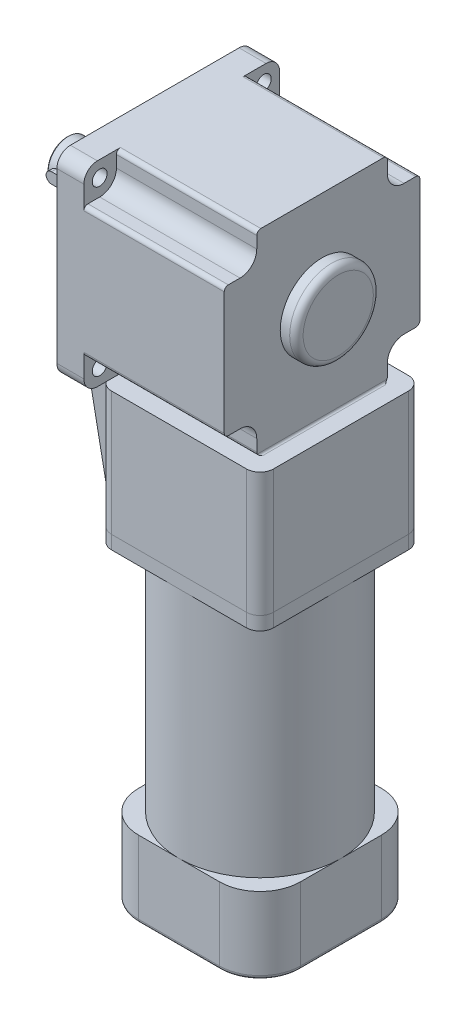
ISO-10303-21;
HEADER;
FILE_DESCRIPTION(('STEP AP214'),'2;1');
FILE_NAME('part.step','',(''),(''),'','','');
FILE_SCHEMA(('AUTOMOTIVE_DESIGN { 1 0 10303 214 1 1 1 1 }'));
ENDSEC;
DATA;
#1=APPLICATION_CONTEXT('core data for automotive mechanical design processes');
#2=APPLICATION_PROTOCOL_DEFINITION('international standard','automotive_design',2000,#1);
#3=PRODUCT_CONTEXT('',#1,'mechanical');
#4=PRODUCT('Part','Part','',(#3));
#5=PRODUCT_RELATED_PRODUCT_CATEGORY('part','',(#4));
#6=PRODUCT_DEFINITION_FORMATION('','',#4);
#7=PRODUCT_DEFINITION_CONTEXT('part definition',#1,'design');
#8=PRODUCT_DEFINITION('design','',#6,#7);
#9=PRODUCT_DEFINITION_SHAPE('','',#8);
#10=(LENGTH_UNIT() NAMED_UNIT(*) SI_UNIT(.MILLI.,.METRE.));
#11=(NAMED_UNIT(*) PLANE_ANGLE_UNIT() SI_UNIT($,.RADIAN.));
#12=(NAMED_UNIT(*) SI_UNIT($,.STERADIAN.) SOLID_ANGLE_UNIT());
#13=UNCERTAINTY_MEASURE_WITH_UNIT(LENGTH_MEASURE(1.E-05),#10,'distance_accuracy_value','');
#14=(GEOMETRIC_REPRESENTATION_CONTEXT(3) GLOBAL_UNCERTAINTY_ASSIGNED_CONTEXT((#13)) GLOBAL_UNIT_ASSIGNED_CONTEXT((#10,
#11,#12)) REPRESENTATION_CONTEXT('',''));
#15=CARTESIAN_POINT('',(0.,0.,0.));
#16=DIRECTION('',(0.,0.,1.));
#17=DIRECTION('',(1.,0.,0.));
#18=AXIS2_PLACEMENT_3D('',#15,#16,#17);
#19=CARTESIAN_POINT('',(78.,-347.5,0.));
#20=DIRECTION('',(0.,1.,0.));
#21=DIRECTION('',(0.,0.,1.));
#22=AXIS2_PLACEMENT_3D('',#19,#20,#21);
#23=CYLINDRICAL_SURFACE('',#22,60.);
#24=CARTESIAN_POINT('',(78.,-347.5,0.));
#25=DIRECTION('',(0.,-1.,0.));
#26=DIRECTION('',(0.,0.,-1.));
#27=AXIS2_PLACEMENT_3D('',#24,#25,#26);
#28=CIRCLE('',#27,60.);
#29=CARTESIAN_POINT('',(78.,-347.5,-60.));
#30=VERTEX_POINT('',#29);
#31=CARTESIAN_POINT('',(138.,-347.5,0.));
#32=VERTEX_POINT('',#31);
#33=EDGE_CURVE('E208',#30,#32,#28,.T.);
#34=ORIENTED_EDGE('',*,*,#33,.F.);
#35=CARTESIAN_POINT('',(18.,-347.5,0.));
#36=VERTEX_POINT('',#35);
#37=EDGE_CURVE('E212',#36,#30,#28,.T.);
#38=ORIENTED_EDGE('',*,*,#37,.F.);
#39=CARTESIAN_POINT('',(78.,-347.5,60.));
#40=VERTEX_POINT('',#39);
#41=EDGE_CURVE('E325',#40,#36,#28,.T.);
#42=ORIENTED_EDGE('',*,*,#41,.F.);
#43=EDGE_CURVE('E163',#32,#40,#28,.T.);
#44=ORIENTED_EDGE('',*,*,#43,.F.);
#45=EDGE_LOOP('',(#34,#38,#42,#44));
#46=FACE_BOUND('',#45,.T.);
#47=CARTESIAN_POINT('',(78.,-174.5,0.));
#48=DIRECTION('',(0.,-1.,0.));
#49=DIRECTION('',(0.,0.,-1.));
#50=AXIS2_PLACEMENT_3D('',#47,#48,#49);
#51=CIRCLE('',#50,60.);
#52=CARTESIAN_POINT('',(78.,-174.5,-60.));
#53=VERTEX_POINT('',#52);
#54=EDGE_CURVE('E154',#53,#53,#51,.T.);
#55=ORIENTED_EDGE('',*,*,#54,.T.);
#56=EDGE_LOOP('',(#55));
#57=FACE_BOUND('',#56,.T.);
#58=ADVANCED_FACE('F46',(#46,#57),#23,.T.);
#59=CARTESIAN_POINT('',(78.,-174.5,0.));
#60=DIRECTION('',(0.,-1.,0.));
#61=DIRECTION('',(0.,0.,-1.));
#62=AXIS2_PLACEMENT_3D('',#59,#60,#61);
#63=PLANE('',#62);
#64=ORIENTED_EDGE('',*,*,#54,.F.);
#65=EDGE_LOOP('',(#64));
#66=FACE_BOUND('',#65,.T.);
#67=ADVANCED_FACE('F343',(#66),#63,.F.);
#68=CARTESIAN_POINT('',(108.,-347.5,30.));
#69=DIRECTION('',(0.,1.,0.));
#70=DIRECTION('',(0.,0.,1.));
#71=AXIS2_PLACEMENT_3D('',#68,#69,#70);
#72=PLANE('',#71);
#73=DIRECTION('',(1.,0.,0.));
#74=VECTOR('',#73,1.);
#75=CARTESIAN_POINT('',(48.0000000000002,-347.5,-60.));
#76=LINE('',#75,#74);
#77=CARTESIAN_POINT('',(108.,-347.5,-60.));
#78=VERTEX_POINT('',#77);
#79=EDGE_CURVE('E185',#30,#78,#76,.T.);
#80=ORIENTED_EDGE('',*,*,#79,.F.);
#81=ORIENTED_EDGE('',*,*,#33,.T.);
#82=DIRECTION('',(0.,0.,1.));
#83=VECTOR('',#82,1.);
#84=CARTESIAN_POINT('',(138.,-347.5,-29.9999999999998));
#85=LINE('',#84,#83);
#86=CARTESIAN_POINT('',(138.,-347.5,-29.9999999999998));
#87=VERTEX_POINT('',#86);
#88=EDGE_CURVE('E193',#87,#32,#85,.T.);
#89=ORIENTED_EDGE('',*,*,#88,.F.);
#90=CARTESIAN_POINT('',(108.,-347.5,-30.));
#91=DIRECTION('',(0.,-1.,0.));
#92=DIRECTION('',(0.,0.,-1.));
#93=AXIS2_PLACEMENT_3D('',#90,#91,#92);
#94=CIRCLE('',#93,30.);
#95=EDGE_CURVE('E189',#78,#87,#94,.T.);
#96=ORIENTED_EDGE('',*,*,#95,.F.);
#97=EDGE_LOOP('',(#80,#81,#89,#96));
#98=FACE_BOUND('',#97,.T.);
#99=ADVANCED_FACE('F327',(#98),#72,.T.);
#100=CARTESIAN_POINT('',(138.,-347.5,29.9999999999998));
#101=VERTEX_POINT('',#100);
#102=EDGE_CURVE('E192',#32,#101,#85,.T.);
#103=ORIENTED_EDGE('',*,*,#102,.F.);
#104=ORIENTED_EDGE('',*,*,#43,.T.);
#105=DIRECTION('',(-1.,0.,0.));
#106=VECTOR('',#105,1.);
#107=CARTESIAN_POINT('',(48.0000000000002,-347.5,60.));
#108=LINE('',#107,#106);
#109=CARTESIAN_POINT('',(108.,-347.5,60.));
#110=VERTEX_POINT('',#109);
#111=EDGE_CURVE('E150',#110,#40,#108,.T.);
#112=ORIENTED_EDGE('',*,*,#111,.F.);
#113=CARTESIAN_POINT('',(108.,-347.5,30.));
#114=DIRECTION('',(0.,-1.,0.));
#115=DIRECTION('',(0.,0.,1.));
#116=AXIS2_PLACEMENT_3D('',#113,#114,#115);
#117=CIRCLE('',#116,30.);
#118=EDGE_CURVE('E162',#101,#110,#117,.T.);
#119=ORIENTED_EDGE('',*,*,#118,.F.);
#120=EDGE_LOOP('',(#103,#104,#112,#119));
#121=FACE_BOUND('',#120,.T.);
#122=ADVANCED_FACE('F161',(#121),#72,.T.);
#123=CARTESIAN_POINT('',(48.0000000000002,-347.5,60.));
#124=VERTEX_POINT('',#123);
#125=EDGE_CURVE('E166',#40,#124,#108,.T.);
#126=ORIENTED_EDGE('',*,*,#125,.F.);
#127=ORIENTED_EDGE('',*,*,#41,.T.);
#128=DIRECTION('',(0.,0.,-1.));
#129=VECTOR('',#128,1.);
#130=CARTESIAN_POINT('',(18.,-347.5,-29.9999999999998));
#131=LINE('',#130,#129);
#132=CARTESIAN_POINT('',(18.,-347.5,29.9999999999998));
#133=VERTEX_POINT('',#132);
#134=EDGE_CURVE('E179',#133,#36,#131,.T.);
#135=ORIENTED_EDGE('',*,*,#134,.F.);
#136=CARTESIAN_POINT('',(48.,-347.5,30.));
#137=DIRECTION('',(0.,-1.,0.));
#138=DIRECTION('',(0.,0.,1.));
#139=AXIS2_PLACEMENT_3D('',#136,#137,#138);
#140=CIRCLE('',#139,30.);
#141=EDGE_CURVE('E165',#124,#133,#140,.T.);
#142=ORIENTED_EDGE('',*,*,#141,.F.);
#143=EDGE_LOOP('',(#126,#127,#135,#142));
#144=FACE_BOUND('',#143,.T.);
#145=ADVANCED_FACE('F331',(#144),#72,.T.);
#146=CARTESIAN_POINT('',(108.,-404.5,30.));
#147=DIRECTION('',(0.,1.,0.));
#148=DIRECTION('',(0.,0.,1.));
#149=AXIS2_PLACEMENT_3D('',#146,#147,#148);
#150=CYLINDRICAL_SURFACE('',#149,30.);
#151=DIRECTION('',(0.,1.,0.));
#152=VECTOR('',#151,1.);
#153=CARTESIAN_POINT('',(108.,-404.5,60.));
#154=LINE('',#153,#152);
#155=CARTESIAN_POINT('',(108.,-401.5,60.));
#156=VERTEX_POINT('',#155);
#157=EDGE_CURVE('E146',#156,#110,#154,.T.);
#158=ORIENTED_EDGE('',*,*,#157,.F.);
#159=CARTESIAN_POINT('',(108.,-401.5,30.));
#160=DIRECTION('',(0.,1.,0.));
#161=DIRECTION('',(0.,0.,1.));
#162=AXIS2_PLACEMENT_3D('',#159,#160,#161);
#163=CIRCLE('',#162,30.);
#164=CARTESIAN_POINT('',(138.,-401.5,29.9999999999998));
#165=VERTEX_POINT('',#164);
#166=EDGE_CURVE('E12',#156,#165,#163,.T.);
#167=ORIENTED_EDGE('',*,*,#166,.T.);
#168=DIRECTION('',(0.,1.,0.));
#169=VECTOR('',#168,1.);
#170=CARTESIAN_POINT('',(138.,-404.5,29.9999999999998));
#171=LINE('',#170,#169);
#172=EDGE_CURVE('E170',#165,#101,#171,.T.);
#173=ORIENTED_EDGE('',*,*,#172,.T.);
#174=ORIENTED_EDGE('',*,*,#118,.T.);
#175=EDGE_LOOP('',(#158,#167,#173,#174));
#176=FACE_BOUND('',#175,.T.);
#177=ADVANCED_FACE('F168',(#176),#150,.T.);
#178=CARTESIAN_POINT('',(48.0000000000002,-404.5,60.));
#179=DIRECTION('',(0.,0.,-1.));
#180=DIRECTION('',(-1.,0.,0.));
#181=AXIS2_PLACEMENT_3D('',#178,#179,#180);
#182=PLANE('',#181);
#183=DIRECTION('',(0.,1.,0.));
#184=VECTOR('',#183,1.);
#185=CARTESIAN_POINT('',(48.0000000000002,-404.5,60.));
#186=LINE('',#185,#184);
#187=CARTESIAN_POINT('',(48.0000000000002,-401.5,60.));
#188=VERTEX_POINT('',#187);
#189=EDGE_CURVE('E155',#188,#124,#186,.T.);
#190=ORIENTED_EDGE('',*,*,#189,.F.);
#191=DIRECTION('',(-1.,0.,0.));
#192=VECTOR('',#191,1.);
#193=CARTESIAN_POINT('',(48.0000000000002,-401.5,60.));
#194=LINE('',#193,#192);
#195=EDGE_CURVE('E55',#188,#156,#194,.F.);
#196=ORIENTED_EDGE('',*,*,#195,.T.);
#197=ORIENTED_EDGE('',*,*,#157,.T.);
#198=ORIENTED_EDGE('',*,*,#111,.T.);
#199=ORIENTED_EDGE('',*,*,#125,.T.);
#200=EDGE_LOOP('',(#190,#196,#197,#198,#199));
#201=FACE_BOUND('',#200,.T.);
#202=ADVANCED_FACE('F148',(#201),#182,.F.);
#203=CARTESIAN_POINT('',(48.,-404.5,30.));
#204=DIRECTION('',(0.,1.,0.));
#205=DIRECTION('',(0.,0.,1.));
#206=AXIS2_PLACEMENT_3D('',#203,#204,#205);
#207=CYLINDRICAL_SURFACE('',#206,30.);
#208=DIRECTION('',(0.,1.,0.));
#209=VECTOR('',#208,1.);
#210=CARTESIAN_POINT('',(18.,-404.5,29.9999999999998));
#211=LINE('',#210,#209);
#212=CARTESIAN_POINT('',(18.,-401.5,29.9999999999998));
#213=VERTEX_POINT('',#212);
#214=EDGE_CURVE('E205',#213,#133,#211,.T.);
#215=ORIENTED_EDGE('',*,*,#214,.F.);
#216=CARTESIAN_POINT('',(48.,-401.5,30.));
#217=DIRECTION('',(0.,1.,0.));
#218=DIRECTION('',(0.,0.,1.));
#219=AXIS2_PLACEMENT_3D('',#216,#217,#218);
#220=CIRCLE('',#219,30.);
#221=EDGE_CURVE('E70',#213,#188,#220,.T.);
#222=ORIENTED_EDGE('',*,*,#221,.T.);
#223=ORIENTED_EDGE('',*,*,#189,.T.);
#224=ORIENTED_EDGE('',*,*,#141,.T.);
#225=EDGE_LOOP('',(#215,#222,#223,#224));
#226=FACE_BOUND('',#225,.T.);
#227=ADVANCED_FACE('F333',(#226),#207,.T.);
#228=CARTESIAN_POINT('',(18.,-404.5,-29.9999999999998));
#229=DIRECTION('',(1.,0.,0.));
#230=DIRECTION('',(0.,0.,-1.));
#231=AXIS2_PLACEMENT_3D('',#228,#229,#230);
#232=PLANE('',#231);
#233=DIRECTION('',(0.,1.,0.));
#234=VECTOR('',#233,1.);
#235=CARTESIAN_POINT('',(18.,-404.5,-29.9999999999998));
#236=LINE('',#235,#234);
#237=CARTESIAN_POINT('',(18.,-401.5,-29.9999999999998));
#238=VERTEX_POINT('',#237);
#239=CARTESIAN_POINT('',(18.,-347.5,-29.9999999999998));
#240=VERTEX_POINT('',#239);
#241=EDGE_CURVE('E203',#238,#240,#236,.T.);
#242=ORIENTED_EDGE('',*,*,#241,.F.);
#243=DIRECTION('',(0.,0.,-1.));
#244=VECTOR('',#243,1.);
#245=CARTESIAN_POINT('',(18.,-401.5,-29.9999999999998));
#246=LINE('',#245,#244);
#247=EDGE_CURVE('E240',#238,#213,#246,.F.);
#248=ORIENTED_EDGE('',*,*,#247,.T.);
#249=ORIENTED_EDGE('',*,*,#214,.T.);
#250=ORIENTED_EDGE('',*,*,#134,.T.);
#251=EDGE_CURVE('E178',#36,#240,#131,.T.);
#252=ORIENTED_EDGE('',*,*,#251,.T.);
#253=EDGE_LOOP('',(#242,#248,#249,#250,#252));
#254=FACE_BOUND('',#253,.T.);
#255=ADVANCED_FACE('F315',(#254),#232,.F.);
#256=CARTESIAN_POINT('',(48.,-404.5,-30.));
#257=DIRECTION('',(0.,1.,0.));
#258=DIRECTION('',(0.,0.,1.));
#259=AXIS2_PLACEMENT_3D('',#256,#257,#258);
#260=CYLINDRICAL_SURFACE('',#259,30.);
#261=DIRECTION('',(0.,1.,0.));
#262=VECTOR('',#261,1.);
#263=CARTESIAN_POINT('',(48.0000000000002,-404.5,-60.));
#264=LINE('',#263,#262);
#265=CARTESIAN_POINT('',(48.0000000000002,-401.5,-60.));
#266=VERTEX_POINT('',#265);
#267=CARTESIAN_POINT('',(48.0000000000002,-347.5,-60.));
#268=VERTEX_POINT('',#267);
#269=EDGE_CURVE('E201',#266,#268,#264,.T.);
#270=ORIENTED_EDGE('',*,*,#269,.F.);
#271=CARTESIAN_POINT('',(48.,-401.5,-30.));
#272=DIRECTION('',(0.,1.,0.));
#273=DIRECTION('',(0.,0.,1.));
#274=AXIS2_PLACEMENT_3D('',#271,#272,#273);
#275=CIRCLE('',#274,30.);
#276=EDGE_CURVE('E238',#266,#238,#275,.T.);
#277=ORIENTED_EDGE('',*,*,#276,.T.);
#278=ORIENTED_EDGE('',*,*,#241,.T.);
#279=CARTESIAN_POINT('',(48.,-347.5,-30.));
#280=DIRECTION('',(0.,-1.,0.));
#281=DIRECTION('',(0.,0.,1.));
#282=AXIS2_PLACEMENT_3D('',#279,#280,#281);
#283=CIRCLE('',#282,30.);
#284=EDGE_CURVE('E182',#240,#268,#283,.T.);
#285=ORIENTED_EDGE('',*,*,#284,.T.);
#286=EDGE_LOOP('',(#270,#277,#278,#285));
#287=FACE_BOUND('',#286,.T.);
#288=ADVANCED_FACE('F312',(#287),#260,.T.);
#289=CARTESIAN_POINT('',(48.0000000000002,-404.5,-60.));
#290=DIRECTION('',(0.,0.,1.));
#291=DIRECTION('',(1.,0.,0.));
#292=AXIS2_PLACEMENT_3D('',#289,#290,#291);
#293=PLANE('',#292);
#294=DIRECTION('',(0.,1.,0.));
#295=VECTOR('',#294,1.);
#296=CARTESIAN_POINT('',(108.,-404.5,-60.));
#297=LINE('',#296,#295);
#298=CARTESIAN_POINT('',(108.,-401.5,-60.));
#299=VERTEX_POINT('',#298);
#300=EDGE_CURVE('E199',#299,#78,#297,.T.);
#301=ORIENTED_EDGE('',*,*,#300,.F.);
#302=DIRECTION('',(1.,0.,0.));
#303=VECTOR('',#302,1.);
#304=CARTESIAN_POINT('',(48.0000000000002,-401.5,-60.));
#305=LINE('',#304,#303);
#306=EDGE_CURVE('E236',#299,#266,#305,.F.);
#307=ORIENTED_EDGE('',*,*,#306,.T.);
#308=ORIENTED_EDGE('',*,*,#269,.T.);
#309=EDGE_CURVE('E186',#268,#30,#76,.T.);
#310=ORIENTED_EDGE('',*,*,#309,.T.);
#311=ORIENTED_EDGE('',*,*,#79,.T.);
#312=EDGE_LOOP('',(#301,#307,#308,#310,#311));
#313=FACE_BOUND('',#312,.T.);
#314=ADVANCED_FACE('F300',(#313),#293,.F.);
#315=CARTESIAN_POINT('',(108.,-404.5,-30.));
#316=DIRECTION('',(0.,1.,0.));
#317=DIRECTION('',(0.,0.,1.));
#318=AXIS2_PLACEMENT_3D('',#315,#316,#317);
#319=CYLINDRICAL_SURFACE('',#318,30.);
#320=DIRECTION('',(0.,1.,0.));
#321=VECTOR('',#320,1.);
#322=CARTESIAN_POINT('',(138.,-404.5,-29.9999999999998));
#323=LINE('',#322,#321);
#324=CARTESIAN_POINT('',(138.,-401.5,-29.9999999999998));
#325=VERTEX_POINT('',#324);
#326=EDGE_CURVE('E197',#325,#87,#323,.T.);
#327=ORIENTED_EDGE('',*,*,#326,.F.);
#328=CARTESIAN_POINT('',(108.,-401.5,-30.));
#329=DIRECTION('',(0.,1.,0.));
#330=DIRECTION('',(0.,0.,1.));
#331=AXIS2_PLACEMENT_3D('',#328,#329,#330);
#332=CIRCLE('',#331,30.);
#333=EDGE_CURVE('E234',#325,#299,#332,.T.);
#334=ORIENTED_EDGE('',*,*,#333,.T.);
#335=ORIENTED_EDGE('',*,*,#300,.T.);
#336=ORIENTED_EDGE('',*,*,#95,.T.);
#337=EDGE_LOOP('',(#327,#334,#335,#336));
#338=FACE_BOUND('',#337,.T.);
#339=ADVANCED_FACE('F296',(#338),#319,.T.);
#340=CARTESIAN_POINT('',(138.,-404.5,-29.9999999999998));
#341=DIRECTION('',(-1.,0.,0.));
#342=DIRECTION('',(0.,0.,1.));
#343=AXIS2_PLACEMENT_3D('',#340,#341,#342);
#344=PLANE('',#343);
#345=ORIENTED_EDGE('',*,*,#172,.F.);
#346=DIRECTION('',(0.,0.,1.));
#347=VECTOR('',#346,1.);
#348=CARTESIAN_POINT('',(138.,-401.5,-29.9999999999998));
#349=LINE('',#348,#347);
#350=EDGE_CURVE('E231',#165,#325,#349,.F.);
#351=ORIENTED_EDGE('',*,*,#350,.T.);
#352=ORIENTED_EDGE('',*,*,#326,.T.);
#353=ORIENTED_EDGE('',*,*,#88,.T.);
#354=ORIENTED_EDGE('',*,*,#102,.T.);
#355=EDGE_LOOP('',(#345,#351,#352,#353,#354));
#356=FACE_BOUND('',#355,.T.);
#357=ADVANCED_FACE('F283',(#356),#344,.F.);
#358=CARTESIAN_POINT('',(108.,-404.5,30.));
#359=DIRECTION('',(0.,1.,0.));
#360=DIRECTION('',(0.,0.,1.));
#361=AXIS2_PLACEMENT_3D('',#358,#359,#360);
#362=PLANE('',#361);
#363=CARTESIAN_POINT('',(108.,-404.5,-30.));
#364=DIRECTION('',(0.,1.,0.));
#365=DIRECTION('',(0.,0.,1.));
#366=AXIS2_PLACEMENT_3D('',#363,#364,#365);
#367=CIRCLE('',#366,27.);
#368=CARTESIAN_POINT('',(108.,-404.5,-57.));
#369=VERTEX_POINT('',#368);
#370=CARTESIAN_POINT('',(135.,-404.5,-29.9999999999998));
#371=VERTEX_POINT('',#370);
#372=EDGE_CURVE('E226',#369,#371,#367,.F.);
#373=ORIENTED_EDGE('',*,*,#372,.T.);
#374=DIRECTION('',(0.,0.,1.));
#375=VECTOR('',#374,1.);
#376=CARTESIAN_POINT('',(135.,-404.5,30.));
#377=LINE('',#376,#375);
#378=CARTESIAN_POINT('',(135.,-404.5,29.9999999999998));
#379=VERTEX_POINT('',#378);
#380=EDGE_CURVE('E228',#371,#379,#377,.T.);
#381=ORIENTED_EDGE('',*,*,#380,.T.);
#382=CARTESIAN_POINT('',(108.,-404.5,30.));
#383=DIRECTION('',(0.,1.,0.));
#384=DIRECTION('',(0.,0.,1.));
#385=AXIS2_PLACEMENT_3D('',#382,#383,#384);
#386=CIRCLE('',#385,27.);
#387=CARTESIAN_POINT('',(108.,-404.5,57.));
#388=VERTEX_POINT('',#387);
#389=EDGE_CURVE('E211',#379,#388,#386,.F.);
#390=ORIENTED_EDGE('',*,*,#389,.T.);
#391=DIRECTION('',(-1.,0.,0.));
#392=VECTOR('',#391,1.);
#393=CARTESIAN_POINT('',(108.,-404.5,57.));
#394=LINE('',#393,#392);
#395=CARTESIAN_POINT('',(48.0000000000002,-404.5,57.));
#396=VERTEX_POINT('',#395);
#397=EDGE_CURVE('E216',#388,#396,#394,.T.);
#398=ORIENTED_EDGE('',*,*,#397,.T.);
#399=CARTESIAN_POINT('',(48.,-404.5,30.));
#400=DIRECTION('',(0.,1.,0.));
#401=DIRECTION('',(0.,0.,1.));
#402=AXIS2_PLACEMENT_3D('',#399,#400,#401);
#403=CIRCLE('',#402,27.);
#404=CARTESIAN_POINT('',(21.,-404.5,29.9999999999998));
#405=VERTEX_POINT('',#404);
#406=EDGE_CURVE('E218',#396,#405,#403,.F.);
#407=ORIENTED_EDGE('',*,*,#406,.T.);
#408=DIRECTION('',(0.,0.,-1.));
#409=VECTOR('',#408,1.);
#410=CARTESIAN_POINT('',(21.,-404.5,30.));
#411=LINE('',#410,#409);
#412=CARTESIAN_POINT('',(21.,-404.5,-29.9999999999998));
#413=VERTEX_POINT('',#412);
#414=EDGE_CURVE('E220',#405,#413,#411,.T.);
#415=ORIENTED_EDGE('',*,*,#414,.T.);
#416=CARTESIAN_POINT('',(48.,-404.5,-30.));
#417=DIRECTION('',(0.,1.,0.));
#418=DIRECTION('',(0.,0.,1.));
#419=AXIS2_PLACEMENT_3D('',#416,#417,#418);
#420=CIRCLE('',#419,27.);
#421=CARTESIAN_POINT('',(48.0000000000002,-404.5,-57.));
#422=VERTEX_POINT('',#421);
#423=EDGE_CURVE('E222',#413,#422,#420,.F.);
#424=ORIENTED_EDGE('',*,*,#423,.T.);
#425=DIRECTION('',(1.,0.,0.));
#426=VECTOR('',#425,1.);
#427=CARTESIAN_POINT('',(108.,-404.5,-57.));
#428=LINE('',#427,#426);
#429=EDGE_CURVE('E224',#422,#369,#428,.T.);
#430=ORIENTED_EDGE('',*,*,#429,.T.);
#431=EDGE_LOOP('',(#373,#381,#390,#398,#407,#415,#424,#430));
#432=FACE_BOUND('',#431,.T.);
#433=ADVANCED_FACE('F271',(#432),#362,.F.);
#434=ORIENTED_EDGE('',*,*,#251,.F.);
#435=ORIENTED_EDGE('',*,*,#37,.T.);
#436=ORIENTED_EDGE('',*,*,#309,.F.);
#437=ORIENTED_EDGE('',*,*,#284,.F.);
#438=EDGE_LOOP('',(#434,#435,#436,#437));
#439=FACE_BOUND('',#438,.T.);
#440=ADVANCED_FACE('F322',(#439),#72,.T.);
#441=CARTESIAN_POINT('',(21.,-401.5,30.));
#442=DIRECTION('',(0.,0.,-1.));
#443=DIRECTION('',(-1.,0.,0.));
#444=AXIS2_PLACEMENT_3D('',#441,#442,#443);
#445=CYLINDRICAL_SURFACE('',#444,3.);
#446=CARTESIAN_POINT('',(21.,-401.5,29.9999999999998));
#447=DIRECTION('',(0.,0.,1.));
#448=DIRECTION('',(1.,0.,0.));
#449=AXIS2_PLACEMENT_3D('',#446,#447,#448);
#450=CIRCLE('',#449,3.);
#451=EDGE_CURVE('E174',#213,#405,#450,.T.);
#452=ORIENTED_EDGE('',*,*,#451,.F.);
#453=ORIENTED_EDGE('',*,*,#247,.F.);
#454=CARTESIAN_POINT('',(21.,-401.5,-29.9999999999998));
#455=DIRECTION('',(0.,0.,-1.));
#456=DIRECTION('',(-1.,0.,0.));
#457=AXIS2_PLACEMENT_3D('',#454,#455,#456);
#458=CIRCLE('',#457,3.);
#459=EDGE_CURVE('E50',#413,#238,#458,.T.);
#460=ORIENTED_EDGE('',*,*,#459,.F.);
#461=ORIENTED_EDGE('',*,*,#414,.F.);
#462=EDGE_LOOP('',(#452,#453,#460,#461));
#463=FACE_BOUND('',#462,.T.);
#464=ADVANCED_FACE('F48',(#463),#445,.T.);
#465=CARTESIAN_POINT('',(48.,-401.5,-30.));
#466=DIRECTION('',(0.,1.,0.));
#467=DIRECTION('',(0.,0.,1.));
#468=AXIS2_PLACEMENT_3D('',#465,#466,#467);
#469=TOROIDAL_SURFACE('',#468,27.,3.);
#470=ORIENTED_EDGE('',*,*,#459,.T.);
#471=ORIENTED_EDGE('',*,*,#276,.F.);
#472=CARTESIAN_POINT('',(48.0000000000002,-401.5,-57.));
#473=DIRECTION('',(1.,0.,0.));
#474=DIRECTION('',(0.,0.,-1.));
#475=AXIS2_PLACEMENT_3D('',#472,#473,#474);
#476=CIRCLE('',#475,3.);
#477=EDGE_CURVE('E257',#422,#266,#476,.T.);
#478=ORIENTED_EDGE('',*,*,#477,.F.);
#479=ORIENTED_EDGE('',*,*,#423,.F.);
#480=EDGE_LOOP('',(#470,#471,#478,#479));
#481=FACE_BOUND('',#480,.T.);
#482=ADVANCED_FACE('F309',(#481),#469,.T.);
#483=CARTESIAN_POINT('',(48.,-401.5,30.));
#484=DIRECTION('',(0.,1.,0.));
#485=DIRECTION('',(0.,0.,1.));
#486=AXIS2_PLACEMENT_3D('',#483,#484,#485);
#487=TOROIDAL_SURFACE('',#486,27.,3.);
#488=ORIENTED_EDGE('',*,*,#451,.T.);
#489=ORIENTED_EDGE('',*,*,#406,.F.);
#490=CARTESIAN_POINT('',(48.0000000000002,-401.5,57.));
#491=DIRECTION('',(1.,0.,0.));
#492=DIRECTION('',(0.,0.,-1.));
#493=AXIS2_PLACEMENT_3D('',#490,#491,#492);
#494=CIRCLE('',#493,3.);
#495=EDGE_CURVE('E254',#188,#396,#494,.T.);
#496=ORIENTED_EDGE('',*,*,#495,.F.);
#497=ORIENTED_EDGE('',*,*,#221,.F.);
#498=EDGE_LOOP('',(#488,#489,#496,#497));
#499=FACE_BOUND('',#498,.T.);
#500=ADVANCED_FACE('F263',(#499),#487,.T.);
#501=CARTESIAN_POINT('',(108.,-401.5,-57.));
#502=DIRECTION('',(1.,0.,0.));
#503=DIRECTION('',(0.,0.,-1.));
#504=AXIS2_PLACEMENT_3D('',#501,#502,#503);
#505=CYLINDRICAL_SURFACE('',#504,3.);
#506=ORIENTED_EDGE('',*,*,#477,.T.);
#507=ORIENTED_EDGE('',*,*,#306,.F.);
#508=CARTESIAN_POINT('',(108.,-401.5,-57.));
#509=DIRECTION('',(1.,0.,0.));
#510=DIRECTION('',(0.,0.,-1.));
#511=AXIS2_PLACEMENT_3D('',#508,#509,#510);
#512=CIRCLE('',#511,3.);
#513=EDGE_CURVE('E251',#369,#299,#512,.T.);
#514=ORIENTED_EDGE('',*,*,#513,.F.);
#515=ORIENTED_EDGE('',*,*,#429,.F.);
#516=EDGE_LOOP('',(#506,#507,#514,#515));
#517=FACE_BOUND('',#516,.T.);
#518=ADVANCED_FACE('F305',(#517),#505,.T.);
#519=CARTESIAN_POINT('',(108.,-401.5,57.));
#520=DIRECTION('',(-1.,0.,0.));
#521=DIRECTION('',(0.,0.,1.));
#522=AXIS2_PLACEMENT_3D('',#519,#520,#521);
#523=CYLINDRICAL_SURFACE('',#522,3.);
#524=ORIENTED_EDGE('',*,*,#495,.T.);
#525=ORIENTED_EDGE('',*,*,#397,.F.);
#526=CARTESIAN_POINT('',(108.,-401.5,57.));
#527=DIRECTION('',(1.,0.,0.));
#528=DIRECTION('',(0.,0.,-1.));
#529=AXIS2_PLACEMENT_3D('',#526,#527,#528);
#530=CIRCLE('',#529,3.);
#531=EDGE_CURVE('E248',#156,#388,#530,.T.);
#532=ORIENTED_EDGE('',*,*,#531,.F.);
#533=ORIENTED_EDGE('',*,*,#195,.F.);
#534=EDGE_LOOP('',(#524,#525,#532,#533));
#535=FACE_BOUND('',#534,.T.);
#536=ADVANCED_FACE('F276',(#535),#523,.T.);
#537=CARTESIAN_POINT('',(108.,-401.5,-30.));
#538=DIRECTION('',(0.,1.,0.));
#539=DIRECTION('',(0.,0.,1.));
#540=AXIS2_PLACEMENT_3D('',#537,#538,#539);
#541=TOROIDAL_SURFACE('',#540,27.,3.);
#542=ORIENTED_EDGE('',*,*,#513,.T.);
#543=ORIENTED_EDGE('',*,*,#333,.F.);
#544=CARTESIAN_POINT('',(135.,-401.5,-29.9999999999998));
#545=DIRECTION('',(0.,0.,1.));
#546=DIRECTION('',(1.,0.,0.));
#547=AXIS2_PLACEMENT_3D('',#544,#545,#546);
#548=CIRCLE('',#547,3.);
#549=EDGE_CURVE('E246',#371,#325,#548,.T.);
#550=ORIENTED_EDGE('',*,*,#549,.F.);
#551=ORIENTED_EDGE('',*,*,#372,.F.);
#552=EDGE_LOOP('',(#542,#543,#550,#551));
#553=FACE_BOUND('',#552,.T.);
#554=ADVANCED_FACE('F292',(#553),#541,.T.);
#555=CARTESIAN_POINT('',(108.,-401.5,30.));
#556=DIRECTION('',(0.,1.,0.));
#557=DIRECTION('',(0.,0.,1.));
#558=AXIS2_PLACEMENT_3D('',#555,#556,#557);
#559=TOROIDAL_SURFACE('',#558,27.,3.);
#560=ORIENTED_EDGE('',*,*,#531,.T.);
#561=ORIENTED_EDGE('',*,*,#389,.F.);
#562=CARTESIAN_POINT('',(135.,-401.5,29.9999999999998));
#563=DIRECTION('',(0.,0.,-1.));
#564=DIRECTION('',(-1.,0.,0.));
#565=AXIS2_PLACEMENT_3D('',#562,#563,#564);
#566=CIRCLE('',#565,3.);
#567=EDGE_CURVE('E244',#165,#379,#566,.T.);
#568=ORIENTED_EDGE('',*,*,#567,.F.);
#569=ORIENTED_EDGE('',*,*,#166,.F.);
#570=EDGE_LOOP('',(#560,#561,#568,#569));
#571=FACE_BOUND('',#570,.T.);
#572=ADVANCED_FACE('F279',(#571),#559,.T.);
#573=CARTESIAN_POINT('',(135.,-401.5,30.));
#574=DIRECTION('',(0.,0.,1.));
#575=DIRECTION('',(1.,0.,0.));
#576=AXIS2_PLACEMENT_3D('',#573,#574,#575);
#577=CYLINDRICAL_SURFACE('',#576,3.);
#578=ORIENTED_EDGE('',*,*,#549,.T.);
#579=ORIENTED_EDGE('',*,*,#350,.F.);
#580=ORIENTED_EDGE('',*,*,#567,.T.);
#581=ORIENTED_EDGE('',*,*,#380,.F.);
#582=EDGE_LOOP('',(#578,#579,#580,#581));
#583=FACE_BOUND('',#582,.T.);
#584=ADVANCED_FACE('F286',(#583),#577,.T.);
#585=CLOSED_SHELL('',(#58,#67,#99,#122,#145,#177,#202,#227,#255,#288,#314,#339,#357,#433,#440,
#464,#482,#500,#518,#536,#554,#572,#584));
#586=MANIFOLD_SOLID_BREP('B2',#585);
#587=CARTESIAN_POINT('',(128.,-174.5,-50.));
#588=DIRECTION('',(0.,1.,0.));
#589=DIRECTION('',(0.,0.,1.));
#590=AXIS2_PLACEMENT_3D('',#587,#588,#589);
#591=CYLINDRICAL_SURFACE('',#590,10.);
#592=CARTESIAN_POINT('',(128.,-164.5,-50.));
#593=DIRECTION('',(0.,-1.,0.));
#594=DIRECTION('',(0.,0.,-1.));
#595=AXIS2_PLACEMENT_3D('',#592,#593,#594);
#596=CIRCLE('',#595,10.);
#597=CARTESIAN_POINT('',(128.,-164.5,-60.));
#598=VERTEX_POINT('',#597);
#599=CARTESIAN_POINT('',(138.,-164.5,-50.));
#600=VERTEX_POINT('',#599);
#601=EDGE_CURVE('E625',#598,#600,#596,.T.);
#602=ORIENTED_EDGE('',*,*,#601,.T.);
#603=DIRECTION('',(0.,1.,0.));
#604=VECTOR('',#603,1.);
#605=CARTESIAN_POINT('',(138.,-174.5,-50.));
#606=LINE('',#605,#604);
#607=CARTESIAN_POINT('',(138.,-174.5,-50.));
#608=VERTEX_POINT('',#607);
#609=EDGE_CURVE('E44',#608,#600,#606,.T.);
#610=ORIENTED_EDGE('',*,*,#609,.F.);
#611=CARTESIAN_POINT('',(128.,-174.5,-50.));
#612=DIRECTION('',(0.,-1.,0.));
#613=DIRECTION('',(0.,0.,-1.));
#614=AXIS2_PLACEMENT_3D('',#611,#612,#613);
#615=CIRCLE('',#614,10.);
#616=CARTESIAN_POINT('',(128.,-174.5,-60.));
#617=VERTEX_POINT('',#616);
#618=EDGE_CURVE('E639',#617,#608,#615,.T.);
#619=ORIENTED_EDGE('',*,*,#618,.F.);
#620=DIRECTION('',(0.,1.,0.));
#621=VECTOR('',#620,1.);
#622=CARTESIAN_POINT('',(128.,-174.5,-60.));
#623=LINE('',#622,#621);
#624=EDGE_CURVE('E621',#617,#598,#623,.T.);
#625=ORIENTED_EDGE('',*,*,#624,.T.);
#626=EDGE_LOOP('',(#602,#610,#619,#625));
#627=FACE_BOUND('',#626,.T.);
#628=ADVANCED_FACE('F529',(#627),#591,.T.);
#629=CARTESIAN_POINT('',(138.,-174.5,-50.));
#630=DIRECTION('',(-1.,0.,0.));
#631=DIRECTION('',(0.,0.,1.));
#632=AXIS2_PLACEMENT_3D('',#629,#630,#631);
#633=PLANE('',#632);
#634=DIRECTION('',(0.,0.,1.));
#635=VECTOR('',#634,1.);
#636=CARTESIAN_POINT('',(138.,-164.5,-50.));
#637=LINE('',#636,#635);
#638=CARTESIAN_POINT('',(138.,-164.5,49.9999999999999));
#639=VERTEX_POINT('',#638);
#640=EDGE_CURVE('E628',#600,#639,#637,.T.);
#641=ORIENTED_EDGE('',*,*,#640,.T.);
#642=DIRECTION('',(0.,1.,0.));
#643=VECTOR('',#642,1.);
#644=CARTESIAN_POINT('',(138.,-174.5,49.9999999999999));
#645=LINE('',#644,#643);
#646=CARTESIAN_POINT('',(138.,-174.5,49.9999999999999));
#647=VERTEX_POINT('',#646);
#648=EDGE_CURVE('E537',#647,#639,#645,.T.);
#649=ORIENTED_EDGE('',*,*,#648,.F.);
#650=DIRECTION('',(0.,0.,1.));
#651=VECTOR('',#650,1.);
#652=CARTESIAN_POINT('',(138.,-174.5,-50.));
#653=LINE('',#652,#651);
#654=EDGE_CURVE('E588',#608,#647,#653,.T.);
#655=ORIENTED_EDGE('',*,*,#654,.F.);
#656=ORIENTED_EDGE('',*,*,#609,.T.);
#657=EDGE_LOOP('',(#641,#649,#655,#656));
#658=FACE_BOUND('',#657,.T.);
#659=ADVANCED_FACE('F674',(#658),#633,.F.);
#660=CARTESIAN_POINT('',(128.,-174.5,50.));
#661=DIRECTION('',(0.,1.,0.));
#662=DIRECTION('',(0.,0.,1.));
#663=AXIS2_PLACEMENT_3D('',#660,#661,#662);
#664=CYLINDRICAL_SURFACE('',#663,10.);
#665=CARTESIAN_POINT('',(128.,-164.5,50.));
#666=DIRECTION('',(0.,-1.,0.));
#667=DIRECTION('',(0.,0.,1.));
#668=AXIS2_PLACEMENT_3D('',#665,#666,#667);
#669=CIRCLE('',#668,10.);
#670=CARTESIAN_POINT('',(128.,-164.5,60.));
#671=VERTEX_POINT('',#670);
#672=EDGE_CURVE('E630',#639,#671,#669,.T.);
#673=ORIENTED_EDGE('',*,*,#672,.T.);
#674=DIRECTION('',(0.,1.,0.));
#675=VECTOR('',#674,1.);
#676=CARTESIAN_POINT('',(128.,-174.5,60.));
#677=LINE('',#676,#675);
#678=CARTESIAN_POINT('',(128.,-174.5,60.));
#679=VERTEX_POINT('',#678);
#680=EDGE_CURVE('E646',#679,#671,#677,.T.);
#681=ORIENTED_EDGE('',*,*,#680,.F.);
#682=CARTESIAN_POINT('',(128.,-174.5,50.));
#683=DIRECTION('',(0.,-1.,0.));
#684=DIRECTION('',(0.,0.,1.));
#685=AXIS2_PLACEMENT_3D('',#682,#683,#684);
#686=CIRCLE('',#685,10.);
#687=EDGE_CURVE('E654',#647,#679,#686,.T.);
#688=ORIENTED_EDGE('',*,*,#687,.F.);
#689=ORIENTED_EDGE('',*,*,#648,.T.);
#690=EDGE_LOOP('',(#673,#681,#688,#689));
#691=FACE_BOUND('',#690,.T.);
#692=ADVANCED_FACE('F652',(#691),#664,.T.);
#693=CARTESIAN_POINT('',(28.0000000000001,-174.5,60.));
#694=DIRECTION('',(0.,0.,-1.));
#695=DIRECTION('',(-1.,0.,0.));
#696=AXIS2_PLACEMENT_3D('',#693,#694,#695);
#697=PLANE('',#696);
#698=DIRECTION('',(-1.,0.,0.));
#699=VECTOR('',#698,1.);
#700=CARTESIAN_POINT('',(28.0000000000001,-164.5,60.));
#701=LINE('',#700,#699);
#702=CARTESIAN_POINT('',(28.0000000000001,-164.5,60.));
#703=VERTEX_POINT('',#702);
#704=EDGE_CURVE('E632',#671,#703,#701,.T.);
#705=ORIENTED_EDGE('',*,*,#704,.T.);
#706=DIRECTION('',(0.,1.,0.));
#707=VECTOR('',#706,1.);
#708=CARTESIAN_POINT('',(28.0000000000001,-174.5,60.));
#709=LINE('',#708,#707);
#710=CARTESIAN_POINT('',(28.0000000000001,-174.5,60.));
#711=VERTEX_POINT('',#710);
#712=EDGE_CURVE('E643',#711,#703,#709,.T.);
#713=ORIENTED_EDGE('',*,*,#712,.F.);
#714=DIRECTION('',(-1.,0.,0.));
#715=VECTOR('',#714,1.);
#716=CARTESIAN_POINT('',(28.0000000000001,-174.5,60.));
#717=LINE('',#716,#715);
#718=EDGE_CURVE('E666',#679,#711,#717,.T.);
#719=ORIENTED_EDGE('',*,*,#718,.F.);
#720=ORIENTED_EDGE('',*,*,#680,.T.);
#721=EDGE_LOOP('',(#705,#713,#719,#720));
#722=FACE_BOUND('',#721,.T.);
#723=ADVANCED_FACE('F662',(#722),#697,.F.);
#724=CARTESIAN_POINT('',(28.,-174.5,50.));
#725=DIRECTION('',(0.,1.,0.));
#726=DIRECTION('',(0.,0.,1.));
#727=AXIS2_PLACEMENT_3D('',#724,#725,#726);
#728=CYLINDRICAL_SURFACE('',#727,10.);
#729=CARTESIAN_POINT('',(28.,-164.5,50.));
#730=DIRECTION('',(0.,-1.,0.));
#731=DIRECTION('',(0.,0.,1.));
#732=AXIS2_PLACEMENT_3D('',#729,#730,#731);
#733=CIRCLE('',#732,10.);
#734=CARTESIAN_POINT('',(18.,-164.5,49.9999999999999));
#735=VERTEX_POINT('',#734);
#736=EDGE_CURVE('E634',#703,#735,#733,.T.);
#737=ORIENTED_EDGE('',*,*,#736,.T.);
#738=DIRECTION('',(0.,1.,0.));
#739=VECTOR('',#738,1.);
#740=CARTESIAN_POINT('',(18.,-174.5,49.9999999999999));
#741=LINE('',#740,#739);
#742=CARTESIAN_POINT('',(18.,-174.5,49.9999999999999));
#743=VERTEX_POINT('',#742);
#744=EDGE_CURVE('E616',#743,#735,#741,.T.);
#745=ORIENTED_EDGE('',*,*,#744,.F.);
#746=CARTESIAN_POINT('',(28.,-174.5,50.));
#747=DIRECTION('',(0.,-1.,0.));
#748=DIRECTION('',(0.,0.,1.));
#749=AXIS2_PLACEMENT_3D('',#746,#747,#748);
#750=CIRCLE('',#749,10.);
#751=EDGE_CURVE('E607',#711,#743,#750,.T.);
#752=ORIENTED_EDGE('',*,*,#751,.F.);
#753=ORIENTED_EDGE('',*,*,#712,.T.);
#754=EDGE_LOOP('',(#737,#745,#752,#753));
#755=FACE_BOUND('',#754,.T.);
#756=ADVANCED_FACE('F665',(#755),#728,.T.);
#757=CARTESIAN_POINT('',(18.,-174.5,-50.));
#758=DIRECTION('',(1.,0.,0.));
#759=DIRECTION('',(0.,0.,-1.));
#760=AXIS2_PLACEMENT_3D('',#757,#758,#759);
#761=PLANE('',#760);
#762=DIRECTION('',(0.,0.,-1.));
#763=VECTOR('',#762,1.);
#764=CARTESIAN_POINT('',(18.,-164.5,-50.));
#765=LINE('',#764,#763);
#766=CARTESIAN_POINT('',(18.,-164.5,-50.));
#767=VERTEX_POINT('',#766);
#768=EDGE_CURVE('E615',#735,#767,#765,.T.);
#769=ORIENTED_EDGE('',*,*,#768,.T.);
#770=DIRECTION('',(0.,1.,0.));
#771=VECTOR('',#770,1.);
#772=CARTESIAN_POINT('',(18.,-174.5,-50.));
#773=LINE('',#772,#771);
#774=CARTESIAN_POINT('',(18.,-174.5,-50.));
#775=VERTEX_POINT('',#774);
#776=EDGE_CURVE('E612',#775,#767,#773,.T.);
#777=ORIENTED_EDGE('',*,*,#776,.F.);
#778=DIRECTION('',(0.,0.,-1.));
#779=VECTOR('',#778,1.);
#780=CARTESIAN_POINT('',(18.,-174.5,-50.));
#781=LINE('',#780,#779);
#782=EDGE_CURVE('E601',#743,#775,#781,.T.);
#783=ORIENTED_EDGE('',*,*,#782,.F.);
#784=ORIENTED_EDGE('',*,*,#744,.T.);
#785=EDGE_LOOP('',(#769,#777,#783,#784));
#786=FACE_BOUND('',#785,.T.);
#787=ADVANCED_FACE('F613',(#786),#761,.F.);
#788=CARTESIAN_POINT('',(28.,-174.5,-50.));
#789=DIRECTION('',(0.,1.,0.));
#790=DIRECTION('',(0.,0.,1.));
#791=AXIS2_PLACEMENT_3D('',#788,#789,#790);
#792=CYLINDRICAL_SURFACE('',#791,10.);
#793=CARTESIAN_POINT('',(28.,-164.5,-50.));
#794=DIRECTION('',(0.,-1.,0.));
#795=DIRECTION('',(0.,0.,1.));
#796=AXIS2_PLACEMENT_3D('',#793,#794,#795);
#797=CIRCLE('',#796,10.);
#798=CARTESIAN_POINT('',(28.0000000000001,-164.5,-60.));
#799=VERTEX_POINT('',#798);
#800=EDGE_CURVE('E574',#767,#799,#797,.T.);
#801=ORIENTED_EDGE('',*,*,#800,.T.);
#802=DIRECTION('',(0.,1.,0.));
#803=VECTOR('',#802,1.);
#804=CARTESIAN_POINT('',(28.0000000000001,-174.5,-60.));
#805=LINE('',#804,#803);
#806=CARTESIAN_POINT('',(28.0000000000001,-174.5,-60.));
#807=VERTEX_POINT('',#806);
#808=EDGE_CURVE('E617',#807,#799,#805,.T.);
#809=ORIENTED_EDGE('',*,*,#808,.F.);
#810=CARTESIAN_POINT('',(28.,-174.5,-50.));
#811=DIRECTION('',(0.,-1.,0.));
#812=DIRECTION('',(0.,0.,1.));
#813=AXIS2_PLACEMENT_3D('',#810,#811,#812);
#814=CIRCLE('',#813,10.);
#815=EDGE_CURVE('E605',#775,#807,#814,.T.);
#816=ORIENTED_EDGE('',*,*,#815,.F.);
#817=ORIENTED_EDGE('',*,*,#776,.T.);
#818=EDGE_LOOP('',(#801,#809,#816,#817));
#819=FACE_BOUND('',#818,.T.);
#820=ADVANCED_FACE('F619',(#819),#792,.T.);
#821=CARTESIAN_POINT('',(28.0000000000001,-174.5,-60.));
#822=DIRECTION('',(0.,0.,1.));
#823=DIRECTION('',(1.,0.,0.));
#824=AXIS2_PLACEMENT_3D('',#821,#822,#823);
#825=PLANE('',#824);
#826=DIRECTION('',(1.,0.,0.));
#827=VECTOR('',#826,1.);
#828=CARTESIAN_POINT('',(28.0000000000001,-164.5,-60.));
#829=LINE('',#828,#827);
#830=EDGE_CURVE('E580',#799,#598,#829,.T.);
#831=ORIENTED_EDGE('',*,*,#830,.T.);
#832=ORIENTED_EDGE('',*,*,#624,.F.);
#833=DIRECTION('',(1.,0.,0.));
#834=VECTOR('',#833,1.);
#835=CARTESIAN_POINT('',(28.0000000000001,-174.5,-60.));
#836=LINE('',#835,#834);
#837=EDGE_CURVE('E545',#807,#617,#836,.T.);
#838=ORIENTED_EDGE('',*,*,#837,.F.);
#839=ORIENTED_EDGE('',*,*,#808,.T.);
#840=EDGE_LOOP('',(#831,#832,#838,#839));
#841=FACE_BOUND('',#840,.T.);
#842=ADVANCED_FACE('F690',(#841),#825,.F.);
#843=CARTESIAN_POINT('',(128.,-174.5,-50.));
#844=DIRECTION('',(0.,-1.,0.));
#845=DIRECTION('',(0.,0.,-1.));
#846=AXIS2_PLACEMENT_3D('',#843,#844,#845);
#847=PLANE('',#846);
#848=ORIENTED_EDGE('',*,*,#618,.T.);
#849=ORIENTED_EDGE('',*,*,#654,.T.);
#850=ORIENTED_EDGE('',*,*,#687,.T.);
#851=ORIENTED_EDGE('',*,*,#718,.T.);
#852=ORIENTED_EDGE('',*,*,#751,.T.);
#853=ORIENTED_EDGE('',*,*,#782,.T.);
#854=ORIENTED_EDGE('',*,*,#815,.T.);
#855=ORIENTED_EDGE('',*,*,#837,.T.);
#856=EDGE_LOOP('',(#848,#849,#850,#851,#852,#853,#854,#855));
#857=FACE_BOUND('',#856,.T.);
#858=ADVANCED_FACE('F603',(#857),#847,.T.);
#859=CARTESIAN_POINT('',(128.,-164.5,-50.));
#860=DIRECTION('',(0.,-1.,0.));
#861=DIRECTION('',(0.,0.,-1.));
#862=AXIS2_PLACEMENT_3D('',#859,#860,#861);
#863=PLANE('',#862);
#864=ORIENTED_EDGE('',*,*,#601,.F.);
#865=ORIENTED_EDGE('',*,*,#830,.F.);
#866=ORIENTED_EDGE('',*,*,#800,.F.);
#867=ORIENTED_EDGE('',*,*,#768,.F.);
#868=ORIENTED_EDGE('',*,*,#736,.F.);
#869=ORIENTED_EDGE('',*,*,#704,.F.);
#870=ORIENTED_EDGE('',*,*,#672,.F.);
#871=ORIENTED_EDGE('',*,*,#640,.F.);
#872=EDGE_LOOP('',(#864,#865,#866,#867,#868,#869,#870,#871));
#873=FACE_BOUND('',#872,.T.);
#874=ADVANCED_FACE('F658',(#873),#863,.F.);
#875=CLOSED_SHELL('',(#628,#659,#692,#723,#756,#787,#820,#842,#858,#874));
#876=MANIFOLD_SOLID_BREP('B6',#875);
#877=CARTESIAN_POINT('',(-58.5,0.,18.));
#878=DIRECTION('',(0.,0.,-1.));
#879=DIRECTION('',(-1.,0.,0.));
#880=AXIS2_PLACEMENT_3D('',#877,#878,#879);
#881=CYLINDRICAL_SURFACE('',#880,4.);
#882=CARTESIAN_POINT('',(-58.5,0.,10.));
#883=DIRECTION('',(0.,0.,1.));
#884=DIRECTION('',(1.,0.,0.));
#885=AXIS2_PLACEMENT_3D('',#882,#883,#884);
#886=CIRCLE('',#885,4.);
#887=CARTESIAN_POINT('',(-58.5,4.,10.));
#888=VERTEX_POINT('',#887);
#889=CARTESIAN_POINT('',(-58.5,-4.,10.));
#890=VERTEX_POINT('',#889);
#891=EDGE_CURVE('E830',#888,#890,#886,.T.);
#892=ORIENTED_EDGE('',*,*,#891,.T.);
#893=DIRECTION('',(0.,0.,-1.));
#894=VECTOR('',#893,1.);
#895=CARTESIAN_POINT('',(-58.5,-4.,18.));
#896=LINE('',#895,#894);
#897=CARTESIAN_POINT('',(-58.5,-4.,18.));
#898=VERTEX_POINT('',#897);
#899=EDGE_CURVE('E527',#898,#890,#896,.T.);
#900=ORIENTED_EDGE('',*,*,#899,.F.);
#901=CARTESIAN_POINT('',(-58.5,0.,18.));
#902=DIRECTION('',(0.,0.,1.));
#903=DIRECTION('',(1.,0.,0.));
#904=AXIS2_PLACEMENT_3D('',#901,#902,#903);
#905=CIRCLE('',#904,4.);
#906=CARTESIAN_POINT('',(-58.5,4.,18.));
#907=VERTEX_POINT('',#906);
#908=EDGE_CURVE('E818',#907,#898,#905,.T.);
#909=ORIENTED_EDGE('',*,*,#908,.F.);
#910=DIRECTION('',(0.,0.,-1.));
#911=VECTOR('',#910,1.);
#912=CARTESIAN_POINT('',(-58.5,4.,18.));
#913=LINE('',#912,#911);
#914=EDGE_CURVE('E826',#907,#888,#913,.T.);
#915=ORIENTED_EDGE('',*,*,#914,.T.);
#916=EDGE_LOOP('',(#892,#900,#909,#915));
#917=FACE_BOUND('',#916,.T.);
#918=ADVANCED_FACE('F767',(#917),#881,.T.);
#919=CARTESIAN_POINT('',(-21.5,-4.,18.));
#920=DIRECTION('',(0.,1.,0.));
#921=DIRECTION('',(-1.,0.,0.));
#922=AXIS2_PLACEMENT_3D('',#919,#920,#921);
#923=PLANE('',#922);
#924=DIRECTION('',(1.,0.,0.));
#925=VECTOR('',#924,1.);
#926=CARTESIAN_POINT('',(-21.5,-4.,10.));
#927=LINE('',#926,#925);
#928=CARTESIAN_POINT('',(-21.5,-4.,10.));
#929=VERTEX_POINT('',#928);
#930=EDGE_CURVE('E822',#890,#929,#927,.T.);
#931=ORIENTED_EDGE('',*,*,#930,.T.);
#932=DIRECTION('',(0.,0.,-1.));
#933=VECTOR('',#932,1.);
#934=CARTESIAN_POINT('',(-21.5,-4.,18.));
#935=LINE('',#934,#933);
#936=CARTESIAN_POINT('',(-21.5,-4.,18.));
#937=VERTEX_POINT('',#936);
#938=EDGE_CURVE('E775',#937,#929,#935,.T.);
#939=ORIENTED_EDGE('',*,*,#938,.F.);
#940=DIRECTION('',(1.,0.,0.));
#941=VECTOR('',#940,1.);
#942=CARTESIAN_POINT('',(-21.5,-4.,18.));
#943=LINE('',#942,#941);
#944=EDGE_CURVE('E813',#898,#937,#943,.T.);
#945=ORIENTED_EDGE('',*,*,#944,.F.);
#946=ORIENTED_EDGE('',*,*,#899,.T.);
#947=EDGE_LOOP('',(#931,#939,#945,#946));
#948=FACE_BOUND('',#947,.T.);
#949=ADVANCED_FACE('F821',(#948),#923,.F.);
#950=CARTESIAN_POINT('',(-21.5,0.,18.));
#951=DIRECTION('',(0.,0.,-1.));
#952=DIRECTION('',(-1.,0.,0.));
#953=AXIS2_PLACEMENT_3D('',#950,#951,#952);
#954=CYLINDRICAL_SURFACE('',#953,4.);
#955=CARTESIAN_POINT('',(-21.5,0.,10.));
#956=DIRECTION('',(0.,0.,1.));
#957=DIRECTION('',(1.,0.,0.));
#958=AXIS2_PLACEMENT_3D('',#955,#956,#957);
#959=CIRCLE('',#958,4.);
#960=CARTESIAN_POINT('',(-21.5,4.,10.));
#961=VERTEX_POINT('',#960);
#962=EDGE_CURVE('E800',#929,#961,#959,.T.);
#963=ORIENTED_EDGE('',*,*,#962,.T.);
#964=DIRECTION('',(0.,0.,-1.));
#965=VECTOR('',#964,1.);
#966=CARTESIAN_POINT('',(-21.5,4.,18.));
#967=LINE('',#966,#965);
#968=CARTESIAN_POINT('',(-21.5,4.,18.));
#969=VERTEX_POINT('',#968);
#970=EDGE_CURVE('E823',#969,#961,#967,.T.);
#971=ORIENTED_EDGE('',*,*,#970,.F.);
#972=CARTESIAN_POINT('',(-21.5,0.,18.));
#973=DIRECTION('',(0.,0.,1.));
#974=DIRECTION('',(1.,0.,0.));
#975=AXIS2_PLACEMENT_3D('',#972,#973,#974);
#976=CIRCLE('',#975,4.);
#977=EDGE_CURVE('E816',#937,#969,#976,.T.);
#978=ORIENTED_EDGE('',*,*,#977,.F.);
#979=ORIENTED_EDGE('',*,*,#938,.T.);
#980=EDGE_LOOP('',(#963,#971,#978,#979));
#981=FACE_BOUND('',#980,.T.);
#982=ADVANCED_FACE('F824',(#981),#954,.T.);
#983=CARTESIAN_POINT('',(-58.5,4.,18.));
#984=DIRECTION('',(0.,-1.,0.));
#985=DIRECTION('',(1.,0.,0.));
#986=AXIS2_PLACEMENT_3D('',#983,#984,#985);
#987=PLANE('',#986);
#988=DIRECTION('',(-1.,0.,0.));
#989=VECTOR('',#988,1.);
#990=CARTESIAN_POINT('',(-58.5,4.,10.));
#991=LINE('',#990,#989);
#992=EDGE_CURVE('E806',#961,#888,#991,.T.);
#993=ORIENTED_EDGE('',*,*,#992,.T.);
#994=ORIENTED_EDGE('',*,*,#914,.F.);
#995=DIRECTION('',(-1.,0.,0.));
#996=VECTOR('',#995,1.);
#997=CARTESIAN_POINT('',(-58.5,4.,18.));
#998=LINE('',#997,#996);
#999=EDGE_CURVE('E783',#969,#907,#998,.T.);
#1000=ORIENTED_EDGE('',*,*,#999,.F.);
#1001=ORIENTED_EDGE('',*,*,#970,.T.);
#1002=EDGE_LOOP('',(#993,#994,#1000,#1001));
#1003=FACE_BOUND('',#1002,.T.);
#1004=ADVANCED_FACE('F837',(#1003),#987,.F.);
#1005=CARTESIAN_POINT('',(-58.5,0.,18.));
#1006=DIRECTION('',(0.,0.,1.));
#1007=DIRECTION('',(1.,0.,0.));
#1008=AXIS2_PLACEMENT_3D('',#1005,#1006,#1007);
#1009=PLANE('',#1008);
#1010=ORIENTED_EDGE('',*,*,#908,.T.);
#1011=ORIENTED_EDGE('',*,*,#944,.T.);
#1012=ORIENTED_EDGE('',*,*,#977,.T.);
#1013=ORIENTED_EDGE('',*,*,#999,.T.);
#1014=EDGE_LOOP('',(#1010,#1011,#1012,#1013));
#1015=FACE_BOUND('',#1014,.T.);
#1016=ADVANCED_FACE('F814',(#1015),#1009,.T.);
#1017=CARTESIAN_POINT('',(-58.5,0.,10.));
#1018=DIRECTION('',(0.,0.,1.));
#1019=DIRECTION('',(1.,0.,0.));
#1020=AXIS2_PLACEMENT_3D('',#1017,#1018,#1019);
#1021=PLANE('',#1020);
#1022=ORIENTED_EDGE('',*,*,#891,.F.);
#1023=ORIENTED_EDGE('',*,*,#992,.F.);
#1024=ORIENTED_EDGE('',*,*,#962,.F.);
#1025=ORIENTED_EDGE('',*,*,#930,.F.);
#1026=EDGE_LOOP('',(#1022,#1023,#1024,#1025));
#1027=FACE_BOUND('',#1026,.T.);
#1028=ADVANCED_FACE('F840',(#1027),#1021,.F.);
#1029=CLOSED_SHELL('',(#918,#949,#982,#1004,#1016,#1028));
#1030=MANIFOLD_SOLID_BREP('B38',#1029);
#1031=CARTESIAN_POINT('',(-15.,0.,0.));
#1032=DIRECTION('',(-1.,0.,0.));
#1033=DIRECTION('',(0.,0.,1.));
#1034=AXIS2_PLACEMENT_3D('',#1031,#1032,#1033);
#1035=PLANE('',#1034);
#1036=CARTESIAN_POINT('',(-15.,0.,0.));
#1037=DIRECTION('',(-1.,0.,0.));
#1038=DIRECTION('',(0.,0.,1.));
#1039=AXIS2_PLACEMENT_3D('',#1036,#1037,#1038);
#1040=CIRCLE('',#1039,16.5);
#1041=CARTESIAN_POINT('',(-15.,0.,16.5));
#1042=VERTEX_POINT('',#1041);
#1043=EDGE_CURVE('E983',#1042,#1042,#1040,.F.);
#1044=ORIENTED_EDGE('',*,*,#1043,.T.);
#1045=EDGE_LOOP('',(#1044));
#1046=FACE_BOUND('',#1045,.T.);
#1047=CARTESIAN_POINT('',(-15.,0.,0.));
#1048=DIRECTION('',(-1.,0.,0.));
#1049=DIRECTION('',(0.,0.,1.));
#1050=AXIS2_PLACEMENT_3D('',#1047,#1048,#1049);
#1051=CIRCLE('',#1050,21.);
#1052=CARTESIAN_POINT('',(-15.,0.,21.));
#1053=VERTEX_POINT('',#1052);
#1054=EDGE_CURVE('E977',#1053,#1053,#1051,.T.);
#1055=ORIENTED_EDGE('',*,*,#1054,.T.);
#1056=EDGE_LOOP('',(#1055));
#1057=FACE_BOUND('',#1056,.T.);
#1058=ADVANCED_FACE('F900',(#1046,#1057),#1035,.T.);
#1059=CARTESIAN_POINT('',(-15.,0.,0.));
#1060=DIRECTION('',(1.,0.,0.));
#1061=DIRECTION('',(0.,0.,-1.));
#1062=AXIS2_PLACEMENT_3D('',#1059,#1060,#1061);
#1063=CYLINDRICAL_SURFACE('',#1062,22.5);
#1064=CARTESIAN_POINT('',(-13.5,0.,0.));
#1065=DIRECTION('',(-1.,0.,0.));
#1066=DIRECTION('',(0.,0.,1.));
#1067=AXIS2_PLACEMENT_3D('',#1064,#1065,#1066);
#1068=CIRCLE('',#1067,22.5);
#1069=CARTESIAN_POINT('',(-13.5,0.,22.5));
#1070=VERTEX_POINT('',#1069);
#1071=EDGE_CURVE('E980',#1070,#1070,#1068,.F.);
#1072=ORIENTED_EDGE('',*,*,#1071,.T.);
#1073=EDGE_LOOP('',(#1072));
#1074=FACE_BOUND('',#1073,.T.);
#1075=CARTESIAN_POINT('',(-3.,0.,0.));
#1076=DIRECTION('',(-1.,0.,0.));
#1077=DIRECTION('',(0.,0.,1.));
#1078=AXIS2_PLACEMENT_3D('',#1075,#1076,#1077);
#1079=CIRCLE('',#1078,22.5);
#1080=CARTESIAN_POINT('',(-3.,0.,22.5));
#1081=VERTEX_POINT('',#1080);
#1082=EDGE_CURVE('E974',#1081,#1081,#1079,.T.);
#1083=ORIENTED_EDGE('',*,*,#1082,.T.);
#1084=EDGE_LOOP('',(#1083));
#1085=FACE_BOUND('',#1084,.T.);
#1086=ADVANCED_FACE('F1024',(#1074,#1085),#1063,.T.);
#1087=CARTESIAN_POINT('',(-3.,0.,0.));
#1088=DIRECTION('',(-1.,0.,0.));
#1089=DIRECTION('',(0.,0.,1.));
#1090=AXIS2_PLACEMENT_3D('',#1087,#1088,#1089);
#1091=PLANE('',#1090);
#1092=ORIENTED_EDGE('',*,*,#1082,.F.);
#1093=EDGE_LOOP('',(#1092));
#1094=FACE_BOUND('',#1093,.T.);
#1095=ADVANCED_FACE('F1029',(#1094),#1091,.F.);
#1096=CARTESIAN_POINT('',(-13.5,0.,0.));
#1097=DIRECTION('',(-1.,0.,0.));
#1098=DIRECTION('',(0.,0.,1.));
#1099=AXIS2_PLACEMENT_3D('',#1096,#1097,#1098);
#1100=TOROIDAL_SURFACE('',#1099,21.,1.5);
#1101=ORIENTED_EDGE('',*,*,#1071,.F.);
#1102=EDGE_LOOP('',(#1101));
#1103=FACE_BOUND('',#1102,.T.);
#1104=ORIENTED_EDGE('',*,*,#1054,.F.);
#1105=EDGE_LOOP('',(#1104));
#1106=FACE_BOUND('',#1105,.T.);
#1107=ADVANCED_FACE('F1035',(#1103,#1106),#1100,.T.);
#1108=CARTESIAN_POINT('',(-16.5,0.,0.));
#1109=DIRECTION('',(-1.,0.,0.));
#1110=DIRECTION('',(0.,0.,1.));
#1111=AXIS2_PLACEMENT_3D('',#1108,#1109,#1110);
#1112=TOROIDAL_SURFACE('',#1111,16.5,1.5);
#1113=ORIENTED_EDGE('',*,*,#1043,.F.);
#1114=EDGE_LOOP('',(#1113));
#1115=FACE_BOUND('',#1114,.T.);
#1116=CARTESIAN_POINT('',(-16.5,0.,0.));
#1117=DIRECTION('',(-1.,0.,0.));
#1118=DIRECTION('',(0.,0.,1.));
#1119=AXIS2_PLACEMENT_3D('',#1116,#1117,#1118);
#1120=CIRCLE('',#1119,15.);
#1121=CARTESIAN_POINT('',(-16.5,0.,15.));
#1122=VERTEX_POINT('',#1121);
#1123=EDGE_CURVE('E968',#1122,#1122,#1120,.T.);
#1124=ORIENTED_EDGE('',*,*,#1123,.F.);
#1125=EDGE_LOOP('',(#1124));
#1126=FACE_BOUND('',#1125,.T.);
#1127=ADVANCED_FACE('F1020',(#1115,#1126),#1112,.F.);
#1128=CARTESIAN_POINT('',(-65.,0.,0.));
#1129=DIRECTION('',(1.,0.,0.));
#1130=DIRECTION('',(0.,0.,-1.));
#1131=AXIS2_PLACEMENT_3D('',#1128,#1129,#1130);
#1132=CYLINDRICAL_SURFACE('',#1131,15.);
#1133=CARTESIAN_POINT('',(-64.,0.,0.));
#1134=DIRECTION('',(-1.,0.,0.));
#1135=DIRECTION('',(0.,0.,1.));
#1136=AXIS2_PLACEMENT_3D('',#1133,#1134,#1135);
#1137=CIRCLE('',#1136,15.);
#1138=CARTESIAN_POINT('',(-64.,0.,15.));
#1139=VERTEX_POINT('',#1138);
#1140=EDGE_CURVE('E765',#1139,#1139,#1137,.F.);
#1141=ORIENTED_EDGE('',*,*,#1140,.T.);
#1142=EDGE_LOOP('',(#1141));
#1143=FACE_BOUND('',#1142,.T.);
#1144=DIRECTION('',(1.,0.,0.));
#1145=VECTOR('',#1144,1.);
#1146=CARTESIAN_POINT('',(-65.,4.,14.456832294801));
#1147=LINE('',#1146,#1145);
#1148=CARTESIAN_POINT('',(-58.5,4.,14.456832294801));
#1149=VERTEX_POINT('',#1148);
#1150=CARTESIAN_POINT('',(-21.5,4.,14.456832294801));
#1151=VERTEX_POINT('',#1150);
#1152=EDGE_CURVE('E923',#1149,#1151,#1147,.T.);
#1153=ORIENTED_EDGE('',*,*,#1152,.T.);
#1154=CARTESIAN_POINT('',(-21.5,4.,14.456832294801));
#1155=CARTESIAN_POINT('',(-21.3896417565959,4.00001309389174,14.4568189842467));
#1156=CARTESIAN_POINT('',(-21.2792914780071,3.99543311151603,14.4580956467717));
#1157=CARTESIAN_POINT('',(-21.0594213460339,3.97718874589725,14.4631301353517));
#1158=CARTESIAN_POINT('',(-20.9499013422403,3.96352604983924,14.4668875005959));
#1159=CARTESIAN_POINT('',(-20.732698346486,3.92725695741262,14.4767740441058));
#1160=CARTESIAN_POINT('',(-20.6250119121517,3.90466984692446,14.482898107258));
#1161=CARTESIAN_POINT('',(-20.4120251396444,3.85076543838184,14.4973231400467));
#1162=CARTESIAN_POINT('',(-20.3067248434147,3.81944798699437,14.5056241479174));
#1163=CARTESIAN_POINT('',(-19.9955365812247,3.71275643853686,14.5334412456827));
#1164=CARTESIAN_POINT('',(-19.7941250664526,3.62460332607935,14.5558829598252));
#1165=CARTESIAN_POINT('',(-19.4089792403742,3.4169578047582,14.6060171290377));
#1166=CARTESIAN_POINT('',(-19.2252507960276,3.29745504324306,14.6337113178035));
#1167=CARTESIAN_POINT('',(-18.8760294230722,3.02730320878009,14.6920016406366));
#1168=CARTESIAN_POINT('',(-18.7110381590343,2.87601544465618,14.7226489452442));
#1169=CARTESIAN_POINT('',(-18.4084424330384,2.54795832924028,14.7829523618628));
#1170=CARTESIAN_POINT('',(-18.2708424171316,2.37118484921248,14.8126083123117));
#1171=CARTESIAN_POINT('',(-18.0248278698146,1.99367199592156,14.8681604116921));
#1172=CARTESIAN_POINT('',(-17.9169160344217,1.79259414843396,14.8939887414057));
#1173=CARTESIAN_POINT('',(-17.7366271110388,1.3743557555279,14.9383834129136));
#1174=CARTESIAN_POINT('',(-17.6642423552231,1.15719869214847,14.9569513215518));
#1175=CARTESIAN_POINT('',(-17.5586901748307,0.718234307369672,14.9843709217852));
#1176=CARTESIAN_POINT('',(-17.5246627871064,0.496647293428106,14.9934353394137));
#1177=CARTESIAN_POINT('',(-17.494085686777,0.0507319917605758,15.0015705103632));
#1178=CARTESIAN_POINT('',(-17.4975305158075,-0.173595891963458,15.0006427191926));
#1179=CARTESIAN_POINT('',(-17.5411956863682,-0.612629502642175,14.9890534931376));
#1180=CARTESIAN_POINT('',(-17.5804861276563,-0.827435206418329,14.9786381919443));
#1181=CARTESIAN_POINT('',(-17.6932251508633,-1.24728467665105,14.9495347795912));
#1182=CARTESIAN_POINT('',(-17.7666753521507,-1.45232797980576,14.9308462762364));
#1183=CARTESIAN_POINT('',(-17.9463599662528,-1.84920963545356,14.8869312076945));
#1184=CARTESIAN_POINT('',(-18.0529133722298,-2.04089626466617,14.8616414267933));
#1185=CARTESIAN_POINT('',(-18.2955427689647,-2.40398441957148,14.8072486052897));
#1186=CARTESIAN_POINT('',(-18.4316239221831,-2.57538239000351,14.7781448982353));
#1187=CARTESIAN_POINT('',(-18.7343279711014,-2.89854935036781,14.7182294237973));
#1188=CARTESIAN_POINT('',(-18.9017580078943,-3.04955722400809,14.6873926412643));
#1189=CARTESIAN_POINT('',(-19.2600428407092,-3.32161448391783,14.6282716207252));
#1190=CARTESIAN_POINT('',(-19.4509040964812,-3.44265558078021,14.5999880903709));
#1191=CARTESIAN_POINT('',(-19.7513532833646,-3.59932937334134,14.5618587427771));
#1192=CARTESIAN_POINT('',(-19.854288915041,-3.64754371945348,14.5498268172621));
#1193=CARTESIAN_POINT('',(-20.0640463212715,-3.73509417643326,14.5275984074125));
#1194=CARTESIAN_POINT('',(-20.1708665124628,-3.77443385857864,14.5174011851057));
#1195=CARTESIAN_POINT('',(-20.3875194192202,-3.843867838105,14.4991713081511));
#1196=CARTESIAN_POINT('',(-20.497348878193,-3.87397173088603,14.4911364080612));
#1197=CARTESIAN_POINT('',(-20.719275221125,-3.92471856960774,14.4774747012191));
#1198=CARTESIAN_POINT('',(-20.83137102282,-3.9453659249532,14.4718467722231));
#1199=CARTESIAN_POINT('',(-21.036251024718,-3.97411378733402,14.4639761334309));
#1200=CARTESIAN_POINT('',(-21.1287964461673,-3.98382319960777,14.4613012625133));
#1201=CARTESIAN_POINT('',(-21.3142253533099,-3.99676420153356,14.4577275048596));
#1202=CARTESIAN_POINT('',(-21.4071080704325,-4.00000603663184,14.4568258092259));
#1203=CARTESIAN_POINT('',(-21.5,-4.,14.456832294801));
#1204=B_SPLINE_CURVE_WITH_KNOTS('',3,(#1154,#1155,#1156,#1157,#1158,#1159,#1160,#1161,#1162,
#1163,#1164,#1165,#1166,#1167,#1168,#1169,#1170,#1171,#1172,#1173,#1174,#1175,#1176,#1177,#1178,
#1179,#1180,#1181,#1182,#1183,#1184,#1185,#1186,#1187,#1188,#1189,#1190,#1191,#1192,#1193,#1194,
#1195,#1196,#1197,#1198,#1199,#1200,#1201,#1202,#1203),.UNSPECIFIED.,.F.,.F.,(4,2,2,2,2,2,2,2,2,
2,2,2,2,2,2,2,2,2,2,2,2,2,2,2,4),(0.,0.330958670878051,0.661855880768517,0.992041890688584,
1.32223370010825,1.98190700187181,2.64179842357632,3.3164963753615,3.99130375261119,
4.67691814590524,5.36238449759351,6.03215661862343,6.7018311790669,7.35461236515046,
8.00742449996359,8.66673340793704,9.32615767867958,10.0057598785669,10.6855498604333,
11.0281077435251,11.3705275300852,11.7125903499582,12.0544935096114,12.3335333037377,
12.6121307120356),.UNSPECIFIED.);
#1205=CARTESIAN_POINT('',(-21.5,-4.,14.456832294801));
#1206=VERTEX_POINT('',#1205);
#1207=EDGE_CURVE('E986',#1151,#1206,#1204,.T.);
#1208=ORIENTED_EDGE('',*,*,#1207,.T.);
#1209=DIRECTION('',(1.,0.,0.));
#1210=VECTOR('',#1209,1.);
#1211=CARTESIAN_POINT('',(-65.,-4.,14.456832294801));
#1212=LINE('',#1211,#1210);
#1213=CARTESIAN_POINT('',(-58.5,-4.,14.456832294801));
#1214=VERTEX_POINT('',#1213);
#1215=EDGE_CURVE('E1103',#1206,#1214,#1212,.F.);
#1216=ORIENTED_EDGE('',*,*,#1215,.T.);
#1217=CARTESIAN_POINT('',(-58.5,-4.,14.456832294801));
#1218=CARTESIAN_POINT('',(-58.6103582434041,-4.00001309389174,14.4568189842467));
#1219=CARTESIAN_POINT('',(-58.7207085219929,-3.99543311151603,14.4580956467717));
#1220=CARTESIAN_POINT('',(-58.9405786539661,-3.97718874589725,14.4631301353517));
#1221=CARTESIAN_POINT('',(-59.0500986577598,-3.96352604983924,14.4668875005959));
#1222=CARTESIAN_POINT('',(-59.267301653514,-3.92725695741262,14.4767740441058));
#1223=CARTESIAN_POINT('',(-59.3749880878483,-3.90466984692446,14.482898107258));
#1224=CARTESIAN_POINT('',(-59.5879748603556,-3.85076543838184,14.4973231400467));
#1225=CARTESIAN_POINT('',(-59.6932751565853,-3.81944798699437,14.5056241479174));
#1226=CARTESIAN_POINT('',(-60.0044634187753,-3.71275643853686,14.5334412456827));
#1227=CARTESIAN_POINT('',(-60.2058749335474,-3.62460332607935,14.5558829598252));
#1228=CARTESIAN_POINT('',(-60.5910207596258,-3.4169578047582,14.6060171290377));
#1229=CARTESIAN_POINT('',(-60.7747492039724,-3.29745504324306,14.6337113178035));
#1230=CARTESIAN_POINT('',(-61.1239705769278,-3.02730320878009,14.6920016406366));
#1231=CARTESIAN_POINT('',(-61.2889618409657,-2.87601544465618,14.7226489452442));
#1232=CARTESIAN_POINT('',(-61.5915575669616,-2.54795832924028,14.7829523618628));
#1233=CARTESIAN_POINT('',(-61.7291575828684,-2.37118484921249,14.8126083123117));
#1234=CARTESIAN_POINT('',(-61.9751721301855,-1.99367199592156,14.8681604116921));
#1235=CARTESIAN_POINT('',(-62.0830839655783,-1.79259414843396,14.8939887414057));
#1236=CARTESIAN_POINT('',(-62.2633728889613,-1.37435575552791,14.9383834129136));
#1237=CARTESIAN_POINT('',(-62.3357576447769,-1.15719869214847,14.9569513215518));
#1238=CARTESIAN_POINT('',(-62.4413098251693,-0.718234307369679,14.9843709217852));
#1239=CARTESIAN_POINT('',(-62.4753372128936,-0.496647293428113,14.9934353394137));
#1240=CARTESIAN_POINT('',(-62.505914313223,-0.0507319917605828,15.0015705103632));
#1241=CARTESIAN_POINT('',(-62.5024694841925,0.173595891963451,15.0006427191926));
#1242=CARTESIAN_POINT('',(-62.4588043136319,0.612629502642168,14.9890534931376));
#1243=CARTESIAN_POINT('',(-62.4195138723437,0.827435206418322,14.9786381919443));
#1244=CARTESIAN_POINT('',(-62.3067748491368,1.24728467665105,14.9495347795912));
#1245=CARTESIAN_POINT('',(-62.2333246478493,1.45232797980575,14.9308462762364));
#1246=CARTESIAN_POINT('',(-62.0536400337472,1.84920963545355,14.8869312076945));
#1247=CARTESIAN_POINT('',(-61.9470866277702,2.04089626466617,14.8616414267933));
#1248=CARTESIAN_POINT('',(-61.7044572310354,2.40398441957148,14.8072486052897));
#1249=CARTESIAN_POINT('',(-61.5683760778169,2.5753823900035,14.7781448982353));
#1250=CARTESIAN_POINT('',(-61.2656720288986,2.8985493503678,14.7182294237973));
#1251=CARTESIAN_POINT('',(-61.0982419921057,3.04955722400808,14.6873926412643));
#1252=CARTESIAN_POINT('',(-60.7399571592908,3.32161448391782,14.6282716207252));
#1253=CARTESIAN_POINT('',(-60.5490959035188,3.4426555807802,14.5999880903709));
#1254=CARTESIAN_POINT('',(-60.2486467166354,3.59932937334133,14.5618587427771));
#1255=CARTESIAN_POINT('',(-60.145711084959,3.64754371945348,14.5498268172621));
#1256=CARTESIAN_POINT('',(-59.9359536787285,3.73509417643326,14.5275984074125));
#1257=CARTESIAN_POINT('',(-59.8291334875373,3.77443385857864,14.5174011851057));
#1258=CARTESIAN_POINT('',(-59.6124805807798,3.843867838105,14.4991713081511));
#1259=CARTESIAN_POINT('',(-59.502651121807,3.87397173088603,14.4911364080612));
#1260=CARTESIAN_POINT('',(-59.2807247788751,3.92471856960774,14.4774747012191));
#1261=CARTESIAN_POINT('',(-59.16862897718,3.9453659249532,14.4718467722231));
#1262=CARTESIAN_POINT('',(-58.963748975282,3.97411378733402,14.4639761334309));
#1263=CARTESIAN_POINT('',(-58.8712035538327,3.98382319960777,14.4613012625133));
#1264=CARTESIAN_POINT('',(-58.6857746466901,3.99676420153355,14.4577275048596));
#1265=CARTESIAN_POINT('',(-58.5928919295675,4.00000603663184,14.4568258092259));
#1266=CARTESIAN_POINT('',(-58.5,4.,14.456832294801));
#1267=B_SPLINE_CURVE_WITH_KNOTS('',3,(#1217,#1218,#1219,#1220,#1221,#1222,#1223,#1224,#1225,
#1226,#1227,#1228,#1229,#1230,#1231,#1232,#1233,#1234,#1235,#1236,#1237,#1238,#1239,#1240,#1241,
#1242,#1243,#1244,#1245,#1246,#1247,#1248,#1249,#1250,#1251,#1252,#1253,#1254,#1255,#1256,#1257,
#1258,#1259,#1260,#1261,#1262,#1263,#1264,#1265,#1266),.UNSPECIFIED.,.F.,.F.,(4,2,2,2,2,2,2,2,2,
2,2,2,2,2,2,2,2,2,2,2,2,2,2,2,4),(0.,0.330958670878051,0.66185588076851,0.992041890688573,
1.32223370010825,1.98190700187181,2.64179842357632,3.3164963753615,3.99130375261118,
4.67691814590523,5.3623844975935,6.03215661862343,6.70183117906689,7.35461236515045,
8.00742449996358,8.66673340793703,9.32615767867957,10.0057598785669,10.6855498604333,
11.0281077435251,11.3705275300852,11.7125903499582,12.0544935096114,12.3335333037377,
12.6121307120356),.UNSPECIFIED.);
#1268=EDGE_CURVE('E915',#1214,#1149,#1267,.T.);
#1269=ORIENTED_EDGE('',*,*,#1268,.T.);
#1270=EDGE_LOOP('',(#1153,#1208,#1216,#1269));
#1271=FACE_BOUND('',#1270,.T.);
#1272=ORIENTED_EDGE('',*,*,#1123,.T.);
#1273=EDGE_LOOP('',(#1272));
#1274=FACE_BOUND('',#1273,.T.);
#1275=ADVANCED_FACE('F999',(#1143,#1271,#1274),#1132,.T.);
#1276=CARTESIAN_POINT('',(-65.,0.,0.));
#1277=DIRECTION('',(-1.,0.,0.));
#1278=DIRECTION('',(0.,0.,1.));
#1279=AXIS2_PLACEMENT_3D('',#1276,#1277,#1278);
#1280=PLANE('',#1279);
#1281=CARTESIAN_POINT('',(-65.,0.,0.));
#1282=DIRECTION('',(-1.,0.,0.));
#1283=DIRECTION('',(0.,0.,1.));
#1284=AXIS2_PLACEMENT_3D('',#1281,#1282,#1283);
#1285=CIRCLE('',#1284,14.);
#1286=CARTESIAN_POINT('',(-65.,0.,14.));
#1287=VERTEX_POINT('',#1286);
#1288=EDGE_CURVE('E908',#1287,#1287,#1285,.T.);
#1289=ORIENTED_EDGE('',*,*,#1288,.T.);
#1290=EDGE_LOOP('',(#1289));
#1291=FACE_BOUND('',#1290,.T.);
#1292=ADVANCED_FACE('F1014',(#1291),#1280,.T.);
#1293=CARTESIAN_POINT('',(-58.5,0.,10.));
#1294=DIRECTION('',(0.,0.,1.));
#1295=DIRECTION('',(1.,0.,0.));
#1296=AXIS2_PLACEMENT_3D('',#1293,#1294,#1295);
#1297=CYLINDRICAL_SURFACE('',#1296,4.);
#1298=DIRECTION('',(0.,0.,1.));
#1299=VECTOR('',#1298,1.);
#1300=CARTESIAN_POINT('',(-58.5,-4.,10.));
#1301=LINE('',#1300,#1299);
#1302=CARTESIAN_POINT('',(-58.5,-4.,10.));
#1303=VERTEX_POINT('',#1302);
#1304=EDGE_CURVE('E940',#1303,#1214,#1301,.T.);
#1305=ORIENTED_EDGE('',*,*,#1304,.F.);
#1306=CARTESIAN_POINT('',(-58.5,0.,10.));
#1307=DIRECTION('',(0.,0.,1.));
#1308=DIRECTION('',(1.,0.,0.));
#1309=AXIS2_PLACEMENT_3D('',#1306,#1307,#1308);
#1310=CIRCLE('',#1309,4.);
#1311=CARTESIAN_POINT('',(-58.5,4.,10.));
#1312=VERTEX_POINT('',#1311);
#1313=EDGE_CURVE('E944',#1312,#1303,#1310,.T.);
#1314=ORIENTED_EDGE('',*,*,#1313,.F.);
#1315=DIRECTION('',(0.,0.,1.));
#1316=VECTOR('',#1315,1.);
#1317=CARTESIAN_POINT('',(-58.5,4.,10.));
#1318=LINE('',#1317,#1316);
#1319=EDGE_CURVE('E966',#1312,#1149,#1318,.T.);
#1320=ORIENTED_EDGE('',*,*,#1319,.T.);
#1321=ORIENTED_EDGE('',*,*,#1268,.F.);
#1322=EDGE_LOOP('',(#1305,#1314,#1320,#1321));
#1323=FACE_BOUND('',#1322,.T.);
#1324=ADVANCED_FACE('F942',(#1323),#1297,.F.);
#1325=CARTESIAN_POINT('',(-58.5,4.,10.));
#1326=DIRECTION('',(0.,1.,0.));
#1327=DIRECTION('',(-1.,0.,0.));
#1328=AXIS2_PLACEMENT_3D('',#1325,#1326,#1327);
#1329=PLANE('',#1328);
#1330=ORIENTED_EDGE('',*,*,#1319,.F.);
#1331=DIRECTION('',(-1.,0.,0.));
#1332=VECTOR('',#1331,1.);
#1333=CARTESIAN_POINT('',(-58.5,4.,10.));
#1334=LINE('',#1333,#1332);
#1335=CARTESIAN_POINT('',(-21.5,4.,10.));
#1336=VERTEX_POINT('',#1335);
#1337=EDGE_CURVE('E949',#1336,#1312,#1334,.T.);
#1338=ORIENTED_EDGE('',*,*,#1337,.F.);
#1339=DIRECTION('',(0.,0.,1.));
#1340=VECTOR('',#1339,1.);
#1341=CARTESIAN_POINT('',(-21.5,4.,10.));
#1342=LINE('',#1341,#1340);
#1343=EDGE_CURVE('E969',#1336,#1151,#1342,.T.);
#1344=ORIENTED_EDGE('',*,*,#1343,.T.);
#1345=ORIENTED_EDGE('',*,*,#1152,.F.);
#1346=EDGE_LOOP('',(#1330,#1338,#1344,#1345));
#1347=FACE_BOUND('',#1346,.T.);
#1348=ADVANCED_FACE('F1008',(#1347),#1329,.F.);
#1349=CARTESIAN_POINT('',(-21.5,0.,10.));
#1350=DIRECTION('',(0.,0.,1.));
#1351=DIRECTION('',(1.,0.,0.));
#1352=AXIS2_PLACEMENT_3D('',#1349,#1350,#1351);
#1353=CYLINDRICAL_SURFACE('',#1352,4.);
#1354=ORIENTED_EDGE('',*,*,#1343,.F.);
#1355=CARTESIAN_POINT('',(-21.5,0.,10.));
#1356=DIRECTION('',(0.,0.,1.));
#1357=DIRECTION('',(1.,0.,0.));
#1358=AXIS2_PLACEMENT_3D('',#1355,#1356,#1357);
#1359=CIRCLE('',#1358,4.);
#1360=CARTESIAN_POINT('',(-21.5,-4.,10.));
#1361=VERTEX_POINT('',#1360);
#1362=EDGE_CURVE('E958',#1361,#1336,#1359,.T.);
#1363=ORIENTED_EDGE('',*,*,#1362,.F.);
#1364=DIRECTION('',(0.,0.,1.));
#1365=VECTOR('',#1364,1.);
#1366=CARTESIAN_POINT('',(-21.5,-4.,10.));
#1367=LINE('',#1366,#1365);
#1368=EDGE_CURVE('E948',#1361,#1206,#1367,.T.);
#1369=ORIENTED_EDGE('',*,*,#1368,.T.);
#1370=ORIENTED_EDGE('',*,*,#1207,.F.);
#1371=EDGE_LOOP('',(#1354,#1363,#1369,#1370));
#1372=FACE_BOUND('',#1371,.T.);
#1373=ADVANCED_FACE('F1003',(#1372),#1353,.F.);
#1374=CARTESIAN_POINT('',(-21.5,-4.,10.));
#1375=DIRECTION('',(0.,-1.,0.));
#1376=DIRECTION('',(1.,0.,0.));
#1377=AXIS2_PLACEMENT_3D('',#1374,#1375,#1376);
#1378=PLANE('',#1377);
#1379=ORIENTED_EDGE('',*,*,#1368,.F.);
#1380=DIRECTION('',(1.,0.,0.));
#1381=VECTOR('',#1380,1.);
#1382=CARTESIAN_POINT('',(-21.5,-4.,10.));
#1383=LINE('',#1382,#1381);
#1384=EDGE_CURVE('E952',#1303,#1361,#1383,.T.);
#1385=ORIENTED_EDGE('',*,*,#1384,.F.);
#1386=ORIENTED_EDGE('',*,*,#1304,.T.);
#1387=ORIENTED_EDGE('',*,*,#1215,.F.);
#1388=EDGE_LOOP('',(#1379,#1385,#1386,#1387));
#1389=FACE_BOUND('',#1388,.T.);
#1390=ADVANCED_FACE('F953',(#1389),#1378,.F.);
#1391=CARTESIAN_POINT('',(-58.5,0.,10.));
#1392=DIRECTION('',(0.,0.,1.));
#1393=DIRECTION('',(1.,0.,0.));
#1394=AXIS2_PLACEMENT_3D('',#1391,#1392,#1393);
#1395=PLANE('',#1394);
#1396=ORIENTED_EDGE('',*,*,#1313,.T.);
#1397=ORIENTED_EDGE('',*,*,#1384,.T.);
#1398=ORIENTED_EDGE('',*,*,#1362,.T.);
#1399=ORIENTED_EDGE('',*,*,#1337,.T.);
#1400=EDGE_LOOP('',(#1396,#1397,#1398,#1399));
#1401=FACE_BOUND('',#1400,.T.);
#1402=ADVANCED_FACE('F960',(#1401),#1395,.T.);
#1403=CARTESIAN_POINT('',(-65.,0.,0.));
#1404=DIRECTION('',(1.,0.,0.));
#1405=DIRECTION('',(0.,0.,-1.));
#1406=AXIS2_PLACEMENT_3D('',#1403,#1404,#1405);
#1407=CONICAL_SURFACE('',#1406,14.,0.78539816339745);
#1408=ORIENTED_EDGE('',*,*,#1140,.F.);
#1409=EDGE_LOOP('',(#1408));
#1410=FACE_BOUND('',#1409,.T.);
#1411=ORIENTED_EDGE('',*,*,#1288,.F.);
#1412=EDGE_LOOP('',(#1411));
#1413=FACE_BOUND('',#1412,.T.);
#1414=ADVANCED_FACE('F902',(#1410,#1413),#1407,.T.);
#1415=CLOSED_SHELL('',(#1058,#1086,#1095,#1107,#1127,#1275,#1292,#1324,#1348,#1373,#1390,#1402,#1414));
#1416=MANIFOLD_SOLID_BREP('B521',#1415);
#1417=CARTESIAN_POINT('',(124.,62.5,-62.5));
#1418=DIRECTION('',(-1.,0.,0.));
#1419=DIRECTION('',(0.,0.,1.));
#1420=AXIS2_PLACEMENT_3D('',#1417,#1418,#1419);
#1421=PLANE('',#1420);
#1422=CARTESIAN_POINT('',(124.,-69.5,45.3958369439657));
#1423=DIRECTION('',(-1.,0.,0.));
#1424=DIRECTION('',(0.,0.,-1.));
#1425=AXIS2_PLACEMENT_3D('',#1422,#1423,#1424);
#1426=CIRCLE('',#1425,3.);
#1427=CARTESIAN_POINT('',(124.,-71.,47.9939131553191));
#1428=VERTEX_POINT('',#1427);
#1429=CARTESIAN_POINT('',(124.,-69.5,48.3958369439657));
#1430=VERTEX_POINT('',#1429);
#1431=EDGE_CURVE('E1758',#1428,#1430,#1426,.T.);
#1432=ORIENTED_EDGE('',*,*,#1431,.F.);
#1433=DIRECTION('',(0.,0.,-1.));
#1434=VECTOR('',#1433,1.);
#1435=CARTESIAN_POINT('',(124.,-71.,-62.5));
#1436=LINE('',#1435,#1434);
#1437=CARTESIAN_POINT('',(124.,-71.,-47.993913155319));
#1438=VERTEX_POINT('',#1437);
#1439=EDGE_CURVE('E1942',#1428,#1438,#1436,.T.);
#1440=ORIENTED_EDGE('',*,*,#1439,.T.);
#1441=CARTESIAN_POINT('',(124.,-69.5,-45.3958369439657));
#1442=DIRECTION('',(-1.,0.,0.));
#1443=DIRECTION('',(0.,0.,-1.));
#1444=AXIS2_PLACEMENT_3D('',#1441,#1442,#1443);
#1445=CIRCLE('',#1444,3.);
#1446=CARTESIAN_POINT('',(124.,-69.5,-48.3958369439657));
#1447=VERTEX_POINT('',#1446);
#1448=EDGE_CURVE('E1708',#1447,#1438,#1445,.T.);
#1449=ORIENTED_EDGE('',*,*,#1448,.F.);
#1450=DIRECTION('',(0.,-1.,0.));
#1451=VECTOR('',#1450,1.);
#1452=CARTESIAN_POINT('',(124.,-69.5,-48.3958369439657));
#1453=LINE('',#1452,#1451);
#1454=CARTESIAN_POINT('',(124.,-60.8,-48.3958369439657));
#1455=VERTEX_POINT('',#1454);
#1456=EDGE_CURVE('E1705',#1455,#1447,#1453,.T.);
#1457=ORIENTED_EDGE('',*,*,#1456,.F.);
#1458=CARTESIAN_POINT('',(124.,-60.8,-60.8));
#1459=DIRECTION('',(1.,0.,0.));
#1460=DIRECTION('',(0.,0.,-1.));
#1461=AXIS2_PLACEMENT_3D('',#1458,#1459,#1460);
#1462=CIRCLE('',#1461,12.4041630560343);
#1463=CARTESIAN_POINT('',(124.,-48.3958369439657,-60.8));
#1464=VERTEX_POINT('',#1463);
#1465=EDGE_CURVE('E1666',#1464,#1455,#1462,.T.);
#1466=ORIENTED_EDGE('',*,*,#1465,.F.);
#1467=DIRECTION('',(0.,0.,1.));
#1468=VECTOR('',#1467,1.);
#1469=CARTESIAN_POINT('',(124.,-48.3958369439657,-60.8));
#1470=LINE('',#1469,#1468);
#1471=CARTESIAN_POINT('',(124.,-48.3958369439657,-69.5));
#1472=VERTEX_POINT('',#1471);
#1473=EDGE_CURVE('E1682',#1472,#1464,#1470,.T.);
#1474=ORIENTED_EDGE('',*,*,#1473,.F.);
#1475=CARTESIAN_POINT('',(124.,-45.3958369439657,-69.5));
#1476=DIRECTION('',(-1.,0.,0.));
#1477=DIRECTION('',(0.,0.,-1.));
#1478=AXIS2_PLACEMENT_3D('',#1475,#1476,#1477);
#1479=CIRCLE('',#1478,3.);
#1480=CARTESIAN_POINT('',(124.,-45.3958369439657,-72.5));
#1481=VERTEX_POINT('',#1480);
#1482=EDGE_CURVE('E1711',#1481,#1472,#1479,.T.);
#1483=ORIENTED_EDGE('',*,*,#1482,.F.);
#1484=DIRECTION('',(0.,1.,0.));
#1485=VECTOR('',#1484,1.);
#1486=CARTESIAN_POINT('',(124.,-62.4999999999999,-72.5));
#1487=LINE('',#1486,#1485);
#1488=CARTESIAN_POINT('',(124.,45.3958369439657,-72.5));
#1489=VERTEX_POINT('',#1488);
#1490=EDGE_CURVE('E1833',#1481,#1489,#1487,.T.);
#1491=ORIENTED_EDGE('',*,*,#1490,.T.);
#1492=CARTESIAN_POINT('',(124.,45.3958369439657,-69.5));
#1493=DIRECTION('',(-1.,0.,0.));
#1494=DIRECTION('',(0.,0.,-1.));
#1495=AXIS2_PLACEMENT_3D('',#1492,#1493,#1494);
#1496=CIRCLE('',#1495,3.);
#1497=CARTESIAN_POINT('',(124.,48.3958369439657,-69.5));
#1498=VERTEX_POINT('',#1497);
#1499=EDGE_CURVE('E1657',#1498,#1489,#1496,.T.);
#1500=ORIENTED_EDGE('',*,*,#1499,.F.);
#1501=DIRECTION('',(0.,0.,-1.));
#1502=VECTOR('',#1501,1.);
#1503=CARTESIAN_POINT('',(124.,48.3958369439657,-69.5));
#1504=LINE('',#1503,#1502);
#1505=CARTESIAN_POINT('',(124.,48.3958369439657,-60.8));
#1506=VERTEX_POINT('',#1505);
#1507=EDGE_CURVE('E1654',#1506,#1498,#1504,.T.);
#1508=ORIENTED_EDGE('',*,*,#1507,.F.);
#1509=CARTESIAN_POINT('',(124.,60.8,-60.8));
#1510=DIRECTION('',(1.,0.,0.));
#1511=DIRECTION('',(0.,0.,-1.));
#1512=AXIS2_PLACEMENT_3D('',#1509,#1510,#1511);
#1513=CIRCLE('',#1512,12.4041630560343);
#1514=CARTESIAN_POINT('',(124.,60.8,-48.3958369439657));
#1515=VERTEX_POINT('',#1514);
#1516=EDGE_CURVE('E1626',#1515,#1506,#1513,.T.);
#1517=ORIENTED_EDGE('',*,*,#1516,.F.);
#1518=DIRECTION('',(0.,-1.,0.));
#1519=VECTOR('',#1518,1.);
#1520=CARTESIAN_POINT('',(124.,60.8,-48.3958369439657));
#1521=LINE('',#1520,#1519);
#1522=CARTESIAN_POINT('',(124.,69.5,-48.3958369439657));
#1523=VERTEX_POINT('',#1522);
#1524=EDGE_CURVE('E1633',#1523,#1515,#1521,.T.);
#1525=ORIENTED_EDGE('',*,*,#1524,.F.);
#1526=CARTESIAN_POINT('',(124.,69.5,-45.3958369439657));
#1527=DIRECTION('',(-1.,0.,0.));
#1528=DIRECTION('',(0.,0.,-1.));
#1529=AXIS2_PLACEMENT_3D('',#1526,#1527,#1528);
#1530=CIRCLE('',#1529,3.);
#1531=CARTESIAN_POINT('',(124.,72.5,-45.3958369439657));
#1532=VERTEX_POINT('',#1531);
#1533=EDGE_CURVE('E1659',#1532,#1523,#1530,.T.);
#1534=ORIENTED_EDGE('',*,*,#1533,.F.);
#1535=DIRECTION('',(0.,0.,1.));
#1536=VECTOR('',#1535,1.);
#1537=CARTESIAN_POINT('',(124.,72.5,62.4999999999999));
#1538=LINE('',#1537,#1536);
#1539=CARTESIAN_POINT('',(124.,72.5,45.3958369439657));
#1540=VERTEX_POINT('',#1539);
#1541=EDGE_CURVE('E1827',#1532,#1540,#1538,.T.);
#1542=ORIENTED_EDGE('',*,*,#1541,.T.);
#1543=CARTESIAN_POINT('',(124.,69.5,45.3958369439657));
#1544=DIRECTION('',(-1.,0.,0.));
#1545=DIRECTION('',(0.,0.,-1.));
#1546=AXIS2_PLACEMENT_3D('',#1543,#1544,#1545);
#1547=CIRCLE('',#1546,3.);
#1548=CARTESIAN_POINT('',(124.,69.5,48.3958369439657));
#1549=VERTEX_POINT('',#1548);
#1550=EDGE_CURVE('E1764',#1549,#1540,#1547,.T.);
#1551=ORIENTED_EDGE('',*,*,#1550,.F.);
#1552=DIRECTION('',(0.,1.,0.));
#1553=VECTOR('',#1552,1.);
#1554=CARTESIAN_POINT('',(124.,69.5,48.3958369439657));
#1555=LINE('',#1554,#1553);
#1556=CARTESIAN_POINT('',(124.,60.8,48.3958369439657));
#1557=VERTEX_POINT('',#1556);
#1558=EDGE_CURVE('E1781',#1557,#1549,#1555,.T.);
#1559=ORIENTED_EDGE('',*,*,#1558,.F.);
#1560=CARTESIAN_POINT('',(124.,60.8,60.8));
#1561=DIRECTION('',(1.,0.,0.));
#1562=DIRECTION('',(0.,0.,-1.));
#1563=AXIS2_PLACEMENT_3D('',#1560,#1561,#1562);
#1564=CIRCLE('',#1563,12.4041630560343);
#1565=CARTESIAN_POINT('',(124.,48.3958369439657,60.8));
#1566=VERTEX_POINT('',#1565);
#1567=EDGE_CURVE('E1809',#1566,#1557,#1564,.T.);
#1568=ORIENTED_EDGE('',*,*,#1567,.F.);
#1569=DIRECTION('',(0.,0.,-1.));
#1570=VECTOR('',#1569,1.);
#1571=CARTESIAN_POINT('',(124.,48.3958369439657,60.8));
#1572=LINE('',#1571,#1570);
#1573=CARTESIAN_POINT('',(124.,48.3958369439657,69.5));
#1574=VERTEX_POINT('',#1573);
#1575=EDGE_CURVE('E1806',#1574,#1566,#1572,.T.);
#1576=ORIENTED_EDGE('',*,*,#1575,.F.);
#1577=CARTESIAN_POINT('',(124.,45.3958369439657,69.5));
#1578=DIRECTION('',(-1.,0.,0.));
#1579=DIRECTION('',(0.,0.,-1.));
#1580=AXIS2_PLACEMENT_3D('',#1577,#1578,#1579);
#1581=CIRCLE('',#1580,3.);
#1582=CARTESIAN_POINT('',(124.,45.3958369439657,72.5));
#1583=VERTEX_POINT('',#1582);
#1584=EDGE_CURVE('E1803',#1583,#1574,#1581,.T.);
#1585=ORIENTED_EDGE('',*,*,#1584,.F.);
#1586=DIRECTION('',(0.,-1.,0.));
#1587=VECTOR('',#1586,1.);
#1588=CARTESIAN_POINT('',(124.,-62.4999999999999,72.5));
#1589=LINE('',#1588,#1587);
#1590=CARTESIAN_POINT('',(124.,-45.3958369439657,72.5));
#1591=VERTEX_POINT('',#1590);
#1592=EDGE_CURVE('E1829',#1583,#1591,#1589,.T.);
#1593=ORIENTED_EDGE('',*,*,#1592,.T.);
#1594=CARTESIAN_POINT('',(124.,-45.3958369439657,69.5));
#1595=DIRECTION('',(-1.,0.,0.));
#1596=DIRECTION('',(0.,0.,-1.));
#1597=AXIS2_PLACEMENT_3D('',#1594,#1595,#1596);
#1598=CIRCLE('',#1597,3.);
#1599=CARTESIAN_POINT('',(124.,-48.3958369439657,69.5));
#1600=VERTEX_POINT('',#1599);
#1601=EDGE_CURVE('E1756',#1600,#1591,#1598,.T.);
#1602=ORIENTED_EDGE('',*,*,#1601,.F.);
#1603=DIRECTION('',(0.,0.,1.));
#1604=VECTOR('',#1603,1.);
#1605=CARTESIAN_POINT('',(124.,-48.3958369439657,69.5));
#1606=LINE('',#1605,#1604);
#1607=CARTESIAN_POINT('',(124.,-48.3958369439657,60.8));
#1608=VERTEX_POINT('',#1607);
#1609=EDGE_CURVE('E1753',#1608,#1600,#1606,.T.);
#1610=ORIENTED_EDGE('',*,*,#1609,.F.);
#1611=CARTESIAN_POINT('',(124.,-60.8,60.8));
#1612=DIRECTION('',(1.,0.,0.));
#1613=DIRECTION('',(0.,0.,-1.));
#1614=AXIS2_PLACEMENT_3D('',#1611,#1612,#1613);
#1615=CIRCLE('',#1614,12.4041630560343);
#1616=CARTESIAN_POINT('',(124.,-60.8,48.3958369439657));
#1617=VERTEX_POINT('',#1616);
#1618=EDGE_CURVE('E1718',#1617,#1608,#1615,.T.);
#1619=ORIENTED_EDGE('',*,*,#1618,.F.);
#1620=DIRECTION('',(0.,1.,0.));
#1621=VECTOR('',#1620,1.);
#1622=CARTESIAN_POINT('',(124.,-60.8,48.3958369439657));
#1623=LINE('',#1622,#1621);
#1624=EDGE_CURVE('E1732',#1430,#1617,#1623,.T.);
#1625=ORIENTED_EDGE('',*,*,#1624,.F.);
#1626=EDGE_LOOP('',(#1432,#1440,#1449,#1457,#1466,#1474,#1483,#1491,#1500,#1508,#1517,#1525,
#1534,#1542,#1551,#1559,#1568,#1576,#1585,#1593,#1602,#1610,#1619,#1625));
#1627=FACE_BOUND('',#1626,.T.);
#1628=CARTESIAN_POINT('',(124.,0.,0.));
#1629=DIRECTION('',(-1.,0.,0.));
#1630=DIRECTION('',(0.,0.,1.));
#1631=AXIS2_PLACEMENT_3D('',#1628,#1629,#1630);
#1632=CIRCLE('',#1631,31.);
#1633=CARTESIAN_POINT('',(124.,0.,31.));
#1634=VERTEX_POINT('',#1633);
#1635=EDGE_CURVE('E2534',#1634,#1634,#1632,.F.);
#1636=ORIENTED_EDGE('',*,*,#1635,.F.);
#1637=EDGE_LOOP('',(#1636));
#1638=FACE_BOUND('',#1637,.T.);
#1639=ADVANCED_FACE('F1139',(#1627,#1638),#1421,.F.);
#1640=CARTESIAN_POINT('',(124.,-72.5,62.4999999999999));
#1641=DIRECTION('',(0.,1.,0.));
#1642=DIRECTION('',(0.,0.,1.));
#1643=AXIS2_PLACEMENT_3D('',#1640,#1641,#1642);
#1644=PLANE('',#1643);
#1645=DIRECTION('',(-1.,0.,0.));
#1646=VECTOR('',#1645,1.);
#1647=CARTESIAN_POINT('',(18.,-72.5,-50.));
#1648=LINE('',#1647,#1646);
#1649=CARTESIAN_POINT('',(18.,-72.5,-50.));
#1650=VERTEX_POINT('',#1649);
#1651=CARTESIAN_POINT('',(0.,-72.5,-50.));
#1652=VERTEX_POINT('',#1651);
#1653=EDGE_CURVE('E2263',#1650,#1652,#1648,.T.);
#1654=ORIENTED_EDGE('',*,*,#1653,.T.);
#1655=DIRECTION('',(0.,0.,-1.));
#1656=VECTOR('',#1655,1.);
#1657=CARTESIAN_POINT('',(0.,-72.5,62.4999999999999));
#1658=LINE('',#1657,#1656);
#1659=CARTESIAN_POINT('',(0.,-72.5,-62.4999999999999));
#1660=VERTEX_POINT('',#1659);
#1661=EDGE_CURVE('E1851',#1652,#1660,#1658,.T.);
#1662=ORIENTED_EDGE('',*,*,#1661,.T.);
#1663=DIRECTION('',(-1.,0.,0.));
#1664=VECTOR('',#1663,1.);
#1665=CARTESIAN_POINT('',(124.,-72.5,-62.4999999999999));
#1666=LINE('',#1665,#1664);
#1667=CARTESIAN_POINT('',(20.,-72.5,-62.4999999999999));
#1668=VERTEX_POINT('',#1667);
#1669=EDGE_CURVE('E1863',#1668,#1660,#1666,.T.);
#1670=ORIENTED_EDGE('',*,*,#1669,.F.);
#1671=DIRECTION('',(0.,0.,-1.));
#1672=VECTOR('',#1671,1.);
#1673=CARTESIAN_POINT('',(20.,-72.5,-62.4999999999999));
#1674=LINE('',#1673,#1672);
#1675=CARTESIAN_POINT('',(20.,-72.5,-56.0000000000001));
#1676=VERTEX_POINT('',#1675);
#1677=EDGE_CURVE('E1688',#1676,#1668,#1674,.T.);
#1678=ORIENTED_EDGE('',*,*,#1677,.F.);
#1679=CARTESIAN_POINT('',(28.,-72.5,-50.));
#1680=DIRECTION('',(0.,-1.,0.));
#1681=DIRECTION('',(0.,0.,1.));
#1682=AXIS2_PLACEMENT_3D('',#1679,#1680,#1681);
#1683=CIRCLE('',#1682,10.);
#1684=EDGE_CURVE('E2227',#1650,#1676,#1683,.T.);
#1685=ORIENTED_EDGE('',*,*,#1684,.F.);
#1686=EDGE_LOOP('',(#1654,#1662,#1670,#1678,#1685));
#1687=FACE_BOUND('',#1686,.T.);
#1688=ADVANCED_FACE('F2055',(#1687),#1644,.F.);
#1689=CARTESIAN_POINT('',(0.,-72.5,35.));
#1690=VERTEX_POINT('',#1689);
#1691=CARTESIAN_POINT('',(0.,-72.5,-35.));
#1692=VERTEX_POINT('',#1691);
#1693=EDGE_CURVE('E1524',#1690,#1692,#1658,.T.);
#1694=ORIENTED_EDGE('',*,*,#1693,.T.);
#1695=DIRECTION('',(-1.,0.,0.));
#1696=VECTOR('',#1695,1.);
#1697=CARTESIAN_POINT('',(18.,-72.5,-35.));
#1698=LINE('',#1697,#1696);
#1699=CARTESIAN_POINT('',(18.,-72.5,-35.));
#1700=VERTEX_POINT('',#1699);
#1701=EDGE_CURVE('E1507',#1700,#1692,#1698,.T.);
#1702=ORIENTED_EDGE('',*,*,#1701,.F.);
#1703=DIRECTION('',(0.,0.,-1.));
#1704=VECTOR('',#1703,1.);
#1705=CARTESIAN_POINT('',(18.,-72.5,-50.));
#1706=LINE('',#1705,#1704);
#1707=CARTESIAN_POINT('',(18.,-72.5,35.));
#1708=VERTEX_POINT('',#1707);
#1709=EDGE_CURVE('E1522',#1708,#1700,#1706,.T.);
#1710=ORIENTED_EDGE('',*,*,#1709,.F.);
#1711=DIRECTION('',(-1.,0.,0.));
#1712=VECTOR('',#1711,1.);
#1713=CARTESIAN_POINT('',(18.,-72.5,35.));
#1714=LINE('',#1713,#1712);
#1715=EDGE_CURVE('E2254',#1708,#1690,#1714,.T.);
#1716=ORIENTED_EDGE('',*,*,#1715,.T.);
#1717=EDGE_LOOP('',(#1694,#1702,#1710,#1716));
#1718=FACE_BOUND('',#1717,.T.);
#1719=ADVANCED_FACE('F1520',(#1718),#1644,.F.);
#1720=CARTESIAN_POINT('',(18.,-164.5,-50.));
#1721=DIRECTION('',(1.,0.,0.));
#1722=DIRECTION('',(0.,0.,-1.));
#1723=AXIS2_PLACEMENT_3D('',#1720,#1721,#1722);
#1724=PLANE('',#1723);
#1725=ORIENTED_EDGE('',*,*,#1709,.T.);
#1726=DIRECTION('',(0.,1.,0.));
#1727=VECTOR('',#1726,1.);
#1728=CARTESIAN_POINT('',(18.,-164.5,-35.));
#1729=LINE('',#1728,#1727);
#1730=CARTESIAN_POINT('',(18.,-164.5,-35.));
#1731=VERTEX_POINT('',#1730);
#1732=EDGE_CURVE('E1504',#1731,#1700,#1729,.T.);
#1733=ORIENTED_EDGE('',*,*,#1732,.F.);
#1734=DIRECTION('',(0.,0.,-1.));
#1735=VECTOR('',#1734,1.);
#1736=CARTESIAN_POINT('',(18.,-164.5,-50.));
#1737=LINE('',#1736,#1735);
#1738=CARTESIAN_POINT('',(18.,-164.5,35.));
#1739=VERTEX_POINT('',#1738);
#1740=EDGE_CURVE('E2232',#1739,#1731,#1737,.T.);
#1741=ORIENTED_EDGE('',*,*,#1740,.F.);
#1742=DIRECTION('',(0.,1.,0.));
#1743=VECTOR('',#1742,1.);
#1744=CARTESIAN_POINT('',(18.,-164.5,35.));
#1745=LINE('',#1744,#1743);
#1746=EDGE_CURVE('E1528',#1739,#1708,#1745,.T.);
#1747=ORIENTED_EDGE('',*,*,#1746,.T.);
#1748=EDGE_LOOP('',(#1725,#1733,#1741,#1747));
#1749=FACE_BOUND('',#1748,.T.);
#1750=ADVANCED_FACE('F1527',(#1749),#1724,.F.);
#1751=CARTESIAN_POINT('',(0.,-72.5,62.4999999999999));
#1752=VERTEX_POINT('',#1751);
#1753=CARTESIAN_POINT('',(0.,-72.5,50.));
#1754=VERTEX_POINT('',#1753);
#1755=EDGE_CURVE('E1852',#1752,#1754,#1658,.T.);
#1756=ORIENTED_EDGE('',*,*,#1755,.T.);
#1757=DIRECTION('',(-1.,0.,0.));
#1758=VECTOR('',#1757,1.);
#1759=CARTESIAN_POINT('',(18.,-72.5,50.));
#1760=LINE('',#1759,#1758);
#1761=CARTESIAN_POINT('',(18.,-72.5,50.));
#1762=VERTEX_POINT('',#1761);
#1763=EDGE_CURVE('E2215',#1762,#1754,#1760,.T.);
#1764=ORIENTED_EDGE('',*,*,#1763,.F.);
#1765=CARTESIAN_POINT('',(28.,-72.5,50.));
#1766=DIRECTION('',(0.,-1.,0.));
#1767=DIRECTION('',(0.,0.,1.));
#1768=AXIS2_PLACEMENT_3D('',#1765,#1766,#1767);
#1769=CIRCLE('',#1768,10.);
#1770=CARTESIAN_POINT('',(20.,-72.5,56.0000000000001));
#1771=VERTEX_POINT('',#1770);
#1772=EDGE_CURVE('E1536',#1771,#1762,#1769,.T.);
#1773=ORIENTED_EDGE('',*,*,#1772,.F.);
#1774=DIRECTION('',(0.,0.,-1.));
#1775=VECTOR('',#1774,1.);
#1776=CARTESIAN_POINT('',(20.,-72.5,45.3958369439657));
#1777=LINE('',#1776,#1775);
#1778=CARTESIAN_POINT('',(20.,-72.5,62.4999999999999));
#1779=VERTEX_POINT('',#1778);
#1780=EDGE_CURVE('E1742',#1779,#1771,#1777,.T.);
#1781=ORIENTED_EDGE('',*,*,#1780,.F.);
#1782=DIRECTION('',(-1.,0.,0.));
#1783=VECTOR('',#1782,1.);
#1784=CARTESIAN_POINT('',(124.,-72.5,62.4999999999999));
#1785=LINE('',#1784,#1783);
#1786=EDGE_CURVE('E1866',#1779,#1752,#1785,.T.);
#1787=ORIENTED_EDGE('',*,*,#1786,.T.);
#1788=EDGE_LOOP('',(#1756,#1764,#1773,#1781,#1787));
#1789=FACE_BOUND('',#1788,.T.);
#1790=ADVANCED_FACE('F2051',(#1789),#1644,.F.);
#1791=CARTESIAN_POINT('',(1.,58.,37.8258236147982));
#1792=DIRECTION('',(1.,0.,0.));
#1793=DIRECTION('',(0.,0.,-1.));
#1794=AXIS2_PLACEMENT_3D('',#1791,#1792,#1793);
#1795=PLANE('',#1794);
#1796=DIRECTION('',(0.,0.,-1.));
#1797=VECTOR('',#1796,1.);
#1798=CARTESIAN_POINT('',(1.,67.,-37.8258236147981));
#1799=LINE('',#1798,#1797);
#1800=CARTESIAN_POINT('',(1.,67.,37.8258236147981));
#1801=VERTEX_POINT('',#1800);
#1802=CARTESIAN_POINT('',(1.,67.,-37.8258236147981));
#1803=VERTEX_POINT('',#1802);
#1804=EDGE_CURVE('E1896',#1801,#1803,#1799,.T.);
#1805=ORIENTED_EDGE('',*,*,#1804,.T.);
#1806=CARTESIAN_POINT('',(1.,58.,-37.8258236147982));
#1807=DIRECTION('',(1.,0.,0.));
#1808=DIRECTION('',(0.,0.,-1.));
#1809=AXIS2_PLACEMENT_3D('',#1806,#1807,#1808);
#1810=CIRCLE('',#1809,9.);
#1811=CARTESIAN_POINT('',(1.,60.8836349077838,-46.3513529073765));
#1812=VERTEX_POINT('',#1811);
#1813=EDGE_CURVE('E1898',#1803,#1812,#1810,.F.);
#1814=ORIENTED_EDGE('',*,*,#1813,.T.);
#1815=DIRECTION('',(0.,-0.947281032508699,-0.320403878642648));
#1816=VECTOR('',#1815,1.);
#1817=CARTESIAN_POINT('',(1.,2.88363490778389,-65.9689999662));
#1818=LINE('',#1817,#1816);
#1819=CARTESIAN_POINT('',(1.,2.88363490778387,-65.9689999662));
#1820=VERTEX_POINT('',#1819);
#1821=EDGE_CURVE('E1876',#1812,#1820,#1818,.T.);
#1822=ORIENTED_EDGE('',*,*,#1821,.T.);
#1823=CARTESIAN_POINT('',(1.,0.,-57.4434706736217));
#1824=DIRECTION('',(1.,0.,0.));
#1825=DIRECTION('',(0.,0.,-1.));
#1826=AXIS2_PLACEMENT_3D('',#1823,#1824,#1825);
#1827=CIRCLE('',#1826,8.99999999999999);
#1828=CARTESIAN_POINT('',(1.,-2.88363490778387,-65.9689999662));
#1829=VERTEX_POINT('',#1828);
#1830=EDGE_CURVE('E1878',#1820,#1829,#1827,.F.);
#1831=ORIENTED_EDGE('',*,*,#1830,.T.);
#1832=DIRECTION('',(0.,-0.947281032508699,0.320403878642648));
#1833=VECTOR('',#1832,1.);
#1834=CARTESIAN_POINT('',(1.,-60.8836349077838,-46.3513529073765));
#1835=LINE('',#1834,#1833);
#1836=CARTESIAN_POINT('',(1.,-60.8836349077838,-46.3513529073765));
#1837=VERTEX_POINT('',#1836);
#1838=EDGE_CURVE('E1880',#1829,#1837,#1835,.T.);
#1839=ORIENTED_EDGE('',*,*,#1838,.T.);
#1840=CARTESIAN_POINT('',(1.,-58.,-37.8258236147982));
#1841=DIRECTION('',(1.,0.,0.));
#1842=DIRECTION('',(0.,0.,-1.));
#1843=AXIS2_PLACEMENT_3D('',#1840,#1841,#1842);
#1844=CIRCLE('',#1843,9.);
#1845=CARTESIAN_POINT('',(1.,-67.,-37.8258236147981));
#1846=VERTEX_POINT('',#1845);
#1847=EDGE_CURVE('E1882',#1837,#1846,#1844,.F.);
#1848=ORIENTED_EDGE('',*,*,#1847,.T.);
#1849=DIRECTION('',(0.,0.,1.));
#1850=VECTOR('',#1849,1.);
#1851=CARTESIAN_POINT('',(1.,-67.,37.8258236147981));
#1852=LINE('',#1851,#1850);
#1853=CARTESIAN_POINT('',(1.,-67.,37.8258236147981));
#1854=VERTEX_POINT('',#1853);
#1855=EDGE_CURVE('E1884',#1846,#1854,#1852,.T.);
#1856=ORIENTED_EDGE('',*,*,#1855,.T.);
#1857=CARTESIAN_POINT('',(1.,-58.,37.8258236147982));
#1858=DIRECTION('',(1.,0.,0.));
#1859=DIRECTION('',(0.,0.,-1.));
#1860=AXIS2_PLACEMENT_3D('',#1857,#1858,#1859);
#1861=CIRCLE('',#1860,9.);
#1862=CARTESIAN_POINT('',(1.,-60.8836349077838,46.3513529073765));
#1863=VERTEX_POINT('',#1862);
#1864=EDGE_CURVE('E1886',#1854,#1863,#1861,.F.);
#1865=ORIENTED_EDGE('',*,*,#1864,.T.);
#1866=DIRECTION('',(0.,0.947281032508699,0.320403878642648));
#1867=VECTOR('',#1866,1.);
#1868=CARTESIAN_POINT('',(1.,-2.88363490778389,65.9689999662));
#1869=LINE('',#1868,#1867);
#1870=CARTESIAN_POINT('',(1.,-2.88363490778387,65.9689999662));
#1871=VERTEX_POINT('',#1870);
#1872=EDGE_CURVE('E1888',#1863,#1871,#1869,.T.);
#1873=ORIENTED_EDGE('',*,*,#1872,.T.);
#1874=CARTESIAN_POINT('',(1.,0.,57.4434706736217));
#1875=DIRECTION('',(1.,0.,0.));
#1876=DIRECTION('',(0.,0.,-1.));
#1877=AXIS2_PLACEMENT_3D('',#1874,#1875,#1876);
#1878=CIRCLE('',#1877,9.);
#1879=CARTESIAN_POINT('',(1.,2.88363490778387,65.9689999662));
#1880=VERTEX_POINT('',#1879);
#1881=EDGE_CURVE('E1890',#1871,#1880,#1878,.F.);
#1882=ORIENTED_EDGE('',*,*,#1881,.T.);
#1883=DIRECTION('',(0.,0.947281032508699,-0.320403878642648));
#1884=VECTOR('',#1883,1.);
#1885=CARTESIAN_POINT('',(1.,60.8836349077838,46.3513529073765));
#1886=LINE('',#1885,#1884);
#1887=CARTESIAN_POINT('',(1.,60.8836349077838,46.3513529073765));
#1888=VERTEX_POINT('',#1887);
#1889=EDGE_CURVE('E1892',#1880,#1888,#1886,.T.);
#1890=ORIENTED_EDGE('',*,*,#1889,.T.);
#1891=CARTESIAN_POINT('',(1.,58.,37.8258236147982));
#1892=DIRECTION('',(1.,0.,0.));
#1893=DIRECTION('',(0.,0.,-1.));
#1894=AXIS2_PLACEMENT_3D('',#1891,#1892,#1893);
#1895=CIRCLE('',#1894,9.);
#1896=EDGE_CURVE('E1894',#1888,#1801,#1895,.F.);
#1897=ORIENTED_EDGE('',*,*,#1896,.T.);
#1898=EDGE_LOOP('',(#1805,#1814,#1822,#1831,#1839,#1848,#1856,#1865,#1873,#1882,#1890,#1897));
#1899=FACE_BOUND('',#1898,.T.);
#1900=CARTESIAN_POINT('',(1.,0.,0.));
#1901=DIRECTION('',(1.,0.,0.));
#1902=DIRECTION('',(0.,0.,-1.));
#1903=AXIS2_PLACEMENT_3D('',#1900,#1901,#1902);
#1904=CIRCLE('',#1903,27.5);
#1905=CARTESIAN_POINT('',(1.,0.,-27.5));
#1906=VERTEX_POINT('',#1905);
#1907=EDGE_CURVE('E1901',#1906,#1906,#1904,.F.);
#1908=ORIENTED_EDGE('',*,*,#1907,.F.);
#1909=EDGE_LOOP('',(#1908));
#1910=FACE_BOUND('',#1909,.T.);
#1911=ADVANCED_FACE('F2031',(#1899,#1910),#1795,.F.);
#1912=CARTESIAN_POINT('',(124.,62.5,-62.5));
#1913=DIRECTION('',(-1.,0.,0.));
#1914=DIRECTION('',(0.,0.,1.));
#1915=AXIS2_PLACEMENT_3D('',#1912,#1913,#1914);
#1916=CYLINDRICAL_SURFACE('',#1915,9.99999999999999);
#1917=CARTESIAN_POINT('',(20.,62.5,-62.5));
#1918=DIRECTION('',(1.,0.,0.));
#1919=DIRECTION('',(0.,0.,-1.));
#1920=AXIS2_PLACEMENT_3D('',#1917,#1918,#1919);
#1921=CIRCLE('',#1920,9.99999999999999);
#1922=CARTESIAN_POINT('',(20.,62.4999999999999,-72.5));
#1923=VERTEX_POINT('',#1922);
#1924=CARTESIAN_POINT('',(20.,72.5,-62.4999999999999));
#1925=VERTEX_POINT('',#1924);
#1926=EDGE_CURVE('E1641',#1923,#1925,#1921,.T.);
#1927=ORIENTED_EDGE('',*,*,#1926,.F.);
#1928=DIRECTION('',(-1.,0.,0.));
#1929=VECTOR('',#1928,1.);
#1930=CARTESIAN_POINT('',(124.,62.4999999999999,-72.5));
#1931=LINE('',#1930,#1929);
#1932=CARTESIAN_POINT('',(0.,62.4999999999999,-72.5));
#1933=VERTEX_POINT('',#1932);
#1934=EDGE_CURVE('E1836',#1923,#1933,#1931,.T.);
#1935=ORIENTED_EDGE('',*,*,#1934,.T.);
#1936=CARTESIAN_POINT('',(0.,62.5,-62.5));
#1937=DIRECTION('',(1.,0.,0.));
#1938=DIRECTION('',(0.,0.,1.));
#1939=AXIS2_PLACEMENT_3D('',#1936,#1937,#1938);
#1940=CIRCLE('',#1939,9.99999999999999);
#1941=CARTESIAN_POINT('',(0.,72.5,-62.4999999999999));
#1942=VERTEX_POINT('',#1941);
#1943=EDGE_CURVE('E1816',#1933,#1942,#1940,.T.);
#1944=ORIENTED_EDGE('',*,*,#1943,.T.);
#1945=DIRECTION('',(-1.,0.,0.));
#1946=VECTOR('',#1945,1.);
#1947=CARTESIAN_POINT('',(124.,72.5,-62.4999999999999));
#1948=LINE('',#1947,#1946);
#1949=EDGE_CURVE('E1874',#1925,#1942,#1948,.T.);
#1950=ORIENTED_EDGE('',*,*,#1949,.F.);
#1951=EDGE_LOOP('',(#1927,#1935,#1944,#1950));
#1952=FACE_BOUND('',#1951,.T.);
#1953=ADVANCED_FACE('F2027',(#1952),#1916,.T.);
#1954=CARTESIAN_POINT('',(124.,-62.4999999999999,-72.5));
#1955=DIRECTION('',(0.,0.,1.));
#1956=DIRECTION('',(1.,0.,0.));
#1957=AXIS2_PLACEMENT_3D('',#1954,#1955,#1956);
#1958=PLANE('',#1957);
#1959=DIRECTION('',(1.,0.,0.));
#1960=VECTOR('',#1959,1.);
#1961=CARTESIAN_POINT('',(20.,45.3958369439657,-72.5));
#1962=LINE('',#1961,#1960);
#1963=CARTESIAN_POINT('',(20.,45.3958369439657,-72.5));
#1964=VERTEX_POINT('',#1963);
#1965=EDGE_CURVE('E1671',#1964,#1489,#1962,.T.);
#1966=ORIENTED_EDGE('',*,*,#1965,.T.);
#1967=ORIENTED_EDGE('',*,*,#1490,.F.);
#1968=DIRECTION('',(1.,0.,0.));
#1969=VECTOR('',#1968,1.);
#1970=CARTESIAN_POINT('',(20.,-45.3958369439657,-72.5));
#1971=LINE('',#1970,#1969);
#1972=CARTESIAN_POINT('',(20.,-45.3958369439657,-72.5));
#1973=VERTEX_POINT('',#1972);
#1974=EDGE_CURVE('E1721',#1973,#1481,#1971,.T.);
#1975=ORIENTED_EDGE('',*,*,#1974,.F.);
#1976=DIRECTION('',(0.,1.,0.));
#1977=VECTOR('',#1976,1.);
#1978=CARTESIAN_POINT('',(20.,-45.3958369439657,-72.5));
#1979=LINE('',#1978,#1977);
#1980=CARTESIAN_POINT('',(20.,-62.4999999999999,-72.5));
#1981=VERTEX_POINT('',#1980);
#1982=EDGE_CURVE('E1694',#1981,#1973,#1979,.T.);
#1983=ORIENTED_EDGE('',*,*,#1982,.F.);
#1984=DIRECTION('',(-1.,0.,0.));
#1985=VECTOR('',#1984,1.);
#1986=CARTESIAN_POINT('',(124.,-62.4999999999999,-72.5));
#1987=LINE('',#1986,#1985);
#1988=CARTESIAN_POINT('',(0.,-62.4999999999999,-72.5));
#1989=VERTEX_POINT('',#1988);
#1990=EDGE_CURVE('E1861',#1981,#1989,#1987,.T.);
#1991=ORIENTED_EDGE('',*,*,#1990,.T.);
#1992=DIRECTION('',(0.,1.,0.));
#1993=VECTOR('',#1992,1.);
#1994=CARTESIAN_POINT('',(0.,-62.4999999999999,-72.5));
#1995=LINE('',#1994,#1993);
#1996=EDGE_CURVE('E1830',#1989,#1933,#1995,.T.);
#1997=ORIENTED_EDGE('',*,*,#1996,.T.);
#1998=ORIENTED_EDGE('',*,*,#1934,.F.);
#1999=DIRECTION('',(0.,1.,0.));
#2000=VECTOR('',#1999,1.);
#2001=CARTESIAN_POINT('',(20.,62.4999999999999,-72.5));
#2002=LINE('',#2001,#2000);
#2003=EDGE_CURVE('E1639',#1964,#1923,#2002,.T.);
#2004=ORIENTED_EDGE('',*,*,#2003,.F.);
#2005=EDGE_LOOP('',(#1966,#1967,#1975,#1983,#1991,#1997,#1998,#2004));
#2006=FACE_BOUND('',#2005,.T.);
#2007=ADVANCED_FACE('F2030',(#2006),#1958,.F.);
#2008=CARTESIAN_POINT('',(124.,-62.5,-62.5));
#2009=DIRECTION('',(-1.,0.,0.));
#2010=DIRECTION('',(0.,0.,1.));
#2011=AXIS2_PLACEMENT_3D('',#2008,#2009,#2010);
#2012=CYLINDRICAL_SURFACE('',#2011,9.99999999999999);
#2013=CARTESIAN_POINT('',(20.,-62.5,-62.5));
#2014=DIRECTION('',(1.,0.,0.));
#2015=DIRECTION('',(0.,0.,-1.));
#2016=AXIS2_PLACEMENT_3D('',#2013,#2014,#2015);
#2017=CIRCLE('',#2016,9.99999999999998);
#2018=EDGE_CURVE('E1692',#1668,#1981,#2017,.T.);
#2019=ORIENTED_EDGE('',*,*,#2018,.F.);
#2020=ORIENTED_EDGE('',*,*,#1669,.T.);
#2021=CARTESIAN_POINT('',(0.,-62.5,-62.5));
#2022=DIRECTION('',(1.,0.,0.));
#2023=DIRECTION('',(0.,0.,-1.));
#2024=AXIS2_PLACEMENT_3D('',#2021,#2022,#2023);
#2025=CIRCLE('',#2024,9.99999999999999);
#2026=EDGE_CURVE('E1855',#1660,#1989,#2025,.T.);
#2027=ORIENTED_EDGE('',*,*,#2026,.T.);
#2028=ORIENTED_EDGE('',*,*,#1990,.F.);
#2029=EDGE_LOOP('',(#2019,#2020,#2027,#2028));
#2030=FACE_BOUND('',#2029,.T.);
#2031=ADVANCED_FACE('F2046',(#2030),#2012,.T.);
#2032=CARTESIAN_POINT('',(124.,-62.4999999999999,72.5));
#2033=DIRECTION('',(0.,0.,-1.));
#2034=DIRECTION('',(-1.,0.,0.));
#2035=AXIS2_PLACEMENT_3D('',#2032,#2033,#2034);
#2036=PLANE('',#2035);
#2037=DIRECTION('',(1.,0.,0.));
#2038=VECTOR('',#2037,1.);
#2039=CARTESIAN_POINT('',(20.,-45.3958369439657,72.5));
#2040=LINE('',#2039,#2038);
#2041=CARTESIAN_POINT('',(20.,-45.3958369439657,72.5));
#2042=VERTEX_POINT('',#2041);
#2043=EDGE_CURVE('E1770',#2042,#1591,#2040,.T.);
#2044=ORIENTED_EDGE('',*,*,#2043,.T.);
#2045=ORIENTED_EDGE('',*,*,#1592,.F.);
#2046=DIRECTION('',(1.,0.,0.));
#2047=VECTOR('',#2046,1.);
#2048=CARTESIAN_POINT('',(20.,45.3958369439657,72.5));
#2049=LINE('',#2048,#2047);
#2050=CARTESIAN_POINT('',(20.,45.3958369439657,72.5));
#2051=VERTEX_POINT('',#2050);
#2052=EDGE_CURVE('E1823',#2051,#1583,#2049,.T.);
#2053=ORIENTED_EDGE('',*,*,#2052,.F.);
#2054=DIRECTION('',(0.,-1.,0.));
#2055=VECTOR('',#2054,1.);
#2056=CARTESIAN_POINT('',(20.,45.3958369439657,72.5));
#2057=LINE('',#2056,#2055);
#2058=CARTESIAN_POINT('',(20.,62.4999999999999,72.5));
#2059=VERTEX_POINT('',#2058);
#2060=EDGE_CURVE('E1785',#2059,#2051,#2057,.T.);
#2061=ORIENTED_EDGE('',*,*,#2060,.F.);
#2062=DIRECTION('',(-1.,0.,0.));
#2063=VECTOR('',#2062,1.);
#2064=CARTESIAN_POINT('',(124.,62.4999999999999,72.5));
#2065=LINE('',#2064,#2063);
#2066=CARTESIAN_POINT('',(0.,62.4999999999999,72.5));
#2067=VERTEX_POINT('',#2066);
#2068=EDGE_CURVE('E1870',#2059,#2067,#2065,.T.);
#2069=ORIENTED_EDGE('',*,*,#2068,.T.);
#2070=DIRECTION('',(0.,-1.,0.));
#2071=VECTOR('',#2070,1.);
#2072=CARTESIAN_POINT('',(0.,-62.4999999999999,72.5));
#2073=LINE('',#2072,#2071);
#2074=CARTESIAN_POINT('',(0.,-62.4999999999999,72.5));
#2075=VERTEX_POINT('',#2074);
#2076=EDGE_CURVE('E1845',#2067,#2075,#2073,.T.);
#2077=ORIENTED_EDGE('',*,*,#2076,.T.);
#2078=DIRECTION('',(-1.,0.,0.));
#2079=VECTOR('',#2078,1.);
#2080=CARTESIAN_POINT('',(124.,-62.4999999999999,72.5));
#2081=LINE('',#2080,#2079);
#2082=CARTESIAN_POINT('',(20.,-62.5,72.5));
#2083=VERTEX_POINT('',#2082);
#2084=EDGE_CURVE('E1868',#2083,#2075,#2081,.T.);
#2085=ORIENTED_EDGE('',*,*,#2084,.F.);
#2086=DIRECTION('',(0.,-1.,0.));
#2087=VECTOR('',#2086,1.);
#2088=CARTESIAN_POINT('',(20.,-62.5,72.5));
#2089=LINE('',#2088,#2087);
#2090=EDGE_CURVE('E1738',#2042,#2083,#2089,.T.);
#2091=ORIENTED_EDGE('',*,*,#2090,.F.);
#2092=EDGE_LOOP('',(#2044,#2045,#2053,#2061,#2069,#2077,#2085,#2091));
#2093=FACE_BOUND('',#2092,.T.);
#2094=ADVANCED_FACE('F2043',(#2093),#2036,.F.);
#2095=CARTESIAN_POINT('',(124.,-62.5,62.5));
#2096=DIRECTION('',(-1.,0.,0.));
#2097=DIRECTION('',(0.,0.,1.));
#2098=AXIS2_PLACEMENT_3D('',#2095,#2096,#2097);
#2099=CYLINDRICAL_SURFACE('',#2098,9.99999999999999);
#2100=CARTESIAN_POINT('',(20.,-62.5,62.5));
#2101=DIRECTION('',(1.,0.,0.));
#2102=DIRECTION('',(0.,0.,-1.));
#2103=AXIS2_PLACEMENT_3D('',#2100,#2101,#2102);
#2104=CIRCLE('',#2103,9.99999999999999);
#2105=EDGE_CURVE('E1740',#2083,#1779,#2104,.T.);
#2106=ORIENTED_EDGE('',*,*,#2105,.F.);
#2107=ORIENTED_EDGE('',*,*,#2084,.T.);
#2108=CARTESIAN_POINT('',(0.,-62.5,62.5));
#2109=DIRECTION('',(1.,0.,0.));
#2110=DIRECTION('',(0.,0.,1.));
#2111=AXIS2_PLACEMENT_3D('',#2108,#2109,#2110);
#2112=CIRCLE('',#2111,9.99999999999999);
#2113=EDGE_CURVE('E1848',#2075,#1752,#2112,.T.);
#2114=ORIENTED_EDGE('',*,*,#2113,.T.);
#2115=ORIENTED_EDGE('',*,*,#1786,.F.);
#2116=EDGE_LOOP('',(#2106,#2107,#2114,#2115));
#2117=FACE_BOUND('',#2116,.T.);
#2118=ADVANCED_FACE('F2037',(#2117),#2099,.T.);
#2119=CARTESIAN_POINT('',(124.,72.5,62.4999999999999));
#2120=DIRECTION('',(0.,-1.,0.));
#2121=DIRECTION('',(0.,0.,-1.));
#2122=AXIS2_PLACEMENT_3D('',#2119,#2120,#2121);
#2123=PLANE('',#2122);
#2124=ORIENTED_EDGE('',*,*,#1541,.F.);
#2125=DIRECTION('',(1.,0.,0.));
#2126=VECTOR('',#2125,1.);
#2127=CARTESIAN_POINT('',(20.,72.5,-45.3958369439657));
#2128=LINE('',#2127,#2126);
#2129=CARTESIAN_POINT('',(20.,72.5,-45.3958369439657));
#2130=VERTEX_POINT('',#2129);
#2131=EDGE_CURVE('E1669',#2130,#1532,#2128,.T.);
#2132=ORIENTED_EDGE('',*,*,#2131,.F.);
#2133=DIRECTION('',(0.,0.,1.));
#2134=VECTOR('',#2133,1.);
#2135=CARTESIAN_POINT('',(20.,72.5,-45.3958369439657));
#2136=LINE('',#2135,#2134);
#2137=EDGE_CURVE('E1643',#1925,#2130,#2136,.T.);
#2138=ORIENTED_EDGE('',*,*,#2137,.F.);
#2139=ORIENTED_EDGE('',*,*,#1949,.T.);
#2140=DIRECTION('',(0.,0.,1.));
#2141=VECTOR('',#2140,1.);
#2142=CARTESIAN_POINT('',(0.,72.5,62.4999999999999));
#2143=LINE('',#2142,#2141);
#2144=CARTESIAN_POINT('',(0.,72.5,62.4999999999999));
#2145=VERTEX_POINT('',#2144);
#2146=EDGE_CURVE('E1839',#1942,#2145,#2143,.T.);
#2147=ORIENTED_EDGE('',*,*,#2146,.T.);
#2148=DIRECTION('',(-1.,0.,0.));
#2149=VECTOR('',#2148,1.);
#2150=CARTESIAN_POINT('',(124.,72.5,62.4999999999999));
#2151=LINE('',#2150,#2149);
#2152=CARTESIAN_POINT('',(20.,72.5,62.4999999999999));
#2153=VERTEX_POINT('',#2152);
#2154=EDGE_CURVE('E1872',#2153,#2145,#2151,.T.);
#2155=ORIENTED_EDGE('',*,*,#2154,.F.);
#2156=DIRECTION('',(0.,0.,1.));
#2157=VECTOR('',#2156,1.);
#2158=CARTESIAN_POINT('',(20.,72.5,62.4999999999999));
#2159=LINE('',#2158,#2157);
#2160=CARTESIAN_POINT('',(20.,72.5,45.3958369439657));
#2161=VERTEX_POINT('',#2160);
#2162=EDGE_CURVE('E1780',#2161,#2153,#2159,.T.);
#2163=ORIENTED_EDGE('',*,*,#2162,.F.);
#2164=DIRECTION('',(1.,0.,0.));
#2165=VECTOR('',#2164,1.);
#2166=CARTESIAN_POINT('',(20.,72.5,45.3958369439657));
#2167=LINE('',#2166,#2165);
#2168=EDGE_CURVE('E1800',#2161,#1540,#2167,.T.);
#2169=ORIENTED_EDGE('',*,*,#2168,.T.);
#2170=EDGE_LOOP('',(#2124,#2132,#2138,#2139,#2147,#2155,#2163,#2169));
#2171=FACE_BOUND('',#2170,.T.);
#2172=ADVANCED_FACE('F2033',(#2171),#2123,.F.);
#2173=CARTESIAN_POINT('',(124.,62.5,62.5));
#2174=DIRECTION('',(-1.,0.,0.));
#2175=DIRECTION('',(0.,0.,1.));
#2176=AXIS2_PLACEMENT_3D('',#2173,#2174,#2175);
#2177=CYLINDRICAL_SURFACE('',#2176,9.99999999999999);
#2178=CARTESIAN_POINT('',(20.,62.5,62.5));
#2179=DIRECTION('',(1.,0.,0.));
#2180=DIRECTION('',(0.,0.,-1.));
#2181=AXIS2_PLACEMENT_3D('',#2178,#2179,#2180);
#2182=CIRCLE('',#2181,9.99999999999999);
#2183=EDGE_CURVE('E1783',#2153,#2059,#2182,.T.);
#2184=ORIENTED_EDGE('',*,*,#2183,.F.);
#2185=ORIENTED_EDGE('',*,*,#2154,.T.);
#2186=CARTESIAN_POINT('',(0.,62.5,62.5));
#2187=DIRECTION('',(1.,0.,0.));
#2188=DIRECTION('',(0.,0.,1.));
#2189=AXIS2_PLACEMENT_3D('',#2186,#2187,#2188);
#2190=CIRCLE('',#2189,9.99999999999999);
#2191=EDGE_CURVE('E1842',#2145,#2067,#2190,.T.);
#2192=ORIENTED_EDGE('',*,*,#2191,.T.);
#2193=ORIENTED_EDGE('',*,*,#2068,.F.);
#2194=EDGE_LOOP('',(#2184,#2185,#2192,#2193));
#2195=FACE_BOUND('',#2194,.T.);
#2196=ADVANCED_FACE('F2036',(#2195),#2177,.T.);
#2197=CARTESIAN_POINT('',(0.,62.5,-62.5));
#2198=DIRECTION('',(-1.,0.,0.));
#2199=DIRECTION('',(0.,0.,1.));
#2200=AXIS2_PLACEMENT_3D('',#2197,#2198,#2199);
#2201=PLANE('',#2200);
#2202=CARTESIAN_POINT('',(0.,58.,37.8258236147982));
#2203=DIRECTION('',(-1.,0.,0.));
#2204=DIRECTION('',(0.,0.,-1.));
#2205=AXIS2_PLACEMENT_3D('',#2202,#2203,#2204);
#2206=CIRCLE('',#2205,10.);
#2207=CARTESIAN_POINT('',(0.,61.2040387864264,47.2986339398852));
#2208=VERTEX_POINT('',#2207);
#2209=CARTESIAN_POINT('',(0.,68.,37.8258236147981));
#2210=VERTEX_POINT('',#2209);
#2211=EDGE_CURVE('E1567',#2208,#2210,#2206,.T.);
#2212=ORIENTED_EDGE('',*,*,#2211,.F.);
#2213=DIRECTION('',(0.,0.947281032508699,-0.320403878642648));
#2214=VECTOR('',#2213,1.);
#2215=CARTESIAN_POINT('',(0.,61.2040387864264,47.2986339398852));
#2216=LINE('',#2215,#2214);
#2217=CARTESIAN_POINT('',(0.,3.20403878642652,66.9162809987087));
#2218=VERTEX_POINT('',#2217);
#2219=EDGE_CURVE('E1601',#2218,#2208,#2216,.T.);
#2220=ORIENTED_EDGE('',*,*,#2219,.F.);
#2221=CARTESIAN_POINT('',(0.,0.,57.4434706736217));
#2222=DIRECTION('',(-1.,0.,0.));
#2223=DIRECTION('',(0.,0.,1.));
#2224=AXIS2_PLACEMENT_3D('',#2221,#2222,#2223);
#2225=CIRCLE('',#2224,10.);
#2226=CARTESIAN_POINT('',(0.,-3.20403878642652,66.9162809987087));
#2227=VERTEX_POINT('',#2226);
#2228=EDGE_CURVE('E1598',#2227,#2218,#2225,.T.);
#2229=ORIENTED_EDGE('',*,*,#2228,.F.);
#2230=DIRECTION('',(0.,0.947281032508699,0.320403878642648));
#2231=VECTOR('',#2230,1.);
#2232=CARTESIAN_POINT('',(0.,-61.2040387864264,47.2986339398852));
#2233=LINE('',#2232,#2231);
#2234=CARTESIAN_POINT('',(0.,-61.2040387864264,47.2986339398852));
#2235=VERTEX_POINT('',#2234);
#2236=EDGE_CURVE('E1595',#2235,#2227,#2233,.T.);
#2237=ORIENTED_EDGE('',*,*,#2236,.F.);
#2238=CARTESIAN_POINT('',(0.,-58.,37.8258236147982));
#2239=DIRECTION('',(-1.,0.,0.));
#2240=DIRECTION('',(0.,0.,1.));
#2241=AXIS2_PLACEMENT_3D('',#2238,#2239,#2240);
#2242=CIRCLE('',#2241,10.);
#2243=CARTESIAN_POINT('',(0.,-68.,37.8258236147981));
#2244=VERTEX_POINT('',#2243);
#2245=EDGE_CURVE('E1592',#2244,#2235,#2242,.T.);
#2246=ORIENTED_EDGE('',*,*,#2245,.F.);
#2247=DIRECTION('',(0.,0.,1.));
#2248=VECTOR('',#2247,1.);
#2249=CARTESIAN_POINT('',(0.,-68.,-37.8258236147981));
#2250=LINE('',#2249,#2248);
#2251=CARTESIAN_POINT('',(0.,-68.,-37.8258236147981));
#2252=VERTEX_POINT('',#2251);
#2253=EDGE_CURVE('E1589',#2252,#2244,#2250,.T.);
#2254=ORIENTED_EDGE('',*,*,#2253,.F.);
#2255=CARTESIAN_POINT('',(0.,-58.,-37.8258236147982));
#2256=DIRECTION('',(-1.,0.,0.));
#2257=DIRECTION('',(0.,0.,1.));
#2258=AXIS2_PLACEMENT_3D('',#2255,#2256,#2257);
#2259=CIRCLE('',#2258,10.);
#2260=CARTESIAN_POINT('',(0.,-61.2040387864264,-47.2986339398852));
#2261=VERTEX_POINT('',#2260);
#2262=EDGE_CURVE('E1586',#2261,#2252,#2259,.T.);
#2263=ORIENTED_EDGE('',*,*,#2262,.F.);
#2264=DIRECTION('',(0.,-0.947281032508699,0.320403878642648));
#2265=VECTOR('',#2264,1.);
#2266=CARTESIAN_POINT('',(0.,-61.2040387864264,-47.2986339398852));
#2267=LINE('',#2266,#2265);
#2268=CARTESIAN_POINT('',(0.,-3.20403878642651,-66.9162809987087));
#2269=VERTEX_POINT('',#2268);
#2270=EDGE_CURVE('E1583',#2269,#2261,#2267,.T.);
#2271=ORIENTED_EDGE('',*,*,#2270,.F.);
#2272=CARTESIAN_POINT('',(0.,0.,-57.4434706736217));
#2273=DIRECTION('',(-1.,0.,0.));
#2274=DIRECTION('',(0.,0.,-1.));
#2275=AXIS2_PLACEMENT_3D('',#2272,#2273,#2274);
#2276=CIRCLE('',#2275,9.99999999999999);
#2277=CARTESIAN_POINT('',(0.,3.20403878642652,-66.9162809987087));
#2278=VERTEX_POINT('',#2277);
#2279=EDGE_CURVE('E1580',#2278,#2269,#2276,.T.);
#2280=ORIENTED_EDGE('',*,*,#2279,.F.);
#2281=DIRECTION('',(0.,-0.947281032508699,-0.320403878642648));
#2282=VECTOR('',#2281,1.);
#2283=CARTESIAN_POINT('',(0.,61.2040387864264,-47.2986339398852));
#2284=LINE('',#2283,#2282);
#2285=CARTESIAN_POINT('',(0.,61.2040387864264,-47.2986339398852));
#2286=VERTEX_POINT('',#2285);
#2287=EDGE_CURVE('E1577',#2286,#2278,#2284,.T.);
#2288=ORIENTED_EDGE('',*,*,#2287,.F.);
#2289=CARTESIAN_POINT('',(0.,58.,-37.8258236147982));
#2290=DIRECTION('',(-1.,0.,0.));
#2291=DIRECTION('',(0.,0.,1.));
#2292=AXIS2_PLACEMENT_3D('',#2289,#2290,#2291);
#2293=CIRCLE('',#2292,10.);
#2294=CARTESIAN_POINT('',(0.,68.,-37.8258236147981));
#2295=VERTEX_POINT('',#2294);
#2296=EDGE_CURVE('E1574',#2295,#2286,#2293,.T.);
#2297=ORIENTED_EDGE('',*,*,#2296,.F.);
#2298=DIRECTION('',(0.,0.,-1.));
#2299=VECTOR('',#2298,1.);
#2300=CARTESIAN_POINT('',(0.,68.,-37.8258236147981));
#2301=LINE('',#2300,#2299);
#2302=EDGE_CURVE('E1570',#2210,#2295,#2301,.T.);
#2303=ORIENTED_EDGE('',*,*,#2302,.F.);
#2304=EDGE_LOOP('',(#2212,#2220,#2229,#2237,#2246,#2254,#2263,#2271,#2280,#2288,#2297,#2303));
#2305=FACE_BOUND('',#2304,.T.);
#2306=CARTESIAN_POINT('',(0.,-60.8,-60.8));
#2307=DIRECTION('',(-1.,0.,0.));
#2308=DIRECTION('',(0.,0.,1.));
#2309=AXIS2_PLACEMENT_3D('',#2306,#2307,#2308);
#2310=CIRCLE('',#2309,5.5);
#2311=CARTESIAN_POINT('',(0.,-60.8,-55.3));
#2312=VERTEX_POINT('',#2311);
#2313=EDGE_CURVE('E1604',#2312,#2312,#2310,.T.);
#2314=ORIENTED_EDGE('',*,*,#2313,.F.);
#2315=EDGE_LOOP('',(#2314));
#2316=FACE_BOUND('',#2315,.T.);
#2317=CARTESIAN_POINT('',(0.,-60.8,60.8));
#2318=DIRECTION('',(-1.,0.,0.));
#2319=DIRECTION('',(0.,0.,1.));
#2320=AXIS2_PLACEMENT_3D('',#2317,#2318,#2319);
#2321=CIRCLE('',#2320,5.5);
#2322=CARTESIAN_POINT('',(0.,-60.8,66.3));
#2323=VERTEX_POINT('',#2322);
#2324=EDGE_CURVE('E1608',#2323,#2323,#2321,.T.);
#2325=ORIENTED_EDGE('',*,*,#2324,.F.);
#2326=EDGE_LOOP('',(#2325));
#2327=FACE_BOUND('',#2326,.T.);
#2328=CARTESIAN_POINT('',(0.,60.8,60.8));
#2329=DIRECTION('',(-1.,0.,0.));
#2330=DIRECTION('',(0.,0.,1.));
#2331=AXIS2_PLACEMENT_3D('',#2328,#2329,#2330);
#2332=CIRCLE('',#2331,5.5);
#2333=CARTESIAN_POINT('',(0.,60.8,66.3));
#2334=VERTEX_POINT('',#2333);
#2335=EDGE_CURVE('E1614',#2334,#2334,#2332,.T.);
#2336=ORIENTED_EDGE('',*,*,#2335,.F.);
#2337=EDGE_LOOP('',(#2336));
#2338=FACE_BOUND('',#2337,.T.);
#2339=CARTESIAN_POINT('',(0.,60.8,-60.8));
#2340=DIRECTION('',(-1.,0.,0.));
#2341=DIRECTION('',(0.,0.,1.));
#2342=AXIS2_PLACEMENT_3D('',#2339,#2340,#2341);
#2343=CIRCLE('',#2342,5.5);
#2344=CARTESIAN_POINT('',(0.,60.8,-55.3));
#2345=VERTEX_POINT('',#2344);
#2346=EDGE_CURVE('E1620',#2345,#2345,#2343,.T.);
#2347=ORIENTED_EDGE('',*,*,#2346,.F.);
#2348=EDGE_LOOP('',(#2347));
#2349=FACE_BOUND('',#2348,.T.);
#2350=ORIENTED_EDGE('',*,*,#1943,.F.);
#2351=ORIENTED_EDGE('',*,*,#1996,.F.);
#2352=ORIENTED_EDGE('',*,*,#2026,.F.);
#2353=ORIENTED_EDGE('',*,*,#1661,.F.);
#2354=DIRECTION('',(0.,0.,-1.));
#2355=VECTOR('',#2354,1.);
#2356=CARTESIAN_POINT('',(0.,-72.5,-35.));
#2357=LINE('',#2356,#2355);
#2358=EDGE_CURVE('E2252',#1692,#1652,#2357,.T.);
#2359=ORIENTED_EDGE('',*,*,#2358,.F.);
#2360=ORIENTED_EDGE('',*,*,#1693,.F.);
#2361=DIRECTION('',(0.,0.,1.));
#2362=VECTOR('',#2361,1.);
#2363=CARTESIAN_POINT('',(0.,-72.5,35.));
#2364=LINE('',#2363,#2362);
#2365=EDGE_CURVE('E2245',#1690,#1754,#2364,.T.);
#2366=ORIENTED_EDGE('',*,*,#2365,.T.);
#2367=ORIENTED_EDGE('',*,*,#1755,.F.);
#2368=ORIENTED_EDGE('',*,*,#2113,.F.);
#2369=ORIENTED_EDGE('',*,*,#2076,.F.);
#2370=ORIENTED_EDGE('',*,*,#2191,.F.);
#2371=ORIENTED_EDGE('',*,*,#2146,.F.);
#2372=EDGE_LOOP('',(#2350,#2351,#2352,#2353,#2359,#2360,#2366,#2367,#2368,#2369,#2370,#2371));
#2373=FACE_BOUND('',#2372,.T.);
#2374=ADVANCED_FACE('F2041',(#2305,#2316,#2327,#2338,#2349,#2373),#2201,.T.);
#2375=CARTESIAN_POINT('',(20.,69.5,45.3958369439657));
#2376=DIRECTION('',(1.,0.,0.));
#2377=DIRECTION('',(0.,0.,-1.));
#2378=AXIS2_PLACEMENT_3D('',#2375,#2376,#2377);
#2379=CYLINDRICAL_SURFACE('',#2378,3.);
#2380=ORIENTED_EDGE('',*,*,#1550,.T.);
#2381=ORIENTED_EDGE('',*,*,#2168,.F.);
#2382=CARTESIAN_POINT('',(20.,69.5,45.3958369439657));
#2383=DIRECTION('',(-1.,0.,0.));
#2384=DIRECTION('',(0.,0.,-1.));
#2385=AXIS2_PLACEMENT_3D('',#2382,#2383,#2384);
#2386=CIRCLE('',#2385,3.);
#2387=CARTESIAN_POINT('',(20.,69.5,48.3958369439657));
#2388=VERTEX_POINT('',#2387);
#2389=EDGE_CURVE('E1777',#2388,#2161,#2386,.T.);
#2390=ORIENTED_EDGE('',*,*,#2389,.F.);
#2391=DIRECTION('',(1.,0.,0.));
#2392=VECTOR('',#2391,1.);
#2393=CARTESIAN_POINT('',(20.,69.5,48.3958369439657));
#2394=LINE('',#2393,#2392);
#2395=EDGE_CURVE('E1814',#2388,#1549,#2394,.T.);
#2396=ORIENTED_EDGE('',*,*,#2395,.T.);
#2397=EDGE_LOOP('',(#2380,#2381,#2390,#2396));
#2398=FACE_BOUND('',#2397,.T.);
#2399=ADVANCED_FACE('F2064',(#2398),#2379,.T.);
#2400=CARTESIAN_POINT('',(20.,69.5,48.3958369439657));
#2401=DIRECTION('',(0.,0.,-1.));
#2402=DIRECTION('',(0.,1.,0.));
#2403=AXIS2_PLACEMENT_3D('',#2400,#2401,#2402);
#2404=PLANE('',#2403);
#2405=ORIENTED_EDGE('',*,*,#1558,.T.);
#2406=ORIENTED_EDGE('',*,*,#2395,.F.);
#2407=DIRECTION('',(0.,1.,0.));
#2408=VECTOR('',#2407,1.);
#2409=CARTESIAN_POINT('',(20.,69.5,48.3958369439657));
#2410=LINE('',#2409,#2408);
#2411=CARTESIAN_POINT('',(20.,60.8,48.3958369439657));
#2412=VERTEX_POINT('',#2411);
#2413=EDGE_CURVE('E1797',#2412,#2388,#2410,.T.);
#2414=ORIENTED_EDGE('',*,*,#2413,.F.);
#2415=DIRECTION('',(1.,0.,0.));
#2416=VECTOR('',#2415,1.);
#2417=CARTESIAN_POINT('',(20.,60.8,48.3958369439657));
#2418=LINE('',#2417,#2416);
#2419=EDGE_CURVE('E1817',#2412,#1557,#2418,.T.);
#2420=ORIENTED_EDGE('',*,*,#2419,.T.);
#2421=EDGE_LOOP('',(#2405,#2406,#2414,#2420));
#2422=FACE_BOUND('',#2421,.T.);
#2423=ADVANCED_FACE('F2071',(#2422),#2404,.F.);
#2424=CARTESIAN_POINT('',(20.,60.8,60.8));
#2425=DIRECTION('',(1.,0.,0.));
#2426=DIRECTION('',(0.,0.,-1.));
#2427=AXIS2_PLACEMENT_3D('',#2424,#2425,#2426);
#2428=CYLINDRICAL_SURFACE('',#2427,12.4041630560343);
#2429=ORIENTED_EDGE('',*,*,#1567,.T.);
#2430=ORIENTED_EDGE('',*,*,#2419,.F.);
#2431=CARTESIAN_POINT('',(20.,60.8,60.8));
#2432=DIRECTION('',(1.,0.,0.));
#2433=DIRECTION('',(0.,0.,-1.));
#2434=AXIS2_PLACEMENT_3D('',#2431,#2432,#2433);
#2435=CIRCLE('',#2434,12.4041630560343);
#2436=CARTESIAN_POINT('',(20.,48.3958369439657,60.8));
#2437=VERTEX_POINT('',#2436);
#2438=EDGE_CURVE('E1794',#2437,#2412,#2435,.T.);
#2439=ORIENTED_EDGE('',*,*,#2438,.F.);
#2440=DIRECTION('',(1.,0.,0.));
#2441=VECTOR('',#2440,1.);
#2442=CARTESIAN_POINT('',(20.,48.3958369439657,60.8));
#2443=LINE('',#2442,#2441);
#2444=EDGE_CURVE('E1819',#2437,#1566,#2443,.T.);
#2445=ORIENTED_EDGE('',*,*,#2444,.T.);
#2446=EDGE_LOOP('',(#2429,#2430,#2439,#2445));
#2447=FACE_BOUND('',#2446,.T.);
#2448=ADVANCED_FACE('F2081',(#2447),#2428,.F.);
#2449=CARTESIAN_POINT('',(20.,48.3958369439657,60.8));
#2450=DIRECTION('',(0.,-1.,0.));
#2451=DIRECTION('',(0.,0.,-1.));
#2452=AXIS2_PLACEMENT_3D('',#2449,#2450,#2451);
#2453=PLANE('',#2452);
#2454=ORIENTED_EDGE('',*,*,#1575,.T.);
#2455=ORIENTED_EDGE('',*,*,#2444,.F.);
#2456=DIRECTION('',(0.,0.,-1.));
#2457=VECTOR('',#2456,1.);
#2458=CARTESIAN_POINT('',(20.,48.3958369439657,60.8));
#2459=LINE('',#2458,#2457);
#2460=CARTESIAN_POINT('',(20.,48.3958369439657,69.5));
#2461=VERTEX_POINT('',#2460);
#2462=EDGE_CURVE('E1791',#2461,#2437,#2459,.T.);
#2463=ORIENTED_EDGE('',*,*,#2462,.F.);
#2464=DIRECTION('',(1.,0.,0.));
#2465=VECTOR('',#2464,1.);
#2466=CARTESIAN_POINT('',(20.,48.3958369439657,69.5));
#2467=LINE('',#2466,#2465);
#2468=EDGE_CURVE('E1821',#2461,#1574,#2467,.T.);
#2469=ORIENTED_EDGE('',*,*,#2468,.T.);
#2470=EDGE_LOOP('',(#2454,#2455,#2463,#2469));
#2471=FACE_BOUND('',#2470,.T.);
#2472=ADVANCED_FACE('F2077',(#2471),#2453,.F.);
#2473=CARTESIAN_POINT('',(20.,45.3958369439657,69.5));
#2474=DIRECTION('',(1.,0.,0.));
#2475=DIRECTION('',(0.,0.,-1.));
#2476=AXIS2_PLACEMENT_3D('',#2473,#2474,#2475);
#2477=CYLINDRICAL_SURFACE('',#2476,3.);
#2478=ORIENTED_EDGE('',*,*,#1584,.T.);
#2479=ORIENTED_EDGE('',*,*,#2468,.F.);
#2480=CARTESIAN_POINT('',(20.,45.3958369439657,69.5));
#2481=DIRECTION('',(-1.,0.,0.));
#2482=DIRECTION('',(0.,0.,-1.));
#2483=AXIS2_PLACEMENT_3D('',#2480,#2481,#2482);
#2484=CIRCLE('',#2483,3.);
#2485=EDGE_CURVE('E1788',#2051,#2461,#2484,.T.);
#2486=ORIENTED_EDGE('',*,*,#2485,.F.);
#2487=ORIENTED_EDGE('',*,*,#2052,.T.);
#2488=EDGE_LOOP('',(#2478,#2479,#2486,#2487));
#2489=FACE_BOUND('',#2488,.T.);
#2490=ADVANCED_FACE('F2073',(#2489),#2477,.T.);
#2491=CARTESIAN_POINT('',(20.,69.5,45.3958369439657));
#2492=DIRECTION('',(1.,0.,0.));
#2493=DIRECTION('',(0.,0.,-1.));
#2494=AXIS2_PLACEMENT_3D('',#2491,#2492,#2493);
#2495=PLANE('',#2494);
#2496=CARTESIAN_POINT('',(20.,60.8,60.8));
#2497=DIRECTION('',(-1.,0.,0.));
#2498=DIRECTION('',(0.,0.,1.));
#2499=AXIS2_PLACEMENT_3D('',#2496,#2497,#2498);
#2500=CIRCLE('',#2499,5.5);
#2501=CARTESIAN_POINT('',(20.,60.8,66.3));
#2502=VERTEX_POINT('',#2501);
#2503=EDGE_CURVE('E1617',#2502,#2502,#2500,.T.);
#2504=ORIENTED_EDGE('',*,*,#2503,.T.);
#2505=EDGE_LOOP('',(#2504));
#2506=FACE_BOUND('',#2505,.T.);
#2507=ORIENTED_EDGE('',*,*,#2389,.T.);
#2508=ORIENTED_EDGE('',*,*,#2162,.T.);
#2509=ORIENTED_EDGE('',*,*,#2183,.T.);
#2510=ORIENTED_EDGE('',*,*,#2060,.T.);
#2511=ORIENTED_EDGE('',*,*,#2485,.T.);
#2512=ORIENTED_EDGE('',*,*,#2462,.T.);
#2513=ORIENTED_EDGE('',*,*,#2438,.T.);
#2514=ORIENTED_EDGE('',*,*,#2413,.T.);
#2515=EDGE_LOOP('',(#2507,#2508,#2509,#2510,#2511,#2512,#2513,#2514));
#2516=FACE_BOUND('',#2515,.T.);
#2517=ADVANCED_FACE('F2076',(#2506,#2516),#2495,.T.);
#2518=CARTESIAN_POINT('',(20.,-60.8,60.8));
#2519=DIRECTION('',(1.,0.,0.));
#2520=DIRECTION('',(0.,0.,-1.));
#2521=AXIS2_PLACEMENT_3D('',#2518,#2519,#2520);
#2522=CYLINDRICAL_SURFACE('',#2521,12.4041630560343);
#2523=ORIENTED_EDGE('',*,*,#1618,.T.);
#2524=DIRECTION('',(1.,0.,0.));
#2525=VECTOR('',#2524,1.);
#2526=CARTESIAN_POINT('',(20.,-48.3958369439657,60.8));
#2527=LINE('',#2526,#2525);
#2528=CARTESIAN_POINT('',(20.,-48.3958369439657,60.8));
#2529=VERTEX_POINT('',#2528);
#2530=EDGE_CURVE('E1751',#2529,#1608,#2527,.T.);
#2531=ORIENTED_EDGE('',*,*,#2530,.F.);
#2532=CARTESIAN_POINT('',(20.,-60.8,60.8));
#2533=DIRECTION('',(1.,0.,0.));
#2534=DIRECTION('',(0.,0.,-1.));
#2535=AXIS2_PLACEMENT_3D('',#2532,#2533,#2534);
#2536=CIRCLE('',#2535,12.4041630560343);
#2537=CARTESIAN_POINT('',(20.,-60.8,48.3958369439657));
#2538=VERTEX_POINT('',#2537);
#2539=EDGE_CURVE('E1728',#2538,#2529,#2536,.T.);
#2540=ORIENTED_EDGE('',*,*,#2539,.F.);
#2541=DIRECTION('',(1.,0.,0.));
#2542=VECTOR('',#2541,1.);
#2543=CARTESIAN_POINT('',(20.,-60.8,48.3958369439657));
#2544=LINE('',#2543,#2542);
#2545=EDGE_CURVE('E1762',#2538,#1617,#2544,.T.);
#2546=ORIENTED_EDGE('',*,*,#2545,.T.);
#2547=EDGE_LOOP('',(#2523,#2531,#2540,#2546));
#2548=FACE_BOUND('',#2547,.T.);
#2549=ADVANCED_FACE('F2091',(#2548),#2522,.F.);
#2550=CARTESIAN_POINT('',(20.,-60.8,48.3958369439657));
#2551=DIRECTION('',(0.,0.,-1.));
#2552=DIRECTION('',(-1.,0.,0.));
#2553=AXIS2_PLACEMENT_3D('',#2550,#2551,#2552);
#2554=PLANE('',#2553);
#2555=ORIENTED_EDGE('',*,*,#1624,.T.);
#2556=ORIENTED_EDGE('',*,*,#2545,.F.);
#2557=DIRECTION('',(0.,1.,0.));
#2558=VECTOR('',#2557,1.);
#2559=CARTESIAN_POINT('',(20.,-60.8,48.3958369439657));
#2560=LINE('',#2559,#2558);
#2561=CARTESIAN_POINT('',(20.,-69.5,48.3958369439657));
#2562=VERTEX_POINT('',#2561);
#2563=EDGE_CURVE('E1748',#2562,#2538,#2560,.T.);
#2564=ORIENTED_EDGE('',*,*,#2563,.F.);
#2565=DIRECTION('',(1.,0.,0.));
#2566=VECTOR('',#2565,1.);
#2567=CARTESIAN_POINT('',(20.,-69.5,48.3958369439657));
#2568=LINE('',#2567,#2566);
#2569=EDGE_CURVE('E1765',#2562,#1430,#2568,.T.);
#2570=ORIENTED_EDGE('',*,*,#2569,.T.);
#2571=EDGE_LOOP('',(#2555,#2556,#2564,#2570));
#2572=FACE_BOUND('',#2571,.T.);
#2573=ADVANCED_FACE('F2095',(#2572),#2554,.F.);
#2574=CARTESIAN_POINT('',(20.,-69.5,45.3958369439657));
#2575=DIRECTION('',(1.,0.,0.));
#2576=DIRECTION('',(0.,0.,-1.));
#2577=AXIS2_PLACEMENT_3D('',#2574,#2575,#2576);
#2578=CYLINDRICAL_SURFACE('',#2577,3.);
#2579=DIRECTION('',(1.,0.,0.));
#2580=VECTOR('',#2579,1.);
#2581=CARTESIAN_POINT('',(20.,-72.5,45.3958369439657));
#2582=LINE('',#2581,#2580);
#2583=CARTESIAN_POINT('',(20.,-72.5,45.3958369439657));
#2584=VERTEX_POINT('',#2583);
#2585=CARTESIAN_POINT('',(125.5,-72.5,45.3958369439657));
#2586=VERTEX_POINT('',#2585);
#2587=EDGE_CURVE('E1768',#2584,#2586,#2582,.T.);
#2588=ORIENTED_EDGE('',*,*,#2587,.T.);
#2589=CARTESIAN_POINT('',(124.,-71.,47.9939131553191));
#2590=CARTESIAN_POINT('',(123.999999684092,-71.0561892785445,47.961495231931));
#2591=CARTESIAN_POINT('',(124.00315478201,-71.1112411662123,47.9272595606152));
#2592=CARTESIAN_POINT('',(124.015020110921,-71.2184845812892,47.8556993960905));
#2593=CARTESIAN_POINT('',(124.023716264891,-71.2706829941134,47.8183829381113));
#2594=CARTESIAN_POINT('',(124.045768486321,-71.3712521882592,47.7415514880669));
#2595=CARTESIAN_POINT('',(124.059061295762,-71.4196645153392,47.7020721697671));
#2596=CARTESIAN_POINT('',(124.089677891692,-71.5132405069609,47.6208551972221));
#2597=CARTESIAN_POINT('',(124.10700464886,-71.5584017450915,47.5791158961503));
#2598=CARTESIAN_POINT('',(124.17134844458,-71.705296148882,47.4348684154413));
#2599=CARTESIAN_POINT('',(124.226377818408,-71.7992318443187,47.3278769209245));
#2600=CARTESIAN_POINT('',(124.349786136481,-71.9685406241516,47.1063712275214));
#2601=CARTESIAN_POINT('',(124.41824389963,-72.0437978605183,46.991815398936));
#2602=CARTESIAN_POINT('',(124.542322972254,-72.1565607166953,46.7928289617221));
#2603=CARTESIAN_POINT('',(124.595723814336,-72.1986416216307,46.7095482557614));
#2604=CARTESIAN_POINT('',(124.705808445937,-72.2742529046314,46.541277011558));
#2605=CARTESIAN_POINT('',(124.762493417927,-72.3077801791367,46.4562858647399));
#2606=CARTESIAN_POINT('',(124.935865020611,-72.3959075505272,46.1998175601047));
#2607=CARTESIAN_POINT('',(125.056124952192,-72.4382746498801,46.0264439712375));
#2608=CARTESIAN_POINT('',(125.282513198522,-72.4879759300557,45.7034364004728));
#2609=CARTESIAN_POINT('',(125.388122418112,-72.4995420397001,45.5540562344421));
#2610=CARTESIAN_POINT('',(125.49578365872,-72.4999955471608,45.4017997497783));
#2611=CARTESIAN_POINT('',(125.497891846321,-72.4999999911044,45.3988183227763));
#2612=CARTESIAN_POINT('',(125.5,-72.5,45.3958369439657));
#2613=B_SPLINE_CURVE_WITH_KNOTS('',3,(#2589,#2590,#2591,#2592,#2593,#2594,#2595,#2596,#2597,
#2598,#2599,#2600,#2601,#2602,#2603,#2604,#2605,#2606,#2607,#2608,#2609,#2610,#2611,#2612),
.UNSPECIFIED.,.F.,.F.,(4,2,2,2,2,2,2,2,2,2,2,4),(0.,0.194388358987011,0.388284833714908,
0.579612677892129,0.771081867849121,1.22638892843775,1.68445304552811,2.00656593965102,
2.32879554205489,2.97169735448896,3.52016091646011,3.5311153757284),.UNSPECIFIED.);
#2614=EDGE_CURVE('E1953',#2586,#1428,#2613,.F.);
#2615=ORIENTED_EDGE('',*,*,#2614,.T.);
#2616=ORIENTED_EDGE('',*,*,#1431,.T.);
#2617=ORIENTED_EDGE('',*,*,#2569,.F.);
#2618=CARTESIAN_POINT('',(20.,-69.5,45.3958369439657));
#2619=DIRECTION('',(-1.,0.,0.));
#2620=DIRECTION('',(0.,0.,-1.));
#2621=AXIS2_PLACEMENT_3D('',#2618,#2619,#2620);
#2622=CIRCLE('',#2621,3.);
#2623=EDGE_CURVE('E1745',#2584,#2562,#2622,.T.);
#2624=ORIENTED_EDGE('',*,*,#2623,.F.);
#2625=EDGE_LOOP('',(#2588,#2615,#2616,#2617,#2624));
#2626=FACE_BOUND('',#2625,.T.);
#2627=ADVANCED_FACE('F2104',(#2626),#2578,.T.);
#2628=CARTESIAN_POINT('',(20.,-45.3958369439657,69.5));
#2629=DIRECTION('',(1.,0.,0.));
#2630=DIRECTION('',(0.,0.,-1.));
#2631=AXIS2_PLACEMENT_3D('',#2628,#2629,#2630);
#2632=CYLINDRICAL_SURFACE('',#2631,3.);
#2633=ORIENTED_EDGE('',*,*,#1601,.T.);
#2634=ORIENTED_EDGE('',*,*,#2043,.F.);
#2635=CARTESIAN_POINT('',(20.,-45.3958369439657,69.5));
#2636=DIRECTION('',(-1.,0.,0.));
#2637=DIRECTION('',(0.,0.,-1.));
#2638=AXIS2_PLACEMENT_3D('',#2635,#2636,#2637);
#2639=CIRCLE('',#2638,3.);
#2640=CARTESIAN_POINT('',(20.,-48.3958369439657,69.5));
#2641=VERTEX_POINT('',#2640);
#2642=EDGE_CURVE('E1735',#2641,#2042,#2639,.T.);
#2643=ORIENTED_EDGE('',*,*,#2642,.F.);
#2644=DIRECTION('',(1.,0.,0.));
#2645=VECTOR('',#2644,1.);
#2646=CARTESIAN_POINT('',(20.,-48.3958369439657,69.5));
#2647=LINE('',#2646,#2645);
#2648=EDGE_CURVE('E1773',#2641,#1600,#2647,.T.);
#2649=ORIENTED_EDGE('',*,*,#2648,.T.);
#2650=EDGE_LOOP('',(#2633,#2634,#2643,#2649));
#2651=FACE_BOUND('',#2650,.T.);
#2652=ADVANCED_FACE('F2101',(#2651),#2632,.T.);
#2653=CARTESIAN_POINT('',(20.,-48.3958369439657,69.5));
#2654=DIRECTION('',(0.,1.,0.));
#2655=DIRECTION('',(0.,0.,1.));
#2656=AXIS2_PLACEMENT_3D('',#2653,#2654,#2655);
#2657=PLANE('',#2656);
#2658=ORIENTED_EDGE('',*,*,#1609,.T.);
#2659=ORIENTED_EDGE('',*,*,#2648,.F.);
#2660=DIRECTION('',(0.,0.,1.));
#2661=VECTOR('',#2660,1.);
#2662=CARTESIAN_POINT('',(20.,-48.3958369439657,69.5));
#2663=LINE('',#2662,#2661);
#2664=EDGE_CURVE('E1731',#2529,#2641,#2663,.T.);
#2665=ORIENTED_EDGE('',*,*,#2664,.F.);
#2666=ORIENTED_EDGE('',*,*,#2530,.T.);
#2667=EDGE_LOOP('',(#2658,#2659,#2665,#2666));
#2668=FACE_BOUND('',#2667,.T.);
#2669=ADVANCED_FACE('F2097',(#2668),#2657,.F.);
#2670=CARTESIAN_POINT('',(20.,-60.8,60.8));
#2671=DIRECTION('',(1.,0.,0.));
#2672=DIRECTION('',(0.,0.,-1.));
#2673=AXIS2_PLACEMENT_3D('',#2670,#2671,#2672);
#2674=PLANE('',#2673);
#2675=CARTESIAN_POINT('',(20.,-60.8,60.8));
#2676=DIRECTION('',(-1.,0.,0.));
#2677=DIRECTION('',(0.,0.,1.));
#2678=AXIS2_PLACEMENT_3D('',#2675,#2676,#2677);
#2679=CIRCLE('',#2678,5.5);
#2680=CARTESIAN_POINT('',(20.,-60.8,66.3));
#2681=VERTEX_POINT('',#2680);
#2682=EDGE_CURVE('E1611',#2681,#2681,#2679,.T.);
#2683=ORIENTED_EDGE('',*,*,#2682,.T.);
#2684=EDGE_LOOP('',(#2683));
#2685=FACE_BOUND('',#2684,.T.);
#2686=ORIENTED_EDGE('',*,*,#2539,.T.);
#2687=ORIENTED_EDGE('',*,*,#2664,.T.);
#2688=ORIENTED_EDGE('',*,*,#2642,.T.);
#2689=ORIENTED_EDGE('',*,*,#2090,.T.);
#2690=ORIENTED_EDGE('',*,*,#2105,.T.);
#2691=ORIENTED_EDGE('',*,*,#1780,.T.);
#2692=DIRECTION('',(0.,0.,1.));
#2693=VECTOR('',#2692,1.);
#2694=CARTESIAN_POINT('',(20.,-72.5,60.8));
#2695=LINE('',#2694,#2693);
#2696=EDGE_CURVE('E1564',#2584,#1771,#2695,.T.);
#2697=ORIENTED_EDGE('',*,*,#2696,.F.);
#2698=ORIENTED_EDGE('',*,*,#2623,.T.);
#2699=ORIENTED_EDGE('',*,*,#2563,.T.);
#2700=EDGE_LOOP('',(#2686,#2687,#2688,#2689,#2690,#2691,#2697,#2698,#2699));
#2701=FACE_BOUND('',#2700,.T.);
#2702=ADVANCED_FACE('F2100',(#2685,#2701),#2674,.T.);
#2703=CARTESIAN_POINT('',(20.,-60.8,-60.8));
#2704=DIRECTION('',(1.,0.,0.));
#2705=DIRECTION('',(0.,0.,-1.));
#2706=AXIS2_PLACEMENT_3D('',#2703,#2704,#2705);
#2707=CYLINDRICAL_SURFACE('',#2706,12.4041630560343);
#2708=ORIENTED_EDGE('',*,*,#1465,.T.);
#2709=DIRECTION('',(1.,0.,0.));
#2710=VECTOR('',#2709,1.);
#2711=CARTESIAN_POINT('',(20.,-60.8,-48.3958369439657));
#2712=LINE('',#2711,#2710);
#2713=CARTESIAN_POINT('',(20.,-60.8,-48.3958369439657));
#2714=VERTEX_POINT('',#2713);
#2715=EDGE_CURVE('E1703',#2714,#1455,#2712,.T.);
#2716=ORIENTED_EDGE('',*,*,#2715,.F.);
#2717=CARTESIAN_POINT('',(20.,-60.8,-60.8));
#2718=DIRECTION('',(1.,0.,0.));
#2719=DIRECTION('',(0.,0.,-1.));
#2720=AXIS2_PLACEMENT_3D('',#2717,#2718,#2719);
#2721=CIRCLE('',#2720,12.4041630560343);
#2722=CARTESIAN_POINT('',(20.,-48.3958369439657,-60.8));
#2723=VERTEX_POINT('',#2722);
#2724=EDGE_CURVE('E1678',#2723,#2714,#2721,.T.);
#2725=ORIENTED_EDGE('',*,*,#2724,.F.);
#2726=DIRECTION('',(1.,0.,0.));
#2727=VECTOR('',#2726,1.);
#2728=CARTESIAN_POINT('',(20.,-48.3958369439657,-60.8));
#2729=LINE('',#2728,#2727);
#2730=EDGE_CURVE('E1716',#2723,#1464,#2729,.T.);
#2731=ORIENTED_EDGE('',*,*,#2730,.T.);
#2732=EDGE_LOOP('',(#2708,#2716,#2725,#2731));
#2733=FACE_BOUND('',#2732,.T.);
#2734=ADVANCED_FACE('F2115',(#2733),#2707,.F.);
#2735=CARTESIAN_POINT('',(20.,-48.3958369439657,-60.8));
#2736=DIRECTION('',(0.,1.,0.));
#2737=DIRECTION('',(0.,0.,1.));
#2738=AXIS2_PLACEMENT_3D('',#2735,#2736,#2737);
#2739=PLANE('',#2738);
#2740=ORIENTED_EDGE('',*,*,#1473,.T.);
#2741=ORIENTED_EDGE('',*,*,#2730,.F.);
#2742=DIRECTION('',(0.,0.,1.));
#2743=VECTOR('',#2742,1.);
#2744=CARTESIAN_POINT('',(20.,-48.3958369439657,-60.8));
#2745=LINE('',#2744,#2743);
#2746=CARTESIAN_POINT('',(20.,-48.3958369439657,-69.5));
#2747=VERTEX_POINT('',#2746);
#2748=EDGE_CURVE('E1700',#2747,#2723,#2745,.T.);
#2749=ORIENTED_EDGE('',*,*,#2748,.F.);
#2750=DIRECTION('',(1.,0.,0.));
#2751=VECTOR('',#2750,1.);
#2752=CARTESIAN_POINT('',(20.,-48.3958369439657,-69.5));
#2753=LINE('',#2752,#2751);
#2754=EDGE_CURVE('E1719',#2747,#1472,#2753,.T.);
#2755=ORIENTED_EDGE('',*,*,#2754,.T.);
#2756=EDGE_LOOP('',(#2740,#2741,#2749,#2755));
#2757=FACE_BOUND('',#2756,.T.);
#2758=ADVANCED_FACE('F2118',(#2757),#2739,.F.);
#2759=CARTESIAN_POINT('',(20.,-45.3958369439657,-69.5));
#2760=DIRECTION('',(1.,0.,0.));
#2761=DIRECTION('',(0.,0.,-1.));
#2762=AXIS2_PLACEMENT_3D('',#2759,#2760,#2761);
#2763=CYLINDRICAL_SURFACE('',#2762,3.);
#2764=ORIENTED_EDGE('',*,*,#1482,.T.);
#2765=ORIENTED_EDGE('',*,*,#2754,.F.);
#2766=CARTESIAN_POINT('',(20.,-45.3958369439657,-69.5));
#2767=DIRECTION('',(-1.,0.,0.));
#2768=DIRECTION('',(0.,0.,-1.));
#2769=AXIS2_PLACEMENT_3D('',#2766,#2767,#2768);
#2770=CIRCLE('',#2769,3.);
#2771=EDGE_CURVE('E1697',#1973,#2747,#2770,.T.);
#2772=ORIENTED_EDGE('',*,*,#2771,.F.);
#2773=ORIENTED_EDGE('',*,*,#1974,.T.);
#2774=EDGE_LOOP('',(#2764,#2765,#2772,#2773));
#2775=FACE_BOUND('',#2774,.T.);
#2776=ADVANCED_FACE('F2131',(#2775),#2763,.T.);
#2777=CARTESIAN_POINT('',(20.,-69.5,-45.3958369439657));
#2778=DIRECTION('',(1.,0.,0.));
#2779=DIRECTION('',(0.,0.,-1.));
#2780=AXIS2_PLACEMENT_3D('',#2777,#2778,#2779);
#2781=CYLINDRICAL_SURFACE('',#2780,3.);
#2782=ORIENTED_EDGE('',*,*,#1448,.T.);
#2783=CARTESIAN_POINT('',(124.,-71.,-47.993913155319));
#2784=CARTESIAN_POINT('',(123.999999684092,-71.0561892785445,-47.961495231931));
#2785=CARTESIAN_POINT('',(124.00315478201,-71.1112411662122,-47.9272595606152));
#2786=CARTESIAN_POINT('',(124.015020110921,-71.2184845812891,-47.8556993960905));
#2787=CARTESIAN_POINT('',(124.023716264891,-71.2706829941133,-47.8183829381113));
#2788=CARTESIAN_POINT('',(124.045768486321,-71.3712521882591,-47.741551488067));
#2789=CARTESIAN_POINT('',(124.059061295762,-71.4196645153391,-47.7020721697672));
#2790=CARTESIAN_POINT('',(124.089677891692,-71.5132405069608,-47.6208551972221));
#2791=CARTESIAN_POINT('',(124.10700464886,-71.5584017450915,-47.5791158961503));
#2792=CARTESIAN_POINT('',(124.17134844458,-71.705296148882,-47.4348684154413));
#2793=CARTESIAN_POINT('',(124.226377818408,-71.7992318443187,-47.3278769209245));
#2794=CARTESIAN_POINT('',(124.349786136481,-71.9685406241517,-47.1063712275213));
#2795=CARTESIAN_POINT('',(124.41824389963,-72.0437978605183,-46.991815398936));
#2796=CARTESIAN_POINT('',(124.542322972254,-72.1565607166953,-46.7928289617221));
#2797=CARTESIAN_POINT('',(124.595723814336,-72.1986416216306,-46.7095482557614));
#2798=CARTESIAN_POINT('',(124.705808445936,-72.2742529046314,-46.541277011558));
#2799=CARTESIAN_POINT('',(124.762493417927,-72.3077801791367,-46.4562858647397));
#2800=CARTESIAN_POINT('',(124.935865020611,-72.3959075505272,-46.1998175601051));
#2801=CARTESIAN_POINT('',(125.056124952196,-72.4382746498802,-46.0264439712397));
#2802=CARTESIAN_POINT('',(125.282513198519,-72.4879759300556,-45.7034364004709));
#2803=CARTESIAN_POINT('',(125.388122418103,-72.4995420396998,-45.5540562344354));
#2804=CARTESIAN_POINT('',(125.49578365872,-72.4999955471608,-45.401799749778));
#2805=CARTESIAN_POINT('',(125.49789184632,-72.4999999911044,-45.3988183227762));
#2806=CARTESIAN_POINT('',(125.5,-72.5,-45.3958369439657));
#2807=B_SPLINE_CURVE_WITH_KNOTS('',3,(#2783,#2784,#2785,#2786,#2787,#2788,#2789,#2790,#2791,
#2792,#2793,#2794,#2795,#2796,#2797,#2798,#2799,#2800,#2801,#2802,#2803,#2804,#2805,#2806),
.UNSPECIFIED.,.F.,.F.,(4,2,2,2,2,2,2,2,2,2,2,4),(0.,0.194388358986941,0.388284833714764,
0.579612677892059,0.771081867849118,1.2263889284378,1.68445304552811,2.00656593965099,
2.32879554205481,2.97169735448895,3.5201609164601,3.53111537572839),.UNSPECIFIED.);
#2808=CARTESIAN_POINT('',(125.5,-72.5,-45.3958369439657));
#2809=VERTEX_POINT('',#2808);
#2810=EDGE_CURVE('E1947',#1438,#2809,#2807,.T.);
#2811=ORIENTED_EDGE('',*,*,#2810,.T.);
#2812=DIRECTION('',(1.,0.,0.));
#2813=VECTOR('',#2812,1.);
#2814=CARTESIAN_POINT('',(20.,-72.5,-45.3958369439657));
#2815=LINE('',#2814,#2813);
#2816=CARTESIAN_POINT('',(20.,-72.5,-45.3958369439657));
#2817=VERTEX_POINT('',#2816);
#2818=EDGE_CURVE('E1162',#2817,#2809,#2815,.T.);
#2819=ORIENTED_EDGE('',*,*,#2818,.F.);
#2820=CARTESIAN_POINT('',(20.,-69.5,-45.3958369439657));
#2821=DIRECTION('',(-1.,0.,0.));
#2822=DIRECTION('',(0.,0.,-1.));
#2823=AXIS2_PLACEMENT_3D('',#2820,#2821,#2822);
#2824=CIRCLE('',#2823,3.);
#2825=CARTESIAN_POINT('',(20.,-69.5,-48.3958369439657));
#2826=VERTEX_POINT('',#2825);
#2827=EDGE_CURVE('E1685',#2826,#2817,#2824,.T.);
#2828=ORIENTED_EDGE('',*,*,#2827,.F.);
#2829=DIRECTION('',(1.,0.,0.));
#2830=VECTOR('',#2829,1.);
#2831=CARTESIAN_POINT('',(20.,-69.5,-48.3958369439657));
#2832=LINE('',#2831,#2830);
#2833=EDGE_CURVE('E1724',#2826,#1447,#2832,.T.);
#2834=ORIENTED_EDGE('',*,*,#2833,.T.);
#2835=EDGE_LOOP('',(#2782,#2811,#2819,#2828,#2834));
#2836=FACE_BOUND('',#2835,.T.);
#2837=ADVANCED_FACE('F1959',(#2836),#2781,.T.);
#2838=CARTESIAN_POINT('',(20.,-69.5,-48.3958369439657));
#2839=DIRECTION('',(0.,0.,1.));
#2840=DIRECTION('',(0.,-1.,0.));
#2841=AXIS2_PLACEMENT_3D('',#2838,#2839,#2840);
#2842=PLANE('',#2841);
#2843=ORIENTED_EDGE('',*,*,#1456,.T.);
#2844=ORIENTED_EDGE('',*,*,#2833,.F.);
#2845=DIRECTION('',(0.,-1.,0.));
#2846=VECTOR('',#2845,1.);
#2847=CARTESIAN_POINT('',(20.,-69.5,-48.3958369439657));
#2848=LINE('',#2847,#2846);
#2849=EDGE_CURVE('E1681',#2714,#2826,#2848,.T.);
#2850=ORIENTED_EDGE('',*,*,#2849,.F.);
#2851=ORIENTED_EDGE('',*,*,#2715,.T.);
#2852=EDGE_LOOP('',(#2843,#2844,#2850,#2851));
#2853=FACE_BOUND('',#2852,.T.);
#2854=ADVANCED_FACE('F2120',(#2853),#2842,.F.);
#2855=CARTESIAN_POINT('',(20.,-60.8,-60.8));
#2856=DIRECTION('',(1.,0.,0.));
#2857=DIRECTION('',(0.,0.,-1.));
#2858=AXIS2_PLACEMENT_3D('',#2855,#2856,#2857);
#2859=PLANE('',#2858);
#2860=CARTESIAN_POINT('',(20.,-60.8,-60.8));
#2861=DIRECTION('',(-1.,0.,0.));
#2862=DIRECTION('',(0.,0.,1.));
#2863=AXIS2_PLACEMENT_3D('',#2860,#2861,#2862);
#2864=CIRCLE('',#2863,5.5);
#2865=CARTESIAN_POINT('',(20.,-60.8,-55.3));
#2866=VERTEX_POINT('',#2865);
#2867=EDGE_CURVE('E1605',#2866,#2866,#2864,.T.);
#2868=ORIENTED_EDGE('',*,*,#2867,.T.);
#2869=EDGE_LOOP('',(#2868));
#2870=FACE_BOUND('',#2869,.T.);
#2871=ORIENTED_EDGE('',*,*,#2724,.T.);
#2872=ORIENTED_EDGE('',*,*,#2849,.T.);
#2873=ORIENTED_EDGE('',*,*,#2827,.T.);
#2874=EDGE_CURVE('E1689',#2817,#1676,#1674,.T.);
#2875=ORIENTED_EDGE('',*,*,#2874,.T.);
#2876=ORIENTED_EDGE('',*,*,#1677,.T.);
#2877=ORIENTED_EDGE('',*,*,#2018,.T.);
#2878=ORIENTED_EDGE('',*,*,#1982,.T.);
#2879=ORIENTED_EDGE('',*,*,#2771,.T.);
#2880=ORIENTED_EDGE('',*,*,#2748,.T.);
#2881=EDGE_LOOP('',(#2871,#2872,#2873,#2875,#2876,#2877,#2878,#2879,#2880));
#2882=FACE_BOUND('',#2881,.T.);
#2883=ADVANCED_FACE('F2122',(#2870,#2882),#2859,.T.);
#2884=CARTESIAN_POINT('',(20.,60.8,-60.8));
#2885=DIRECTION('',(1.,0.,0.));
#2886=DIRECTION('',(0.,0.,-1.));
#2887=AXIS2_PLACEMENT_3D('',#2884,#2885,#2886);
#2888=CYLINDRICAL_SURFACE('',#2887,12.4041630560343);
#2889=ORIENTED_EDGE('',*,*,#1516,.T.);
#2890=DIRECTION('',(1.,0.,0.));
#2891=VECTOR('',#2890,1.);
#2892=CARTESIAN_POINT('',(20.,48.3958369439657,-60.8));
#2893=LINE('',#2892,#2891);
#2894=CARTESIAN_POINT('',(20.,48.3958369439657,-60.8));
#2895=VERTEX_POINT('',#2894);
#2896=EDGE_CURVE('E1652',#2895,#1506,#2893,.T.);
#2897=ORIENTED_EDGE('',*,*,#2896,.F.);
#2898=CARTESIAN_POINT('',(20.,60.8,-60.8));
#2899=DIRECTION('',(1.,0.,0.));
#2900=DIRECTION('',(0.,0.,-1.));
#2901=AXIS2_PLACEMENT_3D('',#2898,#2899,#2900);
#2902=CIRCLE('',#2901,12.4041630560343);
#2903=CARTESIAN_POINT('',(20.,60.8,-48.3958369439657));
#2904=VERTEX_POINT('',#2903);
#2905=EDGE_CURVE('E1629',#2904,#2895,#2902,.T.);
#2906=ORIENTED_EDGE('',*,*,#2905,.F.);
#2907=DIRECTION('',(1.,0.,0.));
#2908=VECTOR('',#2907,1.);
#2909=CARTESIAN_POINT('',(20.,60.8,-48.3958369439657));
#2910=LINE('',#2909,#2908);
#2911=EDGE_CURVE('E1664',#2904,#1515,#2910,.T.);
#2912=ORIENTED_EDGE('',*,*,#2911,.T.);
#2913=EDGE_LOOP('',(#2889,#2897,#2906,#2912));
#2914=FACE_BOUND('',#2913,.T.);
#2915=ADVANCED_FACE('F2128',(#2914),#2888,.F.);
#2916=CARTESIAN_POINT('',(20.,60.8,-48.3958369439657));
#2917=DIRECTION('',(0.,0.,1.));
#2918=DIRECTION('',(1.,0.,0.));
#2919=AXIS2_PLACEMENT_3D('',#2916,#2917,#2918);
#2920=PLANE('',#2919);
#2921=ORIENTED_EDGE('',*,*,#1524,.T.);
#2922=ORIENTED_EDGE('',*,*,#2911,.F.);
#2923=DIRECTION('',(0.,-1.,0.));
#2924=VECTOR('',#2923,1.);
#2925=CARTESIAN_POINT('',(20.,60.8,-48.3958369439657));
#2926=LINE('',#2925,#2924);
#2927=CARTESIAN_POINT('',(20.,69.5,-48.3958369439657));
#2928=VERTEX_POINT('',#2927);
#2929=EDGE_CURVE('E1649',#2928,#2904,#2926,.T.);
#2930=ORIENTED_EDGE('',*,*,#2929,.F.);
#2931=DIRECTION('',(1.,0.,0.));
#2932=VECTOR('',#2931,1.);
#2933=CARTESIAN_POINT('',(20.,69.5,-48.3958369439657));
#2934=LINE('',#2933,#2932);
#2935=EDGE_CURVE('E1667',#2928,#1523,#2934,.T.);
#2936=ORIENTED_EDGE('',*,*,#2935,.T.);
#2937=EDGE_LOOP('',(#2921,#2922,#2930,#2936));
#2938=FACE_BOUND('',#2937,.T.);
#2939=ADVANCED_FACE('F2169',(#2938),#2920,.F.);
#2940=CARTESIAN_POINT('',(20.,69.5,-45.3958369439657));
#2941=DIRECTION('',(1.,0.,0.));
#2942=DIRECTION('',(0.,0.,-1.));
#2943=AXIS2_PLACEMENT_3D('',#2940,#2941,#2942);
#2944=CYLINDRICAL_SURFACE('',#2943,3.);
#2945=ORIENTED_EDGE('',*,*,#1533,.T.);
#2946=ORIENTED_EDGE('',*,*,#2935,.F.);
#2947=CARTESIAN_POINT('',(20.,69.5,-45.3958369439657));
#2948=DIRECTION('',(-1.,0.,0.));
#2949=DIRECTION('',(0.,0.,-1.));
#2950=AXIS2_PLACEMENT_3D('',#2947,#2948,#2949);
#2951=CIRCLE('',#2950,3.);
#2952=EDGE_CURVE('E1646',#2130,#2928,#2951,.T.);
#2953=ORIENTED_EDGE('',*,*,#2952,.F.);
#2954=ORIENTED_EDGE('',*,*,#2131,.T.);
#2955=EDGE_LOOP('',(#2945,#2946,#2953,#2954));
#2956=FACE_BOUND('',#2955,.T.);
#2957=ADVANCED_FACE('F2172',(#2956),#2944,.T.);
#2958=CARTESIAN_POINT('',(20.,45.3958369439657,-69.5));
#2959=DIRECTION('',(1.,0.,0.));
#2960=DIRECTION('',(0.,0.,-1.));
#2961=AXIS2_PLACEMENT_3D('',#2958,#2959,#2960);
#2962=CYLINDRICAL_SURFACE('',#2961,3.);
#2963=ORIENTED_EDGE('',*,*,#1499,.T.);
#2964=ORIENTED_EDGE('',*,*,#1965,.F.);
#2965=CARTESIAN_POINT('',(20.,45.3958369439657,-69.5));
#2966=DIRECTION('',(-1.,0.,0.));
#2967=DIRECTION('',(0.,0.,-1.));
#2968=AXIS2_PLACEMENT_3D('',#2965,#2966,#2967);
#2969=CIRCLE('',#2968,3.);
#2970=CARTESIAN_POINT('',(20.,48.3958369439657,-69.5));
#2971=VERTEX_POINT('',#2970);
#2972=EDGE_CURVE('E1636',#2971,#1964,#2969,.T.);
#2973=ORIENTED_EDGE('',*,*,#2972,.F.);
#2974=DIRECTION('',(1.,0.,0.));
#2975=VECTOR('',#2974,1.);
#2976=CARTESIAN_POINT('',(20.,48.3958369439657,-69.5));
#2977=LINE('',#2976,#2975);
#2978=EDGE_CURVE('E1674',#2971,#1498,#2977,.T.);
#2979=ORIENTED_EDGE('',*,*,#2978,.T.);
#2980=EDGE_LOOP('',(#2963,#2964,#2973,#2979));
#2981=FACE_BOUND('',#2980,.T.);
#2982=ADVANCED_FACE('F2158',(#2981),#2962,.T.);
#2983=CARTESIAN_POINT('',(20.,48.3958369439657,-69.5));
#2984=DIRECTION('',(0.,-1.,0.));
#2985=DIRECTION('',(0.,0.,-1.));
#2986=AXIS2_PLACEMENT_3D('',#2983,#2984,#2985);
#2987=PLANE('',#2986);
#2988=ORIENTED_EDGE('',*,*,#1507,.T.);
#2989=ORIENTED_EDGE('',*,*,#2978,.F.);
#2990=DIRECTION('',(0.,0.,-1.));
#2991=VECTOR('',#2990,1.);
#2992=CARTESIAN_POINT('',(20.,48.3958369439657,-69.5));
#2993=LINE('',#2992,#2991);
#2994=EDGE_CURVE('E1632',#2895,#2971,#2993,.T.);
#2995=ORIENTED_EDGE('',*,*,#2994,.F.);
#2996=ORIENTED_EDGE('',*,*,#2896,.T.);
#2997=EDGE_LOOP('',(#2988,#2989,#2995,#2996));
#2998=FACE_BOUND('',#2997,.T.);
#2999=ADVANCED_FACE('F2162',(#2998),#2987,.F.);
#3000=CARTESIAN_POINT('',(20.,60.8,-60.8));
#3001=DIRECTION('',(1.,0.,0.));
#3002=DIRECTION('',(0.,0.,-1.));
#3003=AXIS2_PLACEMENT_3D('',#3000,#3001,#3002);
#3004=PLANE('',#3003);
#3005=CARTESIAN_POINT('',(20.,60.8,-60.8));
#3006=DIRECTION('',(-1.,0.,0.));
#3007=DIRECTION('',(0.,0.,1.));
#3008=AXIS2_PLACEMENT_3D('',#3005,#3006,#3007);
#3009=CIRCLE('',#3008,5.5);
#3010=CARTESIAN_POINT('',(20.,60.8,-55.3));
#3011=VERTEX_POINT('',#3010);
#3012=EDGE_CURVE('E1623',#3011,#3011,#3009,.T.);
#3013=ORIENTED_EDGE('',*,*,#3012,.T.);
#3014=EDGE_LOOP('',(#3013));
#3015=FACE_BOUND('',#3014,.T.);
#3016=ORIENTED_EDGE('',*,*,#2905,.T.);
#3017=ORIENTED_EDGE('',*,*,#2994,.T.);
#3018=ORIENTED_EDGE('',*,*,#2972,.T.);
#3019=ORIENTED_EDGE('',*,*,#2003,.T.);
#3020=ORIENTED_EDGE('',*,*,#1926,.T.);
#3021=ORIENTED_EDGE('',*,*,#2137,.T.);
#3022=ORIENTED_EDGE('',*,*,#2952,.T.);
#3023=ORIENTED_EDGE('',*,*,#2929,.T.);
#3024=EDGE_LOOP('',(#3016,#3017,#3018,#3019,#3020,#3021,#3022,#3023));
#3025=FACE_BOUND('',#3024,.T.);
#3026=ADVANCED_FACE('F2358',(#3015,#3025),#3004,.T.);
#3027=CARTESIAN_POINT('',(20.,60.8,-60.8));
#3028=DIRECTION('',(-1.,0.,0.));
#3029=DIRECTION('',(0.,0.,1.));
#3030=AXIS2_PLACEMENT_3D('',#3027,#3028,#3029);
#3031=CYLINDRICAL_SURFACE('',#3030,5.5);
#3032=ORIENTED_EDGE('',*,*,#3012,.F.);
#3033=EDGE_LOOP('',(#3032));
#3034=FACE_BOUND('',#3033,.T.);
#3035=ORIENTED_EDGE('',*,*,#2346,.T.);
#3036=EDGE_LOOP('',(#3035));
#3037=FACE_BOUND('',#3036,.T.);
#3038=ADVANCED_FACE('F2354',(#3034,#3037),#3031,.F.);
#3039=CARTESIAN_POINT('',(20.,60.8,60.8));
#3040=DIRECTION('',(-1.,0.,0.));
#3041=DIRECTION('',(0.,0.,1.));
#3042=AXIS2_PLACEMENT_3D('',#3039,#3040,#3041);
#3043=CYLINDRICAL_SURFACE('',#3042,5.5);
#3044=ORIENTED_EDGE('',*,*,#2503,.F.);
#3045=EDGE_LOOP('',(#3044));
#3046=FACE_BOUND('',#3045,.T.);
#3047=ORIENTED_EDGE('',*,*,#2335,.T.);
#3048=EDGE_LOOP('',(#3047));
#3049=FACE_BOUND('',#3048,.T.);
#3050=ADVANCED_FACE('F2350',(#3046,#3049),#3043,.F.);
#3051=CARTESIAN_POINT('',(20.,-60.8,60.8));
#3052=DIRECTION('',(-1.,0.,0.));
#3053=DIRECTION('',(0.,0.,1.));
#3054=AXIS2_PLACEMENT_3D('',#3051,#3052,#3053);
#3055=CYLINDRICAL_SURFACE('',#3054,5.5);
#3056=ORIENTED_EDGE('',*,*,#2682,.F.);
#3057=EDGE_LOOP('',(#3056));
#3058=FACE_BOUND('',#3057,.T.);
#3059=ORIENTED_EDGE('',*,*,#2324,.T.);
#3060=EDGE_LOOP('',(#3059));
#3061=FACE_BOUND('',#3060,.T.);
#3062=ADVANCED_FACE('F2346',(#3058,#3061),#3055,.F.);
#3063=CARTESIAN_POINT('',(20.,-60.8,-60.8));
#3064=DIRECTION('',(-1.,0.,0.));
#3065=DIRECTION('',(0.,0.,1.));
#3066=AXIS2_PLACEMENT_3D('',#3063,#3064,#3065);
#3067=CYLINDRICAL_SURFACE('',#3066,5.5);
#3068=ORIENTED_EDGE('',*,*,#2867,.F.);
#3069=EDGE_LOOP('',(#3068));
#3070=FACE_BOUND('',#3069,.T.);
#3071=ORIENTED_EDGE('',*,*,#2313,.T.);
#3072=EDGE_LOOP('',(#3071));
#3073=FACE_BOUND('',#3072,.T.);
#3074=ADVANCED_FACE('F1981',(#3070,#3073),#3067,.F.);
#3075=CARTESIAN_POINT('',(0.,-58.,37.8258236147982));
#3076=DIRECTION('',(1.,0.,0.));
#3077=DIRECTION('',(0.,0.,-1.));
#3078=AXIS2_PLACEMENT_3D('',#3075,#3076,#3077);
#3079=TOROIDAL_SURFACE('',#3078,9.,1.);
#3080=CARTESIAN_POINT('',(0.,-67.,37.8258236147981));
#3081=DIRECTION('',(0.,0.,1.));
#3082=DIRECTION('',(0.,-1.,0.));
#3083=AXIS2_PLACEMENT_3D('',#3080,#3081,#3082);
#3084=CIRCLE('',#3083,1.);
#3085=EDGE_CURVE('E1929',#2244,#1854,#3084,.T.);
#3086=ORIENTED_EDGE('',*,*,#3085,.F.);
#3087=ORIENTED_EDGE('',*,*,#2245,.T.);
#3088=CARTESIAN_POINT('',(0.,-60.8836349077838,46.3513529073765));
#3089=DIRECTION('',(0.,-0.947281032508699,-0.320403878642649));
#3090=DIRECTION('',(0.,0.320403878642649,-0.947281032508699));
#3091=AXIS2_PLACEMENT_3D('',#3088,#3089,#3090);
#3092=CIRCLE('',#3091,1.);
#3093=EDGE_CURVE('E1571',#1863,#2235,#3092,.T.);
#3094=ORIENTED_EDGE('',*,*,#3093,.F.);
#3095=ORIENTED_EDGE('',*,*,#1864,.F.);
#3096=EDGE_LOOP('',(#3086,#3087,#3094,#3095));
#3097=FACE_BOUND('',#3096,.T.);
#3098=ADVANCED_FACE('F1977',(#3097),#3079,.F.);
#3099=CARTESIAN_POINT('',(0.,43.2079622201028,81.5588048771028));
#3100=DIRECTION('',(0.,-0.947281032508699,-0.320403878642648));
#3101=DIRECTION('',(0.,0.320403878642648,-0.947281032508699));
#3102=AXIS2_PLACEMENT_3D('',#3099,#3100,#3101);
#3103=CYLINDRICAL_SURFACE('',#3102,1.);
#3104=ORIENTED_EDGE('',*,*,#3093,.T.);
#3105=ORIENTED_EDGE('',*,*,#2236,.T.);
#3106=CARTESIAN_POINT('',(0.,-2.88363490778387,65.9689999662));
#3107=DIRECTION('',(0.,-0.947281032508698,-0.320403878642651));
#3108=DIRECTION('',(0.,0.320403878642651,-0.947281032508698));
#3109=AXIS2_PLACEMENT_3D('',#3106,#3107,#3108);
#3110=CIRCLE('',#3109,1.);
#3111=EDGE_CURVE('E1926',#1871,#2227,#3110,.T.);
#3112=ORIENTED_EDGE('',*,*,#3111,.F.);
#3113=ORIENTED_EDGE('',*,*,#1872,.F.);
#3114=EDGE_LOOP('',(#3104,#3105,#3112,#3113));
#3115=FACE_BOUND('',#3114,.T.);
#3116=ADVANCED_FACE('F1980',(#3115),#3103,.F.);
#3117=CARTESIAN_POINT('',(0.,-67.,37.8258236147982));
#3118=DIRECTION('',(0.,0.,-1.));
#3119=DIRECTION('',(-1.,0.,0.));
#3120=AXIS2_PLACEMENT_3D('',#3117,#3118,#3119);
#3121=CYLINDRICAL_SURFACE('',#3120,1.);
#3122=ORIENTED_EDGE('',*,*,#3085,.T.);
#3123=ORIENTED_EDGE('',*,*,#1855,.F.);
#3124=CARTESIAN_POINT('',(0.,-67.,-37.8258236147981));
#3125=DIRECTION('',(0.,0.,1.));
#3126=DIRECTION('',(1.,0.,0.));
#3127=AXIS2_PLACEMENT_3D('',#3124,#3125,#3126);
#3128=CIRCLE('',#3127,1.);
#3129=EDGE_CURVE('E1923',#2252,#1846,#3128,.T.);
#3130=ORIENTED_EDGE('',*,*,#3129,.F.);
#3131=ORIENTED_EDGE('',*,*,#2253,.T.);
#3132=EDGE_LOOP('',(#3122,#3123,#3130,#3131));
#3133=FACE_BOUND('',#3132,.T.);
#3134=ADVANCED_FACE('F1985',(#3133),#3121,.F.);
#3135=CARTESIAN_POINT('',(0.,0.,57.4434706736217));
#3136=DIRECTION('',(1.,0.,0.));
#3137=DIRECTION('',(0.,0.,-1.));
#3138=AXIS2_PLACEMENT_3D('',#3135,#3136,#3137);
#3139=TOROIDAL_SURFACE('',#3138,9.,1.);
#3140=ORIENTED_EDGE('',*,*,#3111,.T.);
#3141=ORIENTED_EDGE('',*,*,#2228,.T.);
#3142=CARTESIAN_POINT('',(0.,2.88363490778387,65.9689999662));
#3143=DIRECTION('',(0.,-0.947281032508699,0.32040387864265));
#3144=DIRECTION('',(0.,-0.32040387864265,-0.947281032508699));
#3145=AXIS2_PLACEMENT_3D('',#3142,#3143,#3144);
#3146=CIRCLE('',#3145,1.);
#3147=EDGE_CURVE('E1920',#1880,#2218,#3146,.T.);
#3148=ORIENTED_EDGE('',*,*,#3147,.F.);
#3149=ORIENTED_EDGE('',*,*,#1881,.F.);
#3150=EDGE_LOOP('',(#3140,#3141,#3148,#3149));
#3151=FACE_BOUND('',#3150,.T.);
#3152=ADVANCED_FACE('F1989',(#3151),#3139,.F.);
#3153=CARTESIAN_POINT('',(0.,-58.,-37.8258236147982));
#3154=DIRECTION('',(1.,0.,0.));
#3155=DIRECTION('',(0.,0.,-1.));
#3156=AXIS2_PLACEMENT_3D('',#3153,#3154,#3155);
#3157=TOROIDAL_SURFACE('',#3156,9.,1.);
#3158=ORIENTED_EDGE('',*,*,#3129,.T.);
#3159=ORIENTED_EDGE('',*,*,#1847,.F.);
#3160=CARTESIAN_POINT('',(0.,-60.8836349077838,-46.3513529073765));
#3161=DIRECTION('',(0.,-0.947281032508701,0.320403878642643));
#3162=DIRECTION('',(0.,-0.320403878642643,-0.947281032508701));
#3163=AXIS2_PLACEMENT_3D('',#3160,#3161,#3162);
#3164=CIRCLE('',#3163,1.);
#3165=EDGE_CURVE('E1917',#2261,#1837,#3164,.T.);
#3166=ORIENTED_EDGE('',*,*,#3165,.F.);
#3167=ORIENTED_EDGE('',*,*,#2262,.T.);
#3168=EDGE_LOOP('',(#3158,#3159,#3166,#3167));
#3169=FACE_BOUND('',#3168,.T.);
#3170=ADVANCED_FACE('F1993',(#3169),#3157,.F.);
#3171=CARTESIAN_POINT('',(0.,60.8836349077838,46.3513529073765));
#3172=DIRECTION('',(0.,-0.947281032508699,0.320403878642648));
#3173=DIRECTION('',(0.,-0.320403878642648,-0.947281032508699));
#3174=AXIS2_PLACEMENT_3D('',#3171,#3172,#3173);
#3175=CYLINDRICAL_SURFACE('',#3174,1.);
#3176=ORIENTED_EDGE('',*,*,#3147,.T.);
#3177=ORIENTED_EDGE('',*,*,#2219,.T.);
#3178=CARTESIAN_POINT('',(0.,60.8836349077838,46.3513529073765));
#3179=DIRECTION('',(0.,-0.9472810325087,0.320403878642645));
#3180=DIRECTION('',(0.,-0.320403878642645,-0.9472810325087));
#3181=AXIS2_PLACEMENT_3D('',#3178,#3179,#3180);
#3182=CIRCLE('',#3181,1.);
#3183=EDGE_CURVE('E1914',#1888,#2208,#3182,.T.);
#3184=ORIENTED_EDGE('',*,*,#3183,.F.);
#3185=ORIENTED_EDGE('',*,*,#1889,.F.);
#3186=EDGE_LOOP('',(#3176,#3177,#3184,#3185));
#3187=FACE_BOUND('',#3186,.T.);
#3188=ADVANCED_FACE('F1997',(#3187),#3175,.F.);
#3189=CARTESIAN_POINT('',(0.,20.2467403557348,-73.7925092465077));
#3190=DIRECTION('',(0.,0.947281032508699,-0.320403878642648));
#3191=DIRECTION('',(0.,0.320403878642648,0.947281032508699));
#3192=AXIS2_PLACEMENT_3D('',#3189,#3190,#3191);
#3193=CYLINDRICAL_SURFACE('',#3192,1.);
#3194=ORIENTED_EDGE('',*,*,#3165,.T.);
#3195=ORIENTED_EDGE('',*,*,#1838,.F.);
#3196=CARTESIAN_POINT('',(0.,-2.88363490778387,-65.9689999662));
#3197=DIRECTION('',(0.,-0.947281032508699,0.320403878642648));
#3198=DIRECTION('',(0.,-0.320403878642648,-0.947281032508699));
#3199=AXIS2_PLACEMENT_3D('',#3196,#3197,#3198);
#3200=CIRCLE('',#3199,1.);
#3201=EDGE_CURVE('E1911',#2269,#1829,#3200,.T.);
#3202=ORIENTED_EDGE('',*,*,#3201,.F.);
#3203=ORIENTED_EDGE('',*,*,#2270,.T.);
#3204=EDGE_LOOP('',(#3194,#3195,#3202,#3203));
#3205=FACE_BOUND('',#3204,.T.);
#3206=ADVANCED_FACE('F2001',(#3205),#3193,.F.);
#3207=CARTESIAN_POINT('',(0.,58.,37.8258236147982));
#3208=DIRECTION('',(1.,0.,0.));
#3209=DIRECTION('',(0.,0.,-1.));
#3210=AXIS2_PLACEMENT_3D('',#3207,#3208,#3209);
#3211=TOROIDAL_SURFACE('',#3210,9.,1.);
#3212=ORIENTED_EDGE('',*,*,#3183,.T.);
#3213=ORIENTED_EDGE('',*,*,#2211,.T.);
#3214=CARTESIAN_POINT('',(0.,67.,37.8258236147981));
#3215=DIRECTION('',(0.,0.,1.));
#3216=DIRECTION('',(1.,0.,0.));
#3217=AXIS2_PLACEMENT_3D('',#3214,#3215,#3216);
#3218=CIRCLE('',#3217,1.);
#3219=EDGE_CURVE('E1908',#1801,#2210,#3218,.T.);
#3220=ORIENTED_EDGE('',*,*,#3219,.F.);
#3221=ORIENTED_EDGE('',*,*,#1896,.F.);
#3222=EDGE_LOOP('',(#3212,#3213,#3220,#3221));
#3223=FACE_BOUND('',#3222,.T.);
#3224=ADVANCED_FACE('F2005',(#3223),#3211,.F.);
#3225=CARTESIAN_POINT('',(0.,0.,-57.4434706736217));
#3226=DIRECTION('',(1.,0.,0.));
#3227=DIRECTION('',(0.,0.,-1.));
#3228=AXIS2_PLACEMENT_3D('',#3225,#3226,#3227);
#3229=TOROIDAL_SURFACE('',#3228,8.99999999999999,1.);
#3230=ORIENTED_EDGE('',*,*,#3201,.T.);
#3231=ORIENTED_EDGE('',*,*,#1830,.F.);
#3232=CARTESIAN_POINT('',(0.,2.88363490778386,-65.9689999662));
#3233=DIRECTION('',(0.,-0.947281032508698,-0.320403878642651));
#3234=DIRECTION('',(0.,0.320403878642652,-0.947281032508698));
#3235=AXIS2_PLACEMENT_3D('',#3232,#3233,#3234);
#3236=CIRCLE('',#3235,1.);
#3237=EDGE_CURVE('E1905',#2278,#1820,#3236,.T.);
#3238=ORIENTED_EDGE('',*,*,#3237,.F.);
#3239=ORIENTED_EDGE('',*,*,#2279,.T.);
#3240=EDGE_LOOP('',(#3230,#3231,#3238,#3239));
#3241=FACE_BOUND('',#3240,.T.);
#3242=ADVANCED_FACE('F2009',(#3241),#3229,.F.);
#3243=CARTESIAN_POINT('',(0.,67.,37.8258236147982));
#3244=DIRECTION('',(0.,0.,1.));
#3245=DIRECTION('',(1.,0.,0.));
#3246=AXIS2_PLACEMENT_3D('',#3243,#3244,#3245);
#3247=CYLINDRICAL_SURFACE('',#3246,1.);
#3248=ORIENTED_EDGE('',*,*,#3219,.T.);
#3249=ORIENTED_EDGE('',*,*,#2302,.T.);
#3250=CARTESIAN_POINT('',(0.,67.,-37.8258236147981));
#3251=DIRECTION('',(0.,0.,1.));
#3252=DIRECTION('',(0.,-1.,0.));
#3253=AXIS2_PLACEMENT_3D('',#3250,#3251,#3252);
#3254=CIRCLE('',#3253,1.);
#3255=EDGE_CURVE('E1903',#1803,#2295,#3254,.T.);
#3256=ORIENTED_EDGE('',*,*,#3255,.F.);
#3257=ORIENTED_EDGE('',*,*,#1804,.F.);
#3258=EDGE_LOOP('',(#3248,#3249,#3256,#3257));
#3259=FACE_BOUND('',#3258,.T.);
#3260=ADVANCED_FACE('F2013',(#3259),#3247,.F.);
#3261=CARTESIAN_POINT('',(0.,83.8448567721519,-38.5850572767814));
#3262=DIRECTION('',(0.,0.947281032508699,0.320403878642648));
#3263=DIRECTION('',(0.,-0.320403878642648,0.947281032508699));
#3264=AXIS2_PLACEMENT_3D('',#3261,#3262,#3263);
#3265=CYLINDRICAL_SURFACE('',#3264,1.);
#3266=ORIENTED_EDGE('',*,*,#3237,.T.);
#3267=ORIENTED_EDGE('',*,*,#1821,.F.);
#3268=CARTESIAN_POINT('',(0.,60.8836349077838,-46.3513529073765));
#3269=DIRECTION('',(0.,-0.947281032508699,-0.320403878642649));
#3270=DIRECTION('',(0.,0.320403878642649,-0.947281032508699));
#3271=AXIS2_PLACEMENT_3D('',#3268,#3269,#3270);
#3272=CIRCLE('',#3271,1.);
#3273=EDGE_CURVE('E1566',#2286,#1812,#3272,.T.);
#3274=ORIENTED_EDGE('',*,*,#3273,.F.);
#3275=ORIENTED_EDGE('',*,*,#2287,.T.);
#3276=EDGE_LOOP('',(#3266,#3267,#3274,#3275));
#3277=FACE_BOUND('',#3276,.T.);
#3278=ADVANCED_FACE('F2017',(#3277),#3265,.F.);
#3279=CARTESIAN_POINT('',(0.,58.,-37.8258236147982));
#3280=DIRECTION('',(1.,0.,0.));
#3281=DIRECTION('',(0.,0.,-1.));
#3282=AXIS2_PLACEMENT_3D('',#3279,#3280,#3281);
#3283=TOROIDAL_SURFACE('',#3282,9.,1.);
#3284=ORIENTED_EDGE('',*,*,#3255,.T.);
#3285=ORIENTED_EDGE('',*,*,#2296,.T.);
#3286=ORIENTED_EDGE('',*,*,#3273,.T.);
#3287=ORIENTED_EDGE('',*,*,#1813,.F.);
#3288=EDGE_LOOP('',(#3284,#3285,#3286,#3287));
#3289=FACE_BOUND('',#3288,.T.);
#3290=ADVANCED_FACE('F2021',(#3289),#3283,.F.);
#3291=CARTESIAN_POINT('',(-3.,0.,0.));
#3292=DIRECTION('',(1.,0.,0.));
#3293=DIRECTION('',(0.,0.,-1.));
#3294=AXIS2_PLACEMENT_3D('',#3291,#3292,#3293);
#3295=CYLINDRICAL_SURFACE('',#3294,27.5);
#3296=CARTESIAN_POINT('',(-2.,0.,0.));
#3297=DIRECTION('',(-1.,0.,0.));
#3298=DIRECTION('',(0.,0.,1.));
#3299=AXIS2_PLACEMENT_3D('',#3296,#3297,#3298);
#3300=CIRCLE('',#3299,27.5);
#3301=CARTESIAN_POINT('',(-2.,0.,27.5));
#3302=VERTEX_POINT('',#3301);
#3303=EDGE_CURVE('E1939',#3302,#3302,#3300,.F.);
#3304=ORIENTED_EDGE('',*,*,#3303,.T.);
#3305=EDGE_LOOP('',(#3304));
#3306=FACE_BOUND('',#3305,.T.);
#3307=ORIENTED_EDGE('',*,*,#1907,.T.);
#3308=EDGE_LOOP('',(#3307));
#3309=FACE_BOUND('',#3308,.T.);
#3310=ADVANCED_FACE('F2025',(#3306,#3309),#3295,.T.);
#3311=CARTESIAN_POINT('',(-3.,0.,0.));
#3312=DIRECTION('',(-1.,0.,0.));
#3313=DIRECTION('',(0.,0.,1.));
#3314=AXIS2_PLACEMENT_3D('',#3311,#3312,#3313);
#3315=PLANE('',#3314);
#3316=CARTESIAN_POINT('',(-3.,0.,0.));
#3317=DIRECTION('',(-1.,0.,0.));
#3318=DIRECTION('',(0.,0.,1.));
#3319=AXIS2_PLACEMENT_3D('',#3316,#3317,#3318);
#3320=CIRCLE('',#3319,26.5);
#3321=CARTESIAN_POINT('',(-3.,0.,26.5));
#3322=VERTEX_POINT('',#3321);
#3323=EDGE_CURVE('E1936',#3322,#3322,#3320,.T.);
#3324=ORIENTED_EDGE('',*,*,#3323,.T.);
#3325=EDGE_LOOP('',(#3324));
#3326=FACE_BOUND('',#3325,.T.);
#3327=ADVANCED_FACE('F1975',(#3326),#3315,.T.);
#3328=CARTESIAN_POINT('',(-2.,0.,0.));
#3329=DIRECTION('',(-1.,0.,0.));
#3330=DIRECTION('',(0.,0.,1.));
#3331=AXIS2_PLACEMENT_3D('',#3328,#3329,#3330);
#3332=TOROIDAL_SURFACE('',#3331,26.5,1.);
#3333=ORIENTED_EDGE('',*,*,#3303,.F.);
#3334=EDGE_LOOP('',(#3333));
#3335=FACE_BOUND('',#3334,.T.);
#3336=ORIENTED_EDGE('',*,*,#3323,.F.);
#3337=EDGE_LOOP('',(#3336));
#3338=FACE_BOUND('',#3337,.T.);
#3339=ADVANCED_FACE('F1970',(#3335,#3338),#3332,.T.);
#3340=CARTESIAN_POINT('',(28.,-164.5,-50.));
#3341=DIRECTION('',(0.,1.,0.));
#3342=DIRECTION('',(0.,0.,1.));
#3343=AXIS2_PLACEMENT_3D('',#3340,#3341,#3342);
#3344=CYLINDRICAL_SURFACE('',#3343,10.);
#3345=ORIENTED_EDGE('',*,*,#1684,.T.);
#3346=CARTESIAN_POINT('',(28.,-72.5,-60.));
#3347=VERTEX_POINT('',#3346);
#3348=EDGE_CURVE('E2229',#1676,#3347,#1683,.T.);
#3349=ORIENTED_EDGE('',*,*,#3348,.T.);
#3350=DIRECTION('',(0.,1.,0.));
#3351=VECTOR('',#3350,1.);
#3352=CARTESIAN_POINT('',(28.,-164.5,-60.));
#3353=LINE('',#3352,#3351);
#3354=CARTESIAN_POINT('',(28.,-164.5,-60.));
#3355=VERTEX_POINT('',#3354);
#3356=EDGE_CURVE('E1561',#3355,#3347,#3353,.T.);
#3357=ORIENTED_EDGE('',*,*,#3356,.F.);
#3358=CARTESIAN_POINT('',(28.,-164.5,-50.));
#3359=DIRECTION('',(0.,-1.,0.));
#3360=DIRECTION('',(0.,0.,1.));
#3361=AXIS2_PLACEMENT_3D('',#3358,#3359,#3360);
#3362=CIRCLE('',#3361,10.);
#3363=CARTESIAN_POINT('',(18.,-164.5,-50.));
#3364=VERTEX_POINT('',#3363);
#3365=EDGE_CURVE('E1529',#3364,#3355,#3362,.T.);
#3366=ORIENTED_EDGE('',*,*,#3365,.F.);
#3367=DIRECTION('',(0.,1.,0.));
#3368=VECTOR('',#3367,1.);
#3369=CARTESIAN_POINT('',(18.,-164.5,-50.));
#3370=LINE('',#3369,#3368);
#3371=EDGE_CURVE('E1540',#3364,#1650,#3370,.T.);
#3372=ORIENTED_EDGE('',*,*,#3371,.T.);
#3373=EDGE_LOOP('',(#3345,#3349,#3357,#3366,#3372));
#3374=FACE_BOUND('',#3373,.T.);
#3375=ADVANCED_FACE('F1974',(#3374),#3344,.T.);
#3376=CARTESIAN_POINT('',(28.,-164.5,-60.));
#3377=DIRECTION('',(0.,0.,1.));
#3378=DIRECTION('',(1.,0.,0.));
#3379=AXIS2_PLACEMENT_3D('',#3376,#3377,#3378);
#3380=PLANE('',#3379);
#3381=DIRECTION('',(1.,0.,0.));
#3382=VECTOR('',#3381,1.);
#3383=CARTESIAN_POINT('',(28.,-72.5,-60.));
#3384=LINE('',#3383,#3382);
#3385=CARTESIAN_POINT('',(128.,-72.5,-60.));
#3386=VERTEX_POINT('',#3385);
#3387=EDGE_CURVE('E2225',#3347,#3386,#3384,.T.);
#3388=ORIENTED_EDGE('',*,*,#3387,.T.);
#3389=DIRECTION('',(0.,1.,0.));
#3390=VECTOR('',#3389,1.);
#3391=CARTESIAN_POINT('',(128.,-164.5,-60.));
#3392=LINE('',#3391,#3390);
#3393=CARTESIAN_POINT('',(128.,-164.5,-60.));
#3394=VERTEX_POINT('',#3393);
#3395=EDGE_CURVE('E1558',#3394,#3386,#3392,.T.);
#3396=ORIENTED_EDGE('',*,*,#3395,.F.);
#3397=DIRECTION('',(1.,0.,0.));
#3398=VECTOR('',#3397,1.);
#3399=CARTESIAN_POINT('',(28.,-164.5,-60.));
#3400=LINE('',#3399,#3398);
#3401=EDGE_CURVE('E1533',#3355,#3394,#3400,.T.);
#3402=ORIENTED_EDGE('',*,*,#3401,.F.);
#3403=ORIENTED_EDGE('',*,*,#3356,.T.);
#3404=EDGE_LOOP('',(#3388,#3396,#3402,#3403));
#3405=FACE_BOUND('',#3404,.T.);
#3406=ADVANCED_FACE('F2328',(#3405),#3380,.F.);
#3407=CARTESIAN_POINT('',(128.,-164.5,-50.));
#3408=DIRECTION('',(0.,1.,0.));
#3409=DIRECTION('',(0.,0.,1.));
#3410=AXIS2_PLACEMENT_3D('',#3407,#3408,#3409);
#3411=CYLINDRICAL_SURFACE('',#3410,10.);
#3412=CARTESIAN_POINT('',(128.,-72.5,-50.));
#3413=DIRECTION('',(0.,-1.,0.));
#3414=DIRECTION('',(0.,0.,-1.));
#3415=AXIS2_PLACEMENT_3D('',#3412,#3413,#3414);
#3416=CIRCLE('',#3415,10.);
#3417=CARTESIAN_POINT('',(138.,-72.5,-49.9999999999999));
#3418=VERTEX_POINT('',#3417);
#3419=EDGE_CURVE('E2223',#3386,#3418,#3416,.T.);
#3420=ORIENTED_EDGE('',*,*,#3419,.T.);
#3421=DIRECTION('',(0.,1.,0.));
#3422=VECTOR('',#3421,1.);
#3423=CARTESIAN_POINT('',(138.,-164.5,-49.9999999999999));
#3424=LINE('',#3423,#3422);
#3425=CARTESIAN_POINT('',(138.,-164.5,-49.9999999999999));
#3426=VERTEX_POINT('',#3425);
#3427=EDGE_CURVE('E1555',#3426,#3418,#3424,.T.);
#3428=ORIENTED_EDGE('',*,*,#3427,.F.);
#3429=CARTESIAN_POINT('',(128.,-164.5,-50.));
#3430=DIRECTION('',(0.,-1.,0.));
#3431=DIRECTION('',(0.,0.,-1.));
#3432=AXIS2_PLACEMENT_3D('',#3429,#3430,#3431);
#3433=CIRCLE('',#3432,10.);
#3434=EDGE_CURVE('E2242',#3394,#3426,#3433,.T.);
#3435=ORIENTED_EDGE('',*,*,#3434,.F.);
#3436=ORIENTED_EDGE('',*,*,#3395,.T.);
#3437=EDGE_LOOP('',(#3420,#3428,#3435,#3436));
#3438=FACE_BOUND('',#3437,.T.);
#3439=ADVANCED_FACE('F2324',(#3438),#3411,.T.);
#3440=CARTESIAN_POINT('',(138.,-164.5,-49.9999999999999));
#3441=DIRECTION('',(-1.,0.,0.));
#3442=DIRECTION('',(0.,0.,1.));
#3443=AXIS2_PLACEMENT_3D('',#3440,#3441,#3442);
#3444=PLANE('',#3443);
#3445=DIRECTION('',(0.,0.,1.));
#3446=VECTOR('',#3445,1.);
#3447=CARTESIAN_POINT('',(138.,-72.5,-49.9999999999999));
#3448=LINE('',#3447,#3446);
#3449=CARTESIAN_POINT('',(138.,-72.5,49.9999999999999));
#3450=VERTEX_POINT('',#3449);
#3451=EDGE_CURVE('E2219',#3418,#3450,#3448,.T.);
#3452=ORIENTED_EDGE('',*,*,#3451,.T.);
#3453=DIRECTION('',(0.,1.,0.));
#3454=VECTOR('',#3453,1.);
#3455=CARTESIAN_POINT('',(138.,-164.5,49.9999999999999));
#3456=LINE('',#3455,#3454);
#3457=CARTESIAN_POINT('',(138.,-164.5,49.9999999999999));
#3458=VERTEX_POINT('',#3457);
#3459=EDGE_CURVE('E1552',#3458,#3450,#3456,.T.);
#3460=ORIENTED_EDGE('',*,*,#3459,.F.);
#3461=DIRECTION('',(0.,0.,1.));
#3462=VECTOR('',#3461,1.);
#3463=CARTESIAN_POINT('',(138.,-164.5,-49.9999999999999));
#3464=LINE('',#3463,#3462);
#3465=EDGE_CURVE('E2240',#3426,#3458,#3464,.T.);
#3466=ORIENTED_EDGE('',*,*,#3465,.F.);
#3467=ORIENTED_EDGE('',*,*,#3427,.T.);
#3468=EDGE_LOOP('',(#3452,#3460,#3466,#3467));
#3469=FACE_BOUND('',#3468,.T.);
#3470=ADVANCED_FACE('F2320',(#3469),#3444,.F.);
#3471=CARTESIAN_POINT('',(128.,-164.5,50.));
#3472=DIRECTION('',(0.,1.,0.));
#3473=DIRECTION('',(0.,0.,1.));
#3474=AXIS2_PLACEMENT_3D('',#3471,#3472,#3473);
#3475=CYLINDRICAL_SURFACE('',#3474,9.99999999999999);
#3476=CARTESIAN_POINT('',(128.,-72.5,50.));
#3477=DIRECTION('',(0.,-1.,0.));
#3478=DIRECTION('',(0.,0.,1.));
#3479=AXIS2_PLACEMENT_3D('',#3476,#3477,#3478);
#3480=CIRCLE('',#3479,9.99999999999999);
#3481=CARTESIAN_POINT('',(128.,-72.5,60.));
#3482=VERTEX_POINT('',#3481);
#3483=EDGE_CURVE('E2217',#3450,#3482,#3480,.T.);
#3484=ORIENTED_EDGE('',*,*,#3483,.T.);
#3485=DIRECTION('',(0.,1.,0.));
#3486=VECTOR('',#3485,1.);
#3487=CARTESIAN_POINT('',(128.,-164.5,60.));
#3488=LINE('',#3487,#3486);
#3489=CARTESIAN_POINT('',(128.,-164.5,60.));
#3490=VERTEX_POINT('',#3489);
#3491=EDGE_CURVE('E1549',#3490,#3482,#3488,.T.);
#3492=ORIENTED_EDGE('',*,*,#3491,.F.);
#3493=CARTESIAN_POINT('',(128.,-164.5,50.));
#3494=DIRECTION('',(0.,-1.,0.));
#3495=DIRECTION('',(0.,0.,1.));
#3496=AXIS2_PLACEMENT_3D('',#3493,#3494,#3495);
#3497=CIRCLE('',#3496,9.99999999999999);
#3498=EDGE_CURVE('E2238',#3458,#3490,#3497,.T.);
#3499=ORIENTED_EDGE('',*,*,#3498,.F.);
#3500=ORIENTED_EDGE('',*,*,#3459,.T.);
#3501=EDGE_LOOP('',(#3484,#3492,#3499,#3500));
#3502=FACE_BOUND('',#3501,.T.);
#3503=ADVANCED_FACE('F2317',(#3502),#3475,.T.);
#3504=CARTESIAN_POINT('',(28.,-164.5,60.));
#3505=DIRECTION('',(0.,0.,-1.));
#3506=DIRECTION('',(-1.,0.,0.));
#3507=AXIS2_PLACEMENT_3D('',#3504,#3505,#3506);
#3508=PLANE('',#3507);
#3509=DIRECTION('',(-1.,0.,0.));
#3510=VECTOR('',#3509,1.);
#3511=CARTESIAN_POINT('',(28.,-72.5,60.));
#3512=LINE('',#3511,#3510);
#3513=CARTESIAN_POINT('',(28.,-72.5,60.));
#3514=VERTEX_POINT('',#3513);
#3515=EDGE_CURVE('E2216',#3482,#3514,#3512,.T.);
#3516=ORIENTED_EDGE('',*,*,#3515,.T.);
#3517=DIRECTION('',(0.,1.,0.));
#3518=VECTOR('',#3517,1.);
#3519=CARTESIAN_POINT('',(28.,-164.5,60.));
#3520=LINE('',#3519,#3518);
#3521=CARTESIAN_POINT('',(28.,-164.5,60.));
#3522=VERTEX_POINT('',#3521);
#3523=EDGE_CURVE('E1546',#3522,#3514,#3520,.T.);
#3524=ORIENTED_EDGE('',*,*,#3523,.F.);
#3525=DIRECTION('',(-1.,0.,0.));
#3526=VECTOR('',#3525,1.);
#3527=CARTESIAN_POINT('',(28.,-164.5,60.));
#3528=LINE('',#3527,#3526);
#3529=EDGE_CURVE('E2236',#3490,#3522,#3528,.T.);
#3530=ORIENTED_EDGE('',*,*,#3529,.F.);
#3531=ORIENTED_EDGE('',*,*,#3491,.T.);
#3532=EDGE_LOOP('',(#3516,#3524,#3530,#3531));
#3533=FACE_BOUND('',#3532,.T.);
#3534=ADVANCED_FACE('F2314',(#3533),#3508,.F.);
#3535=CARTESIAN_POINT('',(28.,-164.5,50.));
#3536=DIRECTION('',(0.,1.,0.));
#3537=DIRECTION('',(0.,0.,1.));
#3538=AXIS2_PLACEMENT_3D('',#3535,#3536,#3537);
#3539=CYLINDRICAL_SURFACE('',#3538,10.);
#3540=EDGE_CURVE('E1530',#3514,#1771,#1769,.T.);
#3541=ORIENTED_EDGE('',*,*,#3540,.T.);
#3542=ORIENTED_EDGE('',*,*,#1772,.T.);
#3543=DIRECTION('',(0.,1.,0.));
#3544=VECTOR('',#3543,1.);
#3545=CARTESIAN_POINT('',(18.,-164.5,49.9999999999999));
#3546=LINE('',#3545,#3544);
#3547=CARTESIAN_POINT('',(18.,-164.5,50.));
#3548=VERTEX_POINT('',#3547);
#3549=EDGE_CURVE('E1543',#3548,#1762,#3546,.T.);
#3550=ORIENTED_EDGE('',*,*,#3549,.F.);
#3551=CARTESIAN_POINT('',(28.,-164.5,50.));
#3552=DIRECTION('',(0.,-1.,0.));
#3553=DIRECTION('',(0.,0.,1.));
#3554=AXIS2_PLACEMENT_3D('',#3551,#3552,#3553);
#3555=CIRCLE('',#3554,10.);
#3556=EDGE_CURVE('E2233',#3522,#3548,#3555,.T.);
#3557=ORIENTED_EDGE('',*,*,#3556,.F.);
#3558=ORIENTED_EDGE('',*,*,#3523,.T.);
#3559=EDGE_LOOP('',(#3541,#3542,#3550,#3557,#3558));
#3560=FACE_BOUND('',#3559,.T.);
#3561=ADVANCED_FACE('F2209',(#3560),#3539,.T.);
#3562=CARTESIAN_POINT('',(28.,-164.5,-50.));
#3563=DIRECTION('',(0.,1.,0.));
#3564=DIRECTION('',(0.,0.,1.));
#3565=AXIS2_PLACEMENT_3D('',#3562,#3563,#3564);
#3566=PLANE('',#3565);
#3567=ORIENTED_EDGE('',*,*,#3365,.T.);
#3568=ORIENTED_EDGE('',*,*,#3401,.T.);
#3569=ORIENTED_EDGE('',*,*,#3434,.T.);
#3570=ORIENTED_EDGE('',*,*,#3465,.T.);
#3571=ORIENTED_EDGE('',*,*,#3498,.T.);
#3572=ORIENTED_EDGE('',*,*,#3529,.T.);
#3573=ORIENTED_EDGE('',*,*,#3556,.T.);
#3574=EDGE_CURVE('E1544',#3548,#1739,#1737,.T.);
#3575=ORIENTED_EDGE('',*,*,#3574,.T.);
#3576=ORIENTED_EDGE('',*,*,#1740,.T.);
#3577=DIRECTION('',(0.,0.,-1.));
#3578=VECTOR('',#3577,1.);
#3579=CARTESIAN_POINT('',(18.,-164.5,-35.));
#3580=LINE('',#3579,#3578);
#3581=EDGE_CURVE('E2258',#1731,#3364,#3580,.T.);
#3582=ORIENTED_EDGE('',*,*,#3581,.T.);
#3583=EDGE_LOOP('',(#3567,#3568,#3569,#3570,#3571,#3572,#3573,#3575,#3576,#3582));
#3584=FACE_BOUND('',#3583,.T.);
#3585=ADVANCED_FACE('F2289',(#3584),#3566,.F.);
#3586=CARTESIAN_POINT('',(28.,-72.5,-50.));
#3587=DIRECTION('',(0.,1.,0.));
#3588=DIRECTION('',(0.,0.,1.));
#3589=AXIS2_PLACEMENT_3D('',#3586,#3587,#3588);
#3590=PLANE('',#3589);
#3591=ORIENTED_EDGE('',*,*,#2818,.T.);
#3592=DIRECTION('',(0.,0.,-1.));
#3593=VECTOR('',#3592,1.);
#3594=CARTESIAN_POINT('',(125.5,-72.5,-50.));
#3595=LINE('',#3594,#3593);
#3596=EDGE_CURVE('E1945',#2809,#2586,#3595,.F.);
#3597=ORIENTED_EDGE('',*,*,#3596,.T.);
#3598=ORIENTED_EDGE('',*,*,#2587,.F.);
#3599=ORIENTED_EDGE('',*,*,#2696,.T.);
#3600=ORIENTED_EDGE('',*,*,#3540,.F.);
#3601=ORIENTED_EDGE('',*,*,#3515,.F.);
#3602=ORIENTED_EDGE('',*,*,#3483,.F.);
#3603=ORIENTED_EDGE('',*,*,#3451,.F.);
#3604=ORIENTED_EDGE('',*,*,#3419,.F.);
#3605=ORIENTED_EDGE('',*,*,#3387,.F.);
#3606=ORIENTED_EDGE('',*,*,#3348,.F.);
#3607=ORIENTED_EDGE('',*,*,#2874,.F.);
#3608=EDGE_LOOP('',(#3591,#3597,#3598,#3599,#3600,#3601,#3602,#3603,#3604,#3605,#3606,#3607));
#3609=FACE_BOUND('',#3608,.T.);
#3610=ADVANCED_FACE('F1968',(#3609),#3590,.T.);
#3611=CARTESIAN_POINT('',(125.5,-71.,-62.5));
#3612=DIRECTION('',(0.,0.,-1.));
#3613=DIRECTION('',(-1.,0.,0.));
#3614=AXIS2_PLACEMENT_3D('',#3611,#3612,#3613);
#3615=CYLINDRICAL_SURFACE('',#3614,1.5);
#3616=ORIENTED_EDGE('',*,*,#2614,.F.);
#3617=ORIENTED_EDGE('',*,*,#3596,.F.);
#3618=ORIENTED_EDGE('',*,*,#2810,.F.);
#3619=ORIENTED_EDGE('',*,*,#1439,.F.);
#3620=EDGE_LOOP('',(#3616,#3617,#3618,#3619));
#3621=FACE_BOUND('',#3620,.T.);
#3622=ADVANCED_FACE('F1963',(#3621),#3615,.F.);
#3623=CARTESIAN_POINT('',(0.,-72.5,35.));
#3624=DIRECTION('',(-0.981392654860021,-0.192011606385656,0.));
#3625=DIRECTION('',(0.192011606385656,-0.981392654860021,0.));
#3626=AXIS2_PLACEMENT_3D('',#3623,#3624,#3625);
#3627=PLANE('',#3626);
#3628=DIRECTION('',(0.192011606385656,-0.981392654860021,0.));
#3629=VECTOR('',#3628,1.);
#3630=CARTESIAN_POINT('',(0.,-72.5,50.));
#3631=LINE('',#3630,#3629);
#3632=EDGE_CURVE('E2248',#1754,#3548,#3631,.T.);
#3633=ORIENTED_EDGE('',*,*,#3632,.F.);
#3634=ORIENTED_EDGE('',*,*,#2365,.F.);
#3635=DIRECTION('',(0.192011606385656,-0.981392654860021,0.));
#3636=VECTOR('',#3635,1.);
#3637=CARTESIAN_POINT('',(0.,-72.5,35.));
#3638=LINE('',#3637,#3636);
#3639=EDGE_CURVE('E1154',#1690,#1739,#3638,.T.);
#3640=ORIENTED_EDGE('',*,*,#3639,.T.);
#3641=ORIENTED_EDGE('',*,*,#3574,.F.);
#3642=EDGE_LOOP('',(#3633,#3634,#3640,#3641));
#3643=FACE_BOUND('',#3642,.T.);
#3644=ADVANCED_FACE('F1967',(#3643),#3627,.T.);
#3645=CARTESIAN_POINT('',(0.,0.,35.));
#3646=DIRECTION('',(0.,0.,1.));
#3647=DIRECTION('',(1.,0.,0.));
#3648=AXIS2_PLACEMENT_3D('',#3645,#3646,#3647);
#3649=PLANE('',#3648);
#3650=ORIENTED_EDGE('',*,*,#1746,.F.);
#3651=ORIENTED_EDGE('',*,*,#3639,.F.);
#3652=ORIENTED_EDGE('',*,*,#1715,.F.);
#3653=EDGE_LOOP('',(#3650,#3651,#3652));
#3654=FACE_BOUND('',#3653,.T.);
#3655=ADVANCED_FACE('F2294',(#3654),#3649,.F.);
#3656=CARTESIAN_POINT('',(0.,0.,50.));
#3657=DIRECTION('',(0.,0.,1.));
#3658=DIRECTION('',(1.,0.,0.));
#3659=AXIS2_PLACEMENT_3D('',#3656,#3657,#3658);
#3660=PLANE('',#3659);
#3661=ORIENTED_EDGE('',*,*,#3549,.T.);
#3662=ORIENTED_EDGE('',*,*,#1763,.T.);
#3663=ORIENTED_EDGE('',*,*,#3632,.T.);
#3664=EDGE_LOOP('',(#3661,#3662,#3663));
#3665=FACE_BOUND('',#3664,.T.);
#3666=ADVANCED_FACE('F2292',(#3665),#3660,.T.);
#3667=CARTESIAN_POINT('',(0.,-72.5,-35.));
#3668=DIRECTION('',(0.981392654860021,0.192011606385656,0.));
#3669=DIRECTION('',(-0.192011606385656,0.981392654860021,0.));
#3670=AXIS2_PLACEMENT_3D('',#3667,#3668,#3669);
#3671=PLANE('',#3670);
#3672=DIRECTION('',(0.192011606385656,-0.981392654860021,0.));
#3673=VECTOR('',#3672,1.);
#3674=CARTESIAN_POINT('',(0.,-72.5,-50.));
#3675=LINE('',#3674,#3673);
#3676=EDGE_CURVE('E1515',#1652,#3364,#3675,.T.);
#3677=ORIENTED_EDGE('',*,*,#3676,.T.);
#3678=ORIENTED_EDGE('',*,*,#3581,.F.);
#3679=DIRECTION('',(0.192011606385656,-0.981392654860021,0.));
#3680=VECTOR('',#3679,1.);
#3681=CARTESIAN_POINT('',(0.,-72.5,-35.));
#3682=LINE('',#3681,#3680);
#3683=EDGE_CURVE('E1509',#1692,#1731,#3682,.T.);
#3684=ORIENTED_EDGE('',*,*,#3683,.F.);
#3685=ORIENTED_EDGE('',*,*,#2358,.T.);
#3686=EDGE_LOOP('',(#3677,#3678,#3684,#3685));
#3687=FACE_BOUND('',#3686,.T.);
#3688=ADVANCED_FACE('F2287',(#3687),#3671,.F.);
#3689=CARTESIAN_POINT('',(0.,0.,-35.));
#3690=DIRECTION('',(0.,0.,1.));
#3691=DIRECTION('',(1.,0.,0.));
#3692=AXIS2_PLACEMENT_3D('',#3689,#3690,#3691);
#3693=PLANE('',#3692);
#3694=ORIENTED_EDGE('',*,*,#1732,.T.);
#3695=ORIENTED_EDGE('',*,*,#1701,.T.);
#3696=ORIENTED_EDGE('',*,*,#3683,.T.);
#3697=EDGE_LOOP('',(#3694,#3695,#3696));
#3698=FACE_BOUND('',#3697,.T.);
#3699=ADVANCED_FACE('F1506',(#3698),#3693,.T.);
#3700=CARTESIAN_POINT('',(0.,0.,-50.));
#3701=DIRECTION('',(0.,0.,1.));
#3702=DIRECTION('',(1.,0.,0.));
#3703=AXIS2_PLACEMENT_3D('',#3700,#3701,#3702);
#3704=PLANE('',#3703);
#3705=ORIENTED_EDGE('',*,*,#3371,.F.);
#3706=ORIENTED_EDGE('',*,*,#3676,.F.);
#3707=ORIENTED_EDGE('',*,*,#1653,.F.);
#3708=EDGE_LOOP('',(#3705,#3706,#3707));
#3709=FACE_BOUND('',#3708,.T.);
#3710=ADVANCED_FACE('F2285',(#3709),#3704,.F.);
#3711=CARTESIAN_POINT('',(136.,0.,0.));
#3712=DIRECTION('',(-1.,0.,0.));
#3713=DIRECTION('',(0.,0.,1.));
#3714=AXIS2_PLACEMENT_3D('',#3711,#3712,#3713);
#3715=CYLINDRICAL_SURFACE('',#3714,31.);
#3716=CARTESIAN_POINT('',(131.,0.,0.));
#3717=DIRECTION('',(1.,0.,0.));
#3718=DIRECTION('',(0.,0.,-1.));
#3719=AXIS2_PLACEMENT_3D('',#3716,#3717,#3718);
#3720=CIRCLE('',#3719,31.);
#3721=CARTESIAN_POINT('',(131.,0.,-31.));
#3722=VERTEX_POINT('',#3721);
#3723=EDGE_CURVE('E898',#3722,#3722,#3720,.F.);
#3724=ORIENTED_EDGE('',*,*,#3723,.T.);
#3725=EDGE_LOOP('',(#3724));
#3726=FACE_BOUND('',#3725,.T.);
#3727=ORIENTED_EDGE('',*,*,#1635,.T.);
#3728=EDGE_LOOP('',(#3727));
#3729=FACE_BOUND('',#3728,.T.);
#3730=ADVANCED_FACE('F2493',(#3726,#3729),#3715,.T.);
#3731=CARTESIAN_POINT('',(136.,0.,0.));
#3732=DIRECTION('',(1.,0.,0.));
#3733=DIRECTION('',(0.,0.,-1.));
#3734=AXIS2_PLACEMENT_3D('',#3731,#3732,#3733);
#3735=PLANE('',#3734);
#3736=CARTESIAN_POINT('',(136.,0.,0.));
#3737=DIRECTION('',(1.,0.,0.));
#3738=DIRECTION('',(0.,0.,-1.));
#3739=AXIS2_PLACEMENT_3D('',#3736,#3737,#3738);
#3740=CIRCLE('',#3739,26.);
#3741=CARTESIAN_POINT('',(136.,0.,-26.));
#3742=VERTEX_POINT('',#3741);
#3743=EDGE_CURVE('E1147',#3742,#3742,#3740,.T.);
#3744=ORIENTED_EDGE('',*,*,#3743,.T.);
#3745=EDGE_LOOP('',(#3744));
#3746=FACE_BOUND('',#3745,.T.);
#3747=ADVANCED_FACE('F2508',(#3746),#3735,.T.);
#3748=CARTESIAN_POINT('',(131.,0.,0.));
#3749=DIRECTION('',(1.,0.,0.));
#3750=DIRECTION('',(0.,0.,-1.));
#3751=AXIS2_PLACEMENT_3D('',#3748,#3749,#3750);
#3752=TOROIDAL_SURFACE('',#3751,26.,5.);
#3753=ORIENTED_EDGE('',*,*,#3723,.F.);
#3754=EDGE_LOOP('',(#3753));
#3755=FACE_BOUND('',#3754,.T.);
#3756=ORIENTED_EDGE('',*,*,#3743,.F.);
#3757=EDGE_LOOP('',(#3756));
#3758=FACE_BOUND('',#3757,.T.);
#3759=ADVANCED_FACE('F1141',(#3755,#3758),#3752,.T.);
#3760=CLOSED_SHELL('',(#1639,#1688,#1719,#1750,#1790,#1911,#1953,#2007,#2031,#2094,#2118,#2172,
#2196,#2374,#2399,#2423,#2448,#2472,#2490,#2517,#2549,#2573,#2627,#2652,#2669,#2702,#2734,#2758,
#2776,#2837,#2854,#2883,#2915,#2939,#2957,#2982,#2999,#3026,#3038,#3050,#3062,#3074,#3098,#3116,
#3134,#3152,#3170,#3188,#3206,#3224,#3242,#3260,#3278,#3290,#3310,#3327,#3339,#3375,#3406,#3439,
#3470,#3503,#3534,#3561,#3585,#3610,#3622,#3644,#3655,#3666,#3688,#3699,#3710,#3730,#3747,#3759));
#3761=MANIFOLD_SOLID_BREP('B759',#3760);
#3762=ADVANCED_BREP_SHAPE_REPRESENTATION('',(#18,#586,#876,#1030,#1416,#3761),#14);
#3763=SHAPE_DEFINITION_REPRESENTATION(#9,#3762);
ENDSEC;
END-ISO-10303-21;
